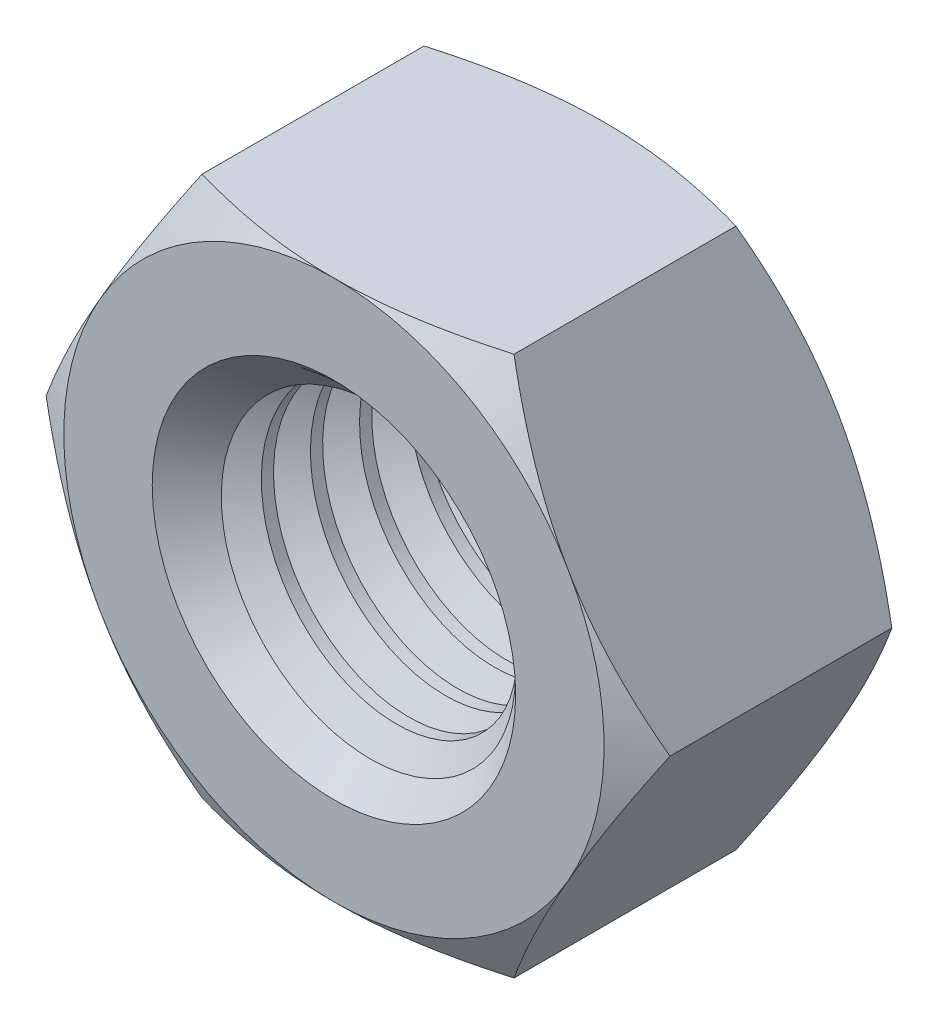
ISO-10303-21;
HEADER;
FILE_DESCRIPTION(('STEP AP214'),'2;1');
FILE_NAME('part.step','',(''),(''),'','','');
FILE_SCHEMA(('AUTOMOTIVE_DESIGN { 1 0 10303 214 1 1 1 1 }'));
ENDSEC;
DATA;
#1=APPLICATION_CONTEXT('core data for automotive mechanical design processes');
#2=APPLICATION_PROTOCOL_DEFINITION('international standard','automotive_design',2000,#1);
#3=PRODUCT_CONTEXT('',#1,'mechanical');
#4=PRODUCT('Part','Part','',(#3));
#5=PRODUCT_RELATED_PRODUCT_CATEGORY('part','',(#4));
#6=PRODUCT_DEFINITION_FORMATION('','',#4);
#7=PRODUCT_DEFINITION_CONTEXT('part definition',#1,'design');
#8=PRODUCT_DEFINITION('design','',#6,#7);
#9=PRODUCT_DEFINITION_SHAPE('','',#8);
#10=(LENGTH_UNIT() NAMED_UNIT(*) SI_UNIT(.MILLI.,.METRE.));
#11=(NAMED_UNIT(*) PLANE_ANGLE_UNIT() SI_UNIT($,.RADIAN.));
#12=(NAMED_UNIT(*) SI_UNIT($,.STERADIAN.) SOLID_ANGLE_UNIT());
#13=UNCERTAINTY_MEASURE_WITH_UNIT(LENGTH_MEASURE(1.E-05),#10,'distance_accuracy_value','');
#14=(GEOMETRIC_REPRESENTATION_CONTEXT(3) GLOBAL_UNCERTAINTY_ASSIGNED_CONTEXT((#13)) GLOBAL_UNIT_ASSIGNED_CONTEXT((#10,
#11,#12)) REPRESENTATION_CONTEXT('',''));
#15=CARTESIAN_POINT('',(0.,0.,0.));
#16=DIRECTION('',(0.,0.,1.));
#17=DIRECTION('',(1.,0.,0.));
#18=AXIS2_PLACEMENT_3D('',#15,#16,#17);
#19=CARTESIAN_POINT('',(0.,0.,5.5));
#20=DIRECTION('',(0.,0.,-1.));
#21=DIRECTION('',(-1.,0.,0.));
#22=AXIS2_PLACEMENT_3D('',#19,#20,#21);
#23=CYLINDRICAL_SURFACE('',#22,2.85);
#24=CARTESIAN_POINT('',(2.84992316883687,-0.020926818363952,0.374738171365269));
#25=CARTESIAN_POINT('',(2.85859134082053,1.15955000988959,0.437238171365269));
#26=CARTESIAN_POINT('',(2.02999749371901,2.00040250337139,0.499738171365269));
#27=CARTESIAN_POINT('',(1.20140364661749,2.8412549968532,0.562238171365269));
#28=CARTESIAN_POINT('',(0.0209268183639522,2.84992316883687,0.624738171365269));
#29=CARTESIAN_POINT('',(-1.15955000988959,2.85859134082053,0.687238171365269));
#30=CARTESIAN_POINT('',(-2.00040250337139,2.02999749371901,0.749738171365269));
#31=CARTESIAN_POINT('',(-2.8412549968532,1.20140364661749,0.812238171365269));
#32=CARTESIAN_POINT('',(-2.84992316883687,0.0209268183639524,0.874738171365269));
#33=CARTESIAN_POINT('',(-2.85859134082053,-1.15955000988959,0.937238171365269));
#34=CARTESIAN_POINT('',(-2.02999749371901,-2.00040250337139,0.999738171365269));
#35=CARTESIAN_POINT('',(-1.20140364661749,-2.8412549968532,1.06223817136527));
#36=CARTESIAN_POINT('',(-0.0209268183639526,-2.84992316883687,1.12473817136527));
#37=CARTESIAN_POINT('',(1.15955000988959,-2.85859134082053,1.18723817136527));
#38=CARTESIAN_POINT('',(2.00040250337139,-2.02999749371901,1.24973817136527));
#39=CARTESIAN_POINT('',(2.8412549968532,-1.20140364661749,1.31223817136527));
#40=CARTESIAN_POINT('',(2.84992316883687,-0.020926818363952,1.37473817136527));
#41=CARTESIAN_POINT('',(2.85859134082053,1.15955000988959,1.43723817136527));
#42=CARTESIAN_POINT('',(2.02999749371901,2.00040250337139,1.49973817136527));
#43=CARTESIAN_POINT('',(1.20140364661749,2.8412549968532,1.56223817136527));
#44=CARTESIAN_POINT('',(0.0209268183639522,2.84992316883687,1.62473817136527));
#45=CARTESIAN_POINT('',(-1.15955000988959,2.85859134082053,1.68723817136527));
#46=CARTESIAN_POINT('',(-2.00040250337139,2.02999749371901,1.74973817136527));
#47=CARTESIAN_POINT('',(-2.8412549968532,1.20140364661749,1.81223817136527));
#48=CARTESIAN_POINT('',(-2.84992316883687,0.0209268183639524,1.87473817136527));
#49=CARTESIAN_POINT('',(-2.85859134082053,-1.15955000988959,1.93723817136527));
#50=CARTESIAN_POINT('',(-2.02999749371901,-2.00040250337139,1.99973817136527));
#51=CARTESIAN_POINT('',(-1.20140364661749,-2.8412549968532,2.06223817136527));
#52=CARTESIAN_POINT('',(-0.0209268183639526,-2.84992316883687,2.12473817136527));
#53=CARTESIAN_POINT('',(1.15955000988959,-2.85859134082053,2.18723817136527));
#54=CARTESIAN_POINT('',(2.00040250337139,-2.02999749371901,2.24973817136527));
#55=CARTESIAN_POINT('',(2.8412549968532,-1.20140364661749,2.31223817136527));
#56=CARTESIAN_POINT('',(2.84992316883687,-0.020926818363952,2.37473817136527));
#57=CARTESIAN_POINT('',(2.85859134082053,1.15955000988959,2.43723817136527));
#58=CARTESIAN_POINT('',(2.02999749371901,2.00040250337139,2.49973817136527));
#59=CARTESIAN_POINT('',(1.20140364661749,2.8412549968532,2.56223817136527));
#60=CARTESIAN_POINT('',(0.0209268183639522,2.84992316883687,2.62473817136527));
#61=CARTESIAN_POINT('',(-1.15955000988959,2.85859134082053,2.68723817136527));
#62=CARTESIAN_POINT('',(-2.00040250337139,2.02999749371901,2.74973817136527));
#63=CARTESIAN_POINT('',(-2.8412549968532,1.20140364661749,2.81223817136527));
#64=CARTESIAN_POINT('',(-2.84992316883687,0.0209268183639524,2.87473817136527));
#65=CARTESIAN_POINT('',(-2.85859134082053,-1.15955000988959,2.93723817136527));
#66=CARTESIAN_POINT('',(-2.02999749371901,-2.00040250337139,2.99973817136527));
#67=CARTESIAN_POINT('',(-1.20140364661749,-2.8412549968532,3.06223817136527));
#68=CARTESIAN_POINT('',(-0.0209268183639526,-2.84992316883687,3.12473817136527));
#69=CARTESIAN_POINT('',(1.15955000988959,-2.85859134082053,3.18723817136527));
#70=CARTESIAN_POINT('',(2.00040250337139,-2.02999749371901,3.24973817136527));
#71=CARTESIAN_POINT('',(2.8412549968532,-1.20140364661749,3.31223817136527));
#72=CARTESIAN_POINT('',(2.84992316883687,-0.020926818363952,3.37473817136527));
#73=CARTESIAN_POINT('',(2.85859134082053,1.15955000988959,3.43723817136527));
#74=CARTESIAN_POINT('',(2.02999749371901,2.00040250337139,3.49973817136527));
#75=CARTESIAN_POINT('',(1.20140364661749,2.8412549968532,3.56223817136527));
#76=CARTESIAN_POINT('',(0.0209268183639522,2.84992316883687,3.62473817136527));
#77=CARTESIAN_POINT('',(-1.15955000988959,2.85859134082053,3.68723817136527));
#78=CARTESIAN_POINT('',(-2.00040250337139,2.02999749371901,3.74973817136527));
#79=CARTESIAN_POINT('',(-2.8412549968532,1.20140364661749,3.81223817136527));
#80=CARTESIAN_POINT('',(-2.84992316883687,0.0209268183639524,3.87473817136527));
#81=CARTESIAN_POINT('',(-2.85859134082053,-1.15955000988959,3.93723817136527));
#82=CARTESIAN_POINT('',(-2.02999749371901,-2.00040250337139,3.99973817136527));
#83=CARTESIAN_POINT('',(-1.20140364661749,-2.8412549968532,4.06223817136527));
#84=CARTESIAN_POINT('',(-0.0209268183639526,-2.84992316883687,4.12473817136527));
#85=CARTESIAN_POINT('',(1.15955000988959,-2.85859134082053,4.18723817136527));
#86=CARTESIAN_POINT('',(2.00040250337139,-2.02999749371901,4.24973817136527));
#87=CARTESIAN_POINT('',(2.8412549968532,-1.20140364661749,4.31223817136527));
#88=CARTESIAN_POINT('',(2.84992316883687,-0.020926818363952,4.37473817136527));
#89=CARTESIAN_POINT('',(2.85859134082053,1.15955000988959,4.43723817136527));
#90=CARTESIAN_POINT('',(2.02999749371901,2.00040250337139,4.49973817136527));
#91=CARTESIAN_POINT('',(1.20140364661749,2.8412549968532,4.56223817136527));
#92=CARTESIAN_POINT('',(0.0209268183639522,2.84992316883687,4.62473817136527));
#93=CARTESIAN_POINT('',(-1.15955000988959,2.85859134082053,4.68723817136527));
#94=CARTESIAN_POINT('',(-2.00040250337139,2.02999749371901,4.74973817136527));
#95=CARTESIAN_POINT('',(-2.8412549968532,1.20140364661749,4.81223817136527));
#96=CARTESIAN_POINT('',(-2.84992316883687,0.0209268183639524,4.87473817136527));
#97=CARTESIAN_POINT('',(-2.85859134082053,-1.15955000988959,4.93723817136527));
#98=CARTESIAN_POINT('',(-2.02999749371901,-2.00040250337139,4.99973817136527));
#99=CARTESIAN_POINT('',(-1.20140364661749,-2.8412549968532,5.06223817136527));
#100=CARTESIAN_POINT('',(-0.0209268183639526,-2.84992316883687,5.12473817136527));
#101=CARTESIAN_POINT('',(1.15955000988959,-2.85859134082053,5.18723817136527));
#102=CARTESIAN_POINT('',(2.00040250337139,-2.02999749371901,5.24973817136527));
#103=CARTESIAN_POINT('',(2.8412549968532,-1.20140364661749,5.31223817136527));
#104=CARTESIAN_POINT('',(2.84992316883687,-0.020926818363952,5.37473817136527));
#105=CARTESIAN_POINT('',(2.85859134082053,1.15955000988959,5.43723817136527));
#106=CARTESIAN_POINT('',(2.02999749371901,2.00040250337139,5.49973817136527));
#107=CARTESIAN_POINT('',(1.20140364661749,2.8412549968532,5.56223817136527));
#108=CARTESIAN_POINT('',(0.0209268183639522,2.84992316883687,5.62473817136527));
#109=CARTESIAN_POINT('',(-1.15955000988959,2.85859134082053,5.68723817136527));
#110=CARTESIAN_POINT('',(-2.00040250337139,2.02999749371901,5.74973817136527));
#111=CARTESIAN_POINT('',(-2.8412549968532,1.20140364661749,5.81223817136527));
#112=CARTESIAN_POINT('',(-2.84992316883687,0.0209268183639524,5.87473817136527));
#113=CARTESIAN_POINT('',(-2.85859134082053,-1.15955000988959,5.93723817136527));
#114=CARTESIAN_POINT('',(-2.02999749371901,-2.00040250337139,5.99973817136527));
#115=CARTESIAN_POINT('',(-1.20140364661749,-2.8412549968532,6.06223817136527));
#116=CARTESIAN_POINT('',(-0.0209268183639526,-2.84992316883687,6.12473817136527));
#117=CARTESIAN_POINT('',(1.15955000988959,-2.85859134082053,6.18723817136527));
#118=CARTESIAN_POINT('',(2.00040250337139,-2.02999749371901,6.24973817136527));
#119=CARTESIAN_POINT('',(2.8412549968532,-1.20140364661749,6.31223817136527));
#120=CARTESIAN_POINT('',(2.84992316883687,-0.020926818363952,6.37473817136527));
#121=CARTESIAN_POINT('',(2.85859134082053,1.15955000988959,6.43723817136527));
#122=CARTESIAN_POINT('',(2.02999749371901,2.00040250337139,6.49973817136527));
#123=CARTESIAN_POINT('',(1.20140364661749,2.8412549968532,6.56223817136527));
#124=CARTESIAN_POINT('',(0.0209268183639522,2.84992316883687,6.62473817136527));
#125=CARTESIAN_POINT('',(-1.15955000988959,2.85859134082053,6.68723817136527));
#126=CARTESIAN_POINT('',(-2.00040250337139,2.02999749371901,6.74973817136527));
#127=CARTESIAN_POINT('',(-2.8412549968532,1.20140364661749,6.81223817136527));
#128=CARTESIAN_POINT('',(-2.84992316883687,0.0209268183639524,6.87473817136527));
#129=CARTESIAN_POINT('',(-2.85859134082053,-1.15955000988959,6.93723817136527));
#130=CARTESIAN_POINT('',(-2.02999749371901,-2.00040250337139,6.99973817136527));
#131=CARTESIAN_POINT('',(-1.20140364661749,-2.8412549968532,7.06223817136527));
#132=CARTESIAN_POINT('',(-0.0209268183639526,-2.84992316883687,7.12473817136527));
#133=CARTESIAN_POINT('',(1.15955000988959,-2.85859134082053,7.18723817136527));
#134=CARTESIAN_POINT('',(2.00040250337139,-2.02999749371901,7.24973817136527));
#135=CARTESIAN_POINT('',(2.8412549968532,-1.20140364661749,7.31223817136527));
#136=CARTESIAN_POINT('',(2.84992316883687,-0.020926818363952,7.37473817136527));
#137=(BOUNDED_CURVE() B_SPLINE_CURVE(2,(#24,#25,#26,#27,#28,#29,#30,#31,#32,#33,#34,#35,#36,#37,
#38,#39,#40,#41,#42,#43,#44,#45,#46,#47,#48,#49,#50,#51,#52,#53,#54,#55,#56,#57,#58,#59,#60,#61,
#62,#63,#64,#65,#66,#67,#68,#69,#70,#71,#72,#73,#74,#75,#76,#77,#78,#79,#80,#81,#82,#83,#84,#85,
#86,#87,#88,#89,#90,#91,#92,#93,#94,#95,#96,#97,#98,#99,#100,#101,#102,#103,#104,#105,#106,#107,
#108,#109,#110,#111,#112,#113,#114,#115,#116,#117,#118,#119,#120,#121,#122,#123,#124,#125,#126,
#127,#128,#129,#130,#131,#132,#133,#134,#135,#136),.UNSPECIFIED.,.F.,
.F.) B_SPLINE_CURVE_WITH_KNOTS((3,2,2,2,2,2,2,2,2,2,2,2,2,2,2,2,2,2,2,2,2,2,2,2,2,2,2,2,2,2,2,2,
2,2,2,2,2,2,2,2,2,2,2,2,2,2,2,2,2,2,2,2,2,2,2,2,3),(0.,0.0178571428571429,0.0357142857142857,
0.0535714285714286,0.0714285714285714,0.0892857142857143,0.107142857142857,0.125,
0.142857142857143,0.160714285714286,0.178571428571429,0.196428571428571,0.214285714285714,
0.232142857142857,0.25,0.267857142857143,0.285714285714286,0.303571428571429,0.321428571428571,
0.339285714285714,0.357142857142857,0.375,0.392857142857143,0.410714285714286,0.428571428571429,
0.446428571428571,0.464285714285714,0.482142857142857,0.5,0.517857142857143,0.535714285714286,
0.553571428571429,0.571428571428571,0.589285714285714,0.607142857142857,0.625,0.642857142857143,
0.660714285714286,0.678571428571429,0.696428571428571,0.714285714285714,0.732142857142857,0.75,
0.767857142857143,0.785714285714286,0.803571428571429,0.821428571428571,0.839285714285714,
0.857142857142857,0.875,0.892857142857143,0.910714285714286,0.928571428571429,0.946428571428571,
0.964285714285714,0.982142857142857,1.),
.UNSPECIFIED.) CURVE() GEOMETRIC_REPRESENTATION_ITEM() RATIONAL_B_SPLINE_CURVE((1.,
0.923879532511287,1.,0.923879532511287,1.,0.923879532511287,1.,0.923879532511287,1.,
0.923879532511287,1.,0.923879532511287,1.,0.923879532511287,1.,0.923879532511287,1.,
0.923879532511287,1.,0.923879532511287,1.,0.923879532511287,1.,0.923879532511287,1.,
0.923879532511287,1.,0.923879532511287,1.,0.923879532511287,1.,0.923879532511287,1.,
0.923879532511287,1.,0.923879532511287,1.,0.923879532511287,1.,0.923879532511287,1.,
0.923879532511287,1.,0.923879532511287,1.,0.923879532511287,1.,0.923879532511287,1.,
0.923879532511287,1.,0.923879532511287,1.,0.923879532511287,1.,0.923879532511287,1.,
0.923879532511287,1.,0.923879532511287,1.,0.923879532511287,1.,0.923879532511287,1.,
0.923879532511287,1.,0.923879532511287,1.,0.923879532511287,1.,0.923879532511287,1.,
0.923879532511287,1.,0.923879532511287,1.,0.923879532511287,1.,0.923879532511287,1.,
0.923879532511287,1.,0.923879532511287,1.,0.923879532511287,1.,0.923879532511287,1.,
0.923879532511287,1.,0.923879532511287,1.,0.923879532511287,1.,0.923879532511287,1.,
0.923879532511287,1.,0.923879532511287,1.,0.923879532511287,1.,0.923879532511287,1.,
0.923879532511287,1.,0.923879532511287,1.,0.923879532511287,1.,0.923879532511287,1.)) REPRESENTATION_ITEM(''));
#138=CARTESIAN_POINT('',(-2.8104842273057,0.472946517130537,0.850000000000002));
#139=VERTEX_POINT('',#138);
#140=CARTESIAN_POINT('',(-0.440901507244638,2.81568923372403,4.64999999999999));
#141=VERTEX_POINT('',#140);
#142=EDGE_CURVE('E203',#139,#141,#137,.T.);
#143=ORIENTED_EDGE('',*,*,#142,.F.);
#144=CARTESIAN_POINT('',(0.,0.,0.850000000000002));
#145=DIRECTION('',(0.,0.,1.));
#146=DIRECTION('',(1.,0.,0.));
#147=AXIS2_PLACEMENT_3D('',#144,#145,#146);
#148=CIRCLE('',#147,2.85);
#149=CARTESIAN_POINT('',(0.440901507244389,2.81568923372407,0.850000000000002));
#150=VERTEX_POINT('',#149);
#151=EDGE_CURVE('E162',#139,#150,#148,.F.);
#152=ORIENTED_EDGE('',*,*,#151,.T.);
#153=CARTESIAN_POINT('',(2.84992316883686,0.0209268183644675,-0.374738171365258));
#154=CARTESIAN_POINT('',(2.84125499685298,1.201403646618,-0.312238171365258));
#155=CARTESIAN_POINT('',(2.00040250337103,2.02999749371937,-0.249738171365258));
#156=CARTESIAN_POINT('',(1.15955000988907,2.85859134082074,-0.187238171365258));
#157=CARTESIAN_POINT('',(-0.0209268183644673,2.84992316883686,-0.124738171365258));
#158=CARTESIAN_POINT('',(-1.201403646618,2.84125499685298,-0.0622381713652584));
#159=CARTESIAN_POINT('',(-2.02999749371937,2.00040250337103,0.000261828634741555));
#160=CARTESIAN_POINT('',(-2.85859134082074,1.15955000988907,0.0627618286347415));
#161=CARTESIAN_POINT('',(-2.84992316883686,-0.0209268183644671,0.125261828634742));
#162=CARTESIAN_POINT('',(-2.84125499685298,-1.201403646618,0.187761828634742));
#163=CARTESIAN_POINT('',(-2.00040250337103,-2.02999749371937,0.250261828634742));
#164=CARTESIAN_POINT('',(-1.15955000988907,-2.85859134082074,0.312761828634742));
#165=CARTESIAN_POINT('',(0.020926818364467,-2.84992316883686,0.375261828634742));
#166=CARTESIAN_POINT('',(1.201403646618,-2.84125499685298,0.437761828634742));
#167=CARTESIAN_POINT('',(2.02999749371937,-2.00040250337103,0.500261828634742));
#168=CARTESIAN_POINT('',(2.85859134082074,-1.15955000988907,0.562761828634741));
#169=CARTESIAN_POINT('',(2.84992316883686,0.0209268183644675,0.625261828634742));
#170=CARTESIAN_POINT('',(2.84125499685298,1.201403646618,0.687761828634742));
#171=CARTESIAN_POINT('',(2.00040250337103,2.02999749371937,0.750261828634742));
#172=CARTESIAN_POINT('',(1.15955000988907,2.85859134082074,0.812761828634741));
#173=CARTESIAN_POINT('',(-0.0209268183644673,2.84992316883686,0.875261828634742));
#174=CARTESIAN_POINT('',(-1.201403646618,2.84125499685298,0.937761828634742));
#175=CARTESIAN_POINT('',(-2.02999749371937,2.00040250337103,1.00026182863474));
#176=CARTESIAN_POINT('',(-2.85859134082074,1.15955000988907,1.06276182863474));
#177=CARTESIAN_POINT('',(-2.84992316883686,-0.0209268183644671,1.12526182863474));
#178=CARTESIAN_POINT('',(-2.84125499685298,-1.201403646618,1.18776182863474));
#179=CARTESIAN_POINT('',(-2.00040250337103,-2.02999749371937,1.25026182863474));
#180=CARTESIAN_POINT('',(-1.15955000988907,-2.85859134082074,1.31276182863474));
#181=CARTESIAN_POINT('',(0.020926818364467,-2.84992316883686,1.37526182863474));
#182=CARTESIAN_POINT('',(1.201403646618,-2.84125499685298,1.43776182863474));
#183=CARTESIAN_POINT('',(2.02999749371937,-2.00040250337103,1.50026182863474));
#184=CARTESIAN_POINT('',(2.85859134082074,-1.15955000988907,1.56276182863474));
#185=CARTESIAN_POINT('',(2.84992316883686,0.0209268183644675,1.62526182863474));
#186=CARTESIAN_POINT('',(2.84125499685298,1.201403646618,1.68776182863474));
#187=CARTESIAN_POINT('',(2.00040250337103,2.02999749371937,1.75026182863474));
#188=CARTESIAN_POINT('',(1.15955000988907,2.85859134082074,1.81276182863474));
#189=CARTESIAN_POINT('',(-0.0209268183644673,2.84992316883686,1.87526182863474));
#190=CARTESIAN_POINT('',(-1.201403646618,2.84125499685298,1.93776182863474));
#191=CARTESIAN_POINT('',(-2.02999749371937,2.00040250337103,2.00026182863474));
#192=CARTESIAN_POINT('',(-2.85859134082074,1.15955000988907,2.06276182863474));
#193=CARTESIAN_POINT('',(-2.84992316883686,-0.0209268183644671,2.12526182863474));
#194=CARTESIAN_POINT('',(-2.84125499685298,-1.201403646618,2.18776182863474));
#195=CARTESIAN_POINT('',(-2.00040250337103,-2.02999749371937,2.25026182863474));
#196=CARTESIAN_POINT('',(-1.15955000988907,-2.85859134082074,2.31276182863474));
#197=CARTESIAN_POINT('',(0.020926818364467,-2.84992316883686,2.37526182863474));
#198=CARTESIAN_POINT('',(1.201403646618,-2.84125499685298,2.43776182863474));
#199=CARTESIAN_POINT('',(2.02999749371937,-2.00040250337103,2.50026182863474));
#200=CARTESIAN_POINT('',(2.85859134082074,-1.15955000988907,2.56276182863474));
#201=CARTESIAN_POINT('',(2.84992316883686,0.0209268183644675,2.62526182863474));
#202=CARTESIAN_POINT('',(2.84125499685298,1.201403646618,2.68776182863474));
#203=CARTESIAN_POINT('',(2.00040250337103,2.02999749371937,2.75026182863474));
#204=CARTESIAN_POINT('',(1.15955000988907,2.85859134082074,2.81276182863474));
#205=CARTESIAN_POINT('',(-0.0209268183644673,2.84992316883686,2.87526182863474));
#206=CARTESIAN_POINT('',(-1.201403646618,2.84125499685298,2.93776182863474));
#207=CARTESIAN_POINT('',(-2.02999749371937,2.00040250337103,3.00026182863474));
#208=CARTESIAN_POINT('',(-2.85859134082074,1.15955000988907,3.06276182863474));
#209=CARTESIAN_POINT('',(-2.84992316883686,-0.0209268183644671,3.12526182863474));
#210=CARTESIAN_POINT('',(-2.84125499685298,-1.201403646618,3.18776182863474));
#211=CARTESIAN_POINT('',(-2.00040250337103,-2.02999749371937,3.25026182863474));
#212=CARTESIAN_POINT('',(-1.15955000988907,-2.85859134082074,3.31276182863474));
#213=CARTESIAN_POINT('',(0.020926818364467,-2.84992316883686,3.37526182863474));
#214=CARTESIAN_POINT('',(1.201403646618,-2.84125499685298,3.43776182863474));
#215=CARTESIAN_POINT('',(2.02999749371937,-2.00040250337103,3.50026182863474));
#216=CARTESIAN_POINT('',(2.85859134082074,-1.15955000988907,3.56276182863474));
#217=CARTESIAN_POINT('',(2.84992316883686,0.0209268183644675,3.62526182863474));
#218=CARTESIAN_POINT('',(2.84125499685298,1.201403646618,3.68776182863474));
#219=CARTESIAN_POINT('',(2.00040250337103,2.02999749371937,3.75026182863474));
#220=CARTESIAN_POINT('',(1.15955000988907,2.85859134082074,3.81276182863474));
#221=CARTESIAN_POINT('',(-0.0209268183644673,2.84992316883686,3.87526182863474));
#222=CARTESIAN_POINT('',(-1.201403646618,2.84125499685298,3.93776182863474));
#223=CARTESIAN_POINT('',(-2.02999749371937,2.00040250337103,4.00026182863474));
#224=CARTESIAN_POINT('',(-2.85859134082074,1.15955000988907,4.06276182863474));
#225=CARTESIAN_POINT('',(-2.84992316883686,-0.0209268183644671,4.12526182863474));
#226=CARTESIAN_POINT('',(-2.84125499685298,-1.201403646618,4.18776182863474));
#227=CARTESIAN_POINT('',(-2.00040250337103,-2.02999749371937,4.25026182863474));
#228=CARTESIAN_POINT('',(-1.15955000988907,-2.85859134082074,4.31276182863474));
#229=CARTESIAN_POINT('',(0.020926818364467,-2.84992316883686,4.37526182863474));
#230=CARTESIAN_POINT('',(1.201403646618,-2.84125499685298,4.43776182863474));
#231=CARTESIAN_POINT('',(2.02999749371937,-2.00040250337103,4.50026182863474));
#232=CARTESIAN_POINT('',(2.85859134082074,-1.15955000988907,4.56276182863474));
#233=CARTESIAN_POINT('',(2.84992316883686,0.0209268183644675,4.62526182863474));
#234=CARTESIAN_POINT('',(2.84125499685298,1.201403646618,4.68776182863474));
#235=CARTESIAN_POINT('',(2.00040250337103,2.02999749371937,4.75026182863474));
#236=CARTESIAN_POINT('',(1.15955000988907,2.85859134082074,4.81276182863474));
#237=CARTESIAN_POINT('',(-0.0209268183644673,2.84992316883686,4.87526182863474));
#238=CARTESIAN_POINT('',(-1.201403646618,2.84125499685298,4.93776182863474));
#239=CARTESIAN_POINT('',(-2.02999749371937,2.00040250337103,5.00026182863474));
#240=CARTESIAN_POINT('',(-2.85859134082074,1.15955000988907,5.06276182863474));
#241=CARTESIAN_POINT('',(-2.84992316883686,-0.0209268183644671,5.12526182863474));
#242=CARTESIAN_POINT('',(-2.84125499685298,-1.201403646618,5.18776182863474));
#243=CARTESIAN_POINT('',(-2.00040250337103,-2.02999749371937,5.25026182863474));
#244=CARTESIAN_POINT('',(-1.15955000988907,-2.85859134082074,5.31276182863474));
#245=CARTESIAN_POINT('',(0.020926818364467,-2.84992316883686,5.37526182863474));
#246=CARTESIAN_POINT('',(1.201403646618,-2.84125499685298,5.43776182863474));
#247=CARTESIAN_POINT('',(2.02999749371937,-2.00040250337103,5.50026182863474));
#248=CARTESIAN_POINT('',(2.85859134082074,-1.15955000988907,5.56276182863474));
#249=CARTESIAN_POINT('',(2.84992316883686,0.0209268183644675,5.62526182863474));
#250=CARTESIAN_POINT('',(2.84125499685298,1.201403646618,5.68776182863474));
#251=CARTESIAN_POINT('',(2.00040250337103,2.02999749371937,5.75026182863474));
#252=CARTESIAN_POINT('',(1.15955000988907,2.85859134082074,5.81276182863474));
#253=CARTESIAN_POINT('',(-0.0209268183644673,2.84992316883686,5.87526182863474));
#254=CARTESIAN_POINT('',(-1.201403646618,2.84125499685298,5.93776182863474));
#255=CARTESIAN_POINT('',(-2.02999749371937,2.00040250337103,6.00026182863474));
#256=CARTESIAN_POINT('',(-2.85859134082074,1.15955000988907,6.06276182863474));
#257=CARTESIAN_POINT('',(-2.84992316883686,-0.0209268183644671,6.12526182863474));
#258=CARTESIAN_POINT('',(-2.84125499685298,-1.201403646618,6.18776182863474));
#259=CARTESIAN_POINT('',(-2.00040250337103,-2.02999749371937,6.25026182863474));
#260=CARTESIAN_POINT('',(-1.15955000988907,-2.85859134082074,6.31276182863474));
#261=CARTESIAN_POINT('',(0.020926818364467,-2.84992316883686,6.37526182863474));
#262=CARTESIAN_POINT('',(1.201403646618,-2.84125499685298,6.43776182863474));
#263=CARTESIAN_POINT('',(2.02999749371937,-2.00040250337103,6.50026182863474));
#264=CARTESIAN_POINT('',(2.85859134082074,-1.15955000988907,6.56276182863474));
#265=CARTESIAN_POINT('',(2.84992316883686,0.0209268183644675,6.62526182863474));
#266=(BOUNDED_CURVE() B_SPLINE_CURVE(2,(#153,#154,#155,#156,#157,#158,#159,#160,#161,#162,#163,
#164,#165,#166,#167,#168,#169,#170,#171,#172,#173,#174,#175,#176,#177,#178,#179,#180,#181,#182,
#183,#184,#185,#186,#187,#188,#189,#190,#191,#192,#193,#194,#195,#196,#197,#198,#199,#200,#201,
#202,#203,#204,#205,#206,#207,#208,#209,#210,#211,#212,#213,#214,#215,#216,#217,#218,#219,#220,
#221,#222,#223,#224,#225,#226,#227,#228,#229,#230,#231,#232,#233,#234,#235,#236,#237,#238,#239,
#240,#241,#242,#243,#244,#245,#246,#247,#248,#249,#250,#251,#252,#253,#254,#255,#256,#257,#258,
#259,#260,#261,#262,#263,#264,#265),.UNSPECIFIED.,.F.,.F.) B_SPLINE_CURVE_WITH_KNOTS((3,2,2,2,2,
2,2,2,2,2,2,2,2,2,2,2,2,2,2,2,2,2,2,2,2,2,2,2,2,2,2,2,2,2,2,2,2,2,2,2,2,2,2,2,2,2,2,2,2,2,2,2,2,
2,2,2,3),(0.,0.0178571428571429,0.0357142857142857,0.0535714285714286,0.0714285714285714,
0.0892857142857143,0.107142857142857,0.125,0.142857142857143,0.160714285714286,
0.178571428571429,0.196428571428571,0.214285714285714,0.232142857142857,0.25,0.267857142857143,
0.285714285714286,0.303571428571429,0.321428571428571,0.339285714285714,0.357142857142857,0.375,
0.392857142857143,0.410714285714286,0.428571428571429,0.446428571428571,0.464285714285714,
0.482142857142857,0.5,0.517857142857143,0.535714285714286,0.553571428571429,0.571428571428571,
0.589285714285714,0.607142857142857,0.625,0.642857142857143,0.660714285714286,0.678571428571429,
0.696428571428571,0.714285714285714,0.732142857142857,0.75,0.767857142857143,0.785714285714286,
0.803571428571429,0.821428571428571,0.839285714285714,0.857142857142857,0.875,0.892857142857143,
0.910714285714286,0.928571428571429,0.946428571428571,0.964285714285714,0.982142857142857,1.),
.UNSPECIFIED.) CURVE() GEOMETRIC_REPRESENTATION_ITEM() RATIONAL_B_SPLINE_CURVE((1.,
0.923879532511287,1.,0.923879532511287,1.,0.923879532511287,1.,0.923879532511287,1.,
0.923879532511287,1.,0.923879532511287,1.,0.923879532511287,1.,0.923879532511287,1.,
0.923879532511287,1.,0.923879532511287,1.,0.923879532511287,1.,0.923879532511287,1.,
0.923879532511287,1.,0.923879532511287,1.,0.923879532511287,1.,0.923879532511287,1.,
0.923879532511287,1.,0.923879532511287,1.,0.923879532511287,1.,0.923879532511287,1.,
0.923879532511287,1.,0.923879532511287,1.,0.923879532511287,1.,0.923879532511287,1.,
0.923879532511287,1.,0.923879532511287,1.,0.923879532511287,1.,0.923879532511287,1.,
0.923879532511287,1.,0.923879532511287,1.,0.923879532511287,1.,0.923879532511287,1.,
0.923879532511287,1.,0.923879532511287,1.,0.923879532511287,1.,0.923879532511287,1.,
0.923879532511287,1.,0.923879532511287,1.,0.923879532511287,1.,0.923879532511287,1.,
0.923879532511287,1.,0.923879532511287,1.,0.923879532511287,1.,0.923879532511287,1.,
0.923879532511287,1.,0.923879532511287,1.,0.923879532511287,1.,0.923879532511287,1.,
0.923879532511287,1.,0.923879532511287,1.,0.923879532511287,1.,0.923879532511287,1.,
0.923879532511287,1.,0.923879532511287,1.,0.923879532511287,1.,0.923879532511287,1.)) REPRESENTATION_ITEM(''));
#267=CARTESIAN_POINT('',(2.81048422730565,0.472946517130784,4.64999999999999));
#268=VERTEX_POINT('',#267);
#269=EDGE_CURVE('E56',#268,#150,#266,.F.);
#270=ORIENTED_EDGE('',*,*,#269,.F.);
#271=CARTESIAN_POINT('',(0.,0.,4.64999999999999));
#272=DIRECTION('',(0.,0.,1.));
#273=DIRECTION('',(1.,0.,0.));
#274=AXIS2_PLACEMENT_3D('',#271,#272,#273);
#275=CIRCLE('',#274,2.85);
#276=EDGE_CURVE('E164',#268,#141,#275,.T.);
#277=ORIENTED_EDGE('',*,*,#276,.T.);
#278=EDGE_LOOP('',(#143,#152,#270,#277));
#279=FACE_BOUND('',#278,.T.);
#280=ADVANCED_FACE('F35',(#279),#23,.F.);
#281=CARTESIAN_POINT('',(3.17542648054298,-5.49999999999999,5.5));
#282=DIRECTION('',(-0.866025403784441,0.499999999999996,0.));
#283=DIRECTION('',(-0.499999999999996,-0.866025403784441,0.));
#284=AXIS2_PLACEMENT_3D('',#281,#282,#283);
#285=PLANE('',#284);
#286=CARTESIAN_POINT('',(6.35096843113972,0.0002,0.491306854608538));
#287=CARTESIAN_POINT('',(6.28116876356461,-0.120696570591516,0.451013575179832));
#288=CARTESIAN_POINT('',(6.21110884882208,-0.242043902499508,0.412548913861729));
#289=CARTESIAN_POINT('',(6.07042005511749,-0.485724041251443,0.339780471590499));
#290=CARTESIAN_POINT('',(5.99979094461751,-0.608057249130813,0.305478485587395));
#291=CARTESIAN_POINT('',(5.78677273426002,-0.977015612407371,0.209489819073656));
#292=CARTESIAN_POINT('',(5.64354277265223,-1.22509718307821,0.154892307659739));
#293=CARTESIAN_POINT('',(5.42920173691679,-1.59634674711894,0.0908698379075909));
#294=CARTESIAN_POINT('',(5.35873110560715,-1.71840546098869,0.0726315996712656));
#295=CARTESIAN_POINT('',(5.21747141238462,-1.96307442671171,0.0420485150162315));
#296=CARTESIAN_POINT('',(5.14668237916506,-2.08568462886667,0.0297031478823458));
#297=CARTESIAN_POINT('',(5.00498135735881,-2.33111799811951,0.0112204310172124));
#298=CARTESIAN_POINT('',(4.93406960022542,-2.45394076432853,0.00507603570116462));
#299=CARTESIAN_POINT('',(4.7921844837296,-2.69969299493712,-0.000879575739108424));
#300=CARTESIAN_POINT('',(4.72121112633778,-2.82262245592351,-0.000690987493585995));
#301=CARTESIAN_POINT('',(4.52676438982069,-3.15941408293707,0.00853091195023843));
#302=CARTESIAN_POINT('',(4.4033546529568,-3.37316601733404,0.0240139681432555));
#303=CARTESIAN_POINT('',(4.15735486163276,-3.79925015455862,0.0731121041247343));
#304=CARTESIAN_POINT('',(4.03476567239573,-4.01158085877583,0.106743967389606));
#305=CARTESIAN_POINT('',(3.78827075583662,-4.43852257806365,0.190814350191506));
#306=CARTESIAN_POINT('',(3.664396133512,-4.65307971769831,0.241609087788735));
#307=CARTESIAN_POINT('',(3.41849427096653,-5.0789942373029,0.3568928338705));
#308=CARTESIAN_POINT('',(3.29646388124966,-5.29035707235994,0.421354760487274));
#309=CARTESIAN_POINT('',(3.17531101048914,-5.50019999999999,0.491306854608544));
#310=B_SPLINE_CURVE_WITH_KNOTS('',3,(#286,#287,#288,#289,#290,#291,#292,#293,#294,#295,#296,
#297,#298,#299,#300,#301,#302,#303,#304,#305,#306,#307,#308,#309),.UNSPECIFIED.,.F.,.F.,(4,2,2,
2,2,2,2,2,2,2,2,4),(0.,0.435859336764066,0.871905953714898,1.74581116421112,2.17206086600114,
2.59827289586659,3.02400011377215,3.44971418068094,4.19085033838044,4.93267305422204,
5.69094899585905,6.44773620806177),.UNSPECIFIED.);
#311=CARTESIAN_POINT('',(6.35085296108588,0.,0.491240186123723));
#312=VERTEX_POINT('',#311);
#313=CARTESIAN_POINT('',(4.76313972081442,-2.74999999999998,0.));
#314=VERTEX_POINT('',#313);
#315=EDGE_CURVE('E346',#312,#314,#310,.T.);
#316=ORIENTED_EDGE('',*,*,#315,.F.);
#317=DIRECTION('',(0.,0.,-1.));
#318=VECTOR('',#317,1.);
#319=CARTESIAN_POINT('',(6.35085296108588,0.,5.5));
#320=LINE('',#319,#318);
#321=CARTESIAN_POINT('',(6.35085296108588,0.,5.00875981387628));
#322=VERTEX_POINT('',#321);
#323=EDGE_CURVE('E385',#322,#312,#320,.T.);
#324=ORIENTED_EDGE('',*,*,#323,.F.);
#325=CARTESIAN_POINT('',(3.17531101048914,-5.50019999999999,5.00869314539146));
#326=CARTESIAN_POINT('',(3.24511067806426,-5.37930342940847,5.04898642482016));
#327=CARTESIAN_POINT('',(3.31517059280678,-5.25795609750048,5.08745108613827));
#328=CARTESIAN_POINT('',(3.45585938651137,-5.01427595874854,5.1602195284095));
#329=CARTESIAN_POINT('',(3.52648849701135,-4.89194275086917,5.1945215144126));
#330=CARTESIAN_POINT('',(3.73950670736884,-4.52298438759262,5.29051018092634));
#331=CARTESIAN_POINT('',(3.88273666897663,-4.27490281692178,5.34510769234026));
#332=CARTESIAN_POINT('',(4.09707770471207,-3.90365325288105,5.40913016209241));
#333=CARTESIAN_POINT('',(4.16754833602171,-3.7815945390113,5.42736840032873));
#334=CARTESIAN_POINT('',(4.30880802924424,-3.53692557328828,5.45795148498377));
#335=CARTESIAN_POINT('',(4.37959706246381,-3.41431537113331,5.47029685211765));
#336=CARTESIAN_POINT('',(4.52129808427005,-3.16888200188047,5.48877956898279));
#337=CARTESIAN_POINT('',(4.59220984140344,-3.04605923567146,5.49492396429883));
#338=CARTESIAN_POINT('',(4.73409495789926,-2.80030700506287,5.50087957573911));
#339=CARTESIAN_POINT('',(4.80506831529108,-2.67737754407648,5.50069098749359));
#340=CARTESIAN_POINT('',(4.99951505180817,-2.34058591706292,5.49146908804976));
#341=CARTESIAN_POINT('',(5.12292478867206,-2.12683398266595,5.47598603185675));
#342=CARTESIAN_POINT('',(5.3689245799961,-1.70074984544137,5.42688789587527));
#343=CARTESIAN_POINT('',(5.49151376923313,-1.48841914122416,5.3932560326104));
#344=CARTESIAN_POINT('',(5.73800868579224,-1.06147742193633,5.3091856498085));
#345=CARTESIAN_POINT('',(5.86188330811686,-0.846920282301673,5.25839091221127));
#346=CARTESIAN_POINT('',(6.10778517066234,-0.421005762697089,5.1431071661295));
#347=CARTESIAN_POINT('',(6.2298155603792,-0.209642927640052,5.07864523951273));
#348=CARTESIAN_POINT('',(6.35096843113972,0.000199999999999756,5.00869314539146));
#349=B_SPLINE_CURVE_WITH_KNOTS('',3,(#325,#326,#327,#328,#329,#330,#331,#332,#333,#334,#335,
#336,#337,#338,#339,#340,#341,#342,#343,#344,#345,#346,#347,#348),.UNSPECIFIED.,.F.,.F.,(4,2,2,
2,2,2,2,2,2,2,2,4),(0.,0.435859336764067,0.8719059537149,1.74581116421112,2.17206086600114,
2.59827289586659,3.02400011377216,3.44971418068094,4.19085033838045,4.93267305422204,
5.69094899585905,6.44773620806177),.UNSPECIFIED.);
#350=CARTESIAN_POINT('',(4.76313972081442,-2.74999999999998,5.5));
#351=VERTEX_POINT('',#350);
#352=EDGE_CURVE('E283',#351,#322,#349,.T.);
#353=ORIENTED_EDGE('',*,*,#352,.F.);
#354=CARTESIAN_POINT('',(3.17542648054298,-5.49999999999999,5.00875981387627));
#355=VERTEX_POINT('',#354);
#356=EDGE_CURVE('E418',#355,#351,#349,.T.);
#357=ORIENTED_EDGE('',*,*,#356,.F.);
#358=DIRECTION('',(0.,0.,-1.));
#359=VECTOR('',#358,1.);
#360=CARTESIAN_POINT('',(3.17542648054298,-5.49999999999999,5.5));
#361=LINE('',#360,#359);
#362=CARTESIAN_POINT('',(3.17542648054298,-5.49999999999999,0.491240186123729));
#363=VERTEX_POINT('',#362);
#364=EDGE_CURVE('E380',#355,#363,#361,.T.);
#365=ORIENTED_EDGE('',*,*,#364,.T.);
#366=EDGE_CURVE('E341',#314,#363,#310,.T.);
#367=ORIENTED_EDGE('',*,*,#366,.F.);
#368=EDGE_LOOP('',(#316,#324,#353,#357,#365,#367));
#369=FACE_BOUND('',#368,.T.);
#370=ADVANCED_FACE('F215',(#369),#285,.F.);
#371=CARTESIAN_POINT('',(6.35085296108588,0.,5.5));
#372=DIRECTION('',(-0.866025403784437,-0.500000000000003,0.));
#373=DIRECTION('',(0.500000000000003,-0.866025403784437,0.));
#374=AXIS2_PLACEMENT_3D('',#371,#372,#373);
#375=PLANE('',#374);
#376=CARTESIAN_POINT('',(3.17531101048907,5.50020000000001,0.491306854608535));
#377=CARTESIAN_POINT('',(3.24511067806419,5.37930342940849,0.451013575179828));
#378=CARTESIAN_POINT('',(3.31517059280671,5.2579560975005,0.412548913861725));
#379=CARTESIAN_POINT('',(3.4558593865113,5.01427595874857,0.339780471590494));
#380=CARTESIAN_POINT('',(3.52648849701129,4.8919427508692,0.30547848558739));
#381=CARTESIAN_POINT('',(3.73950670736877,4.52298438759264,0.20948981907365));
#382=CARTESIAN_POINT('',(3.88273666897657,4.2749028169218,0.15489230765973));
#383=CARTESIAN_POINT('',(4.09707770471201,3.90365325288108,0.0908698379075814));
#384=CARTESIAN_POINT('',(4.16754833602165,3.78159453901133,0.072631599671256));
#385=CARTESIAN_POINT('',(4.30880802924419,3.53692557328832,0.0420485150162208));
#386=CARTESIAN_POINT('',(4.37959706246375,3.41431537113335,0.029703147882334));
#387=CARTESIAN_POINT('',(4.52129808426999,3.16888200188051,0.0112204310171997));
#388=CARTESIAN_POINT('',(4.59220984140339,3.04605923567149,0.00507603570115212));
#389=CARTESIAN_POINT('',(4.73409495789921,2.80030700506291,-0.000879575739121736));
#390=CARTESIAN_POINT('',(4.80506831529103,2.67737754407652,-0.0006909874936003));
#391=CARTESIAN_POINT('',(4.99951505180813,2.34058591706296,0.00853091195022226));
#392=CARTESIAN_POINT('',(5.12292478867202,2.12683398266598,0.0240139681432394));
#393=CARTESIAN_POINT('',(5.36892457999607,1.7007498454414,0.0731121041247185));
#394=CARTESIAN_POINT('',(5.4915137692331,1.48841914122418,0.10674396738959));
#395=CARTESIAN_POINT('',(5.73800868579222,1.06147742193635,0.190814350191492));
#396=CARTESIAN_POINT('',(5.86188330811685,0.846920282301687,0.241609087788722));
#397=CARTESIAN_POINT('',(6.10778517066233,0.421005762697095,0.356892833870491));
#398=CARTESIAN_POINT('',(6.22981556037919,0.209642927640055,0.421354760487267));
#399=CARTESIAN_POINT('',(6.35096843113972,-0.000199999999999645,0.491306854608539));
#400=B_SPLINE_CURVE_WITH_KNOTS('',3,(#376,#377,#378,#379,#380,#381,#382,#383,#384,#385,#386,
#387,#388,#389,#390,#391,#392,#393,#394,#395,#396,#397,#398,#399),.UNSPECIFIED.,.F.,.F.,(4,2,2,
2,2,2,2,2,2,2,2,4),(0.,0.435859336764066,0.871905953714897,1.74581116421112,2.17206086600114,
2.59827289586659,3.02400011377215,3.44971418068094,4.19085033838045,4.93267305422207,
5.69094899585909,6.44773620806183),.UNSPECIFIED.);
#401=CARTESIAN_POINT('',(3.17542648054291,5.50000000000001,0.491240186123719));
#402=VERTEX_POINT('',#401);
#403=CARTESIAN_POINT('',(4.7631397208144,2.75000000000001,0.));
#404=VERTEX_POINT('',#403);
#405=EDGE_CURVE('E334',#402,#404,#400,.T.);
#406=ORIENTED_EDGE('',*,*,#405,.F.);
#407=DIRECTION('',(0.,0.,-1.));
#408=VECTOR('',#407,1.);
#409=CARTESIAN_POINT('',(3.17542648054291,5.50000000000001,5.5));
#410=LINE('',#409,#408);
#411=CARTESIAN_POINT('',(3.17542648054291,5.50000000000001,5.00875981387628));
#412=VERTEX_POINT('',#411);
#413=EDGE_CURVE('E377',#412,#402,#410,.T.);
#414=ORIENTED_EDGE('',*,*,#413,.F.);
#415=CARTESIAN_POINT('',(6.35096843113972,-0.000200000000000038,5.00869314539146));
#416=CARTESIAN_POINT('',(6.2811687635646,0.120696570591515,5.04898642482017));
#417=CARTESIAN_POINT('',(6.21110884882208,0.242043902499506,5.08745108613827));
#418=CARTESIAN_POINT('',(6.07042005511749,0.48572404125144,5.1602195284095));
#419=CARTESIAN_POINT('',(5.9997909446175,0.60805724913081,5.19452151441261));
#420=CARTESIAN_POINT('',(5.78677273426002,0.977015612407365,5.29051018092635));
#421=CARTESIAN_POINT('',(5.64354277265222,1.2250971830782,5.34510769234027));
#422=CARTESIAN_POINT('',(5.42920173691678,1.59634674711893,5.40913016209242));
#423=CARTESIAN_POINT('',(5.35873110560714,1.71840546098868,5.42736840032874));
#424=CARTESIAN_POINT('',(5.21747141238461,1.9630744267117,5.45795148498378));
#425=CARTESIAN_POINT('',(5.14668237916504,2.08568462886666,5.47029685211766));
#426=CARTESIAN_POINT('',(5.0049813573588,2.3311179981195,5.4887795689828));
#427=CARTESIAN_POINT('',(4.93406960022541,2.45394076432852,5.49492396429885));
#428=CARTESIAN_POINT('',(4.79218448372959,2.6996929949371,5.50087957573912));
#429=CARTESIAN_POINT('',(4.72121112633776,2.82262245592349,5.5006909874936));
#430=CARTESIAN_POINT('',(4.52676438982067,3.15941408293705,5.49146908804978));
#431=CARTESIAN_POINT('',(4.40335465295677,3.37316601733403,5.47598603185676));
#432=CARTESIAN_POINT('',(4.15735486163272,3.79925015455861,5.42688789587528));
#433=CARTESIAN_POINT('',(4.03476567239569,4.01158085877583,5.39325603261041));
#434=CARTESIAN_POINT('',(3.78827075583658,4.43852257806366,5.30918564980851));
#435=CARTESIAN_POINT('',(3.66439613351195,4.65307971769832,5.25839091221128));
#436=CARTESIAN_POINT('',(3.41849427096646,5.07899423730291,5.14310716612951));
#437=CARTESIAN_POINT('',(3.2964638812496,5.29035707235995,5.07864523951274));
#438=CARTESIAN_POINT('',(3.17531101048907,5.50020000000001,5.00869314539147));
#439=B_SPLINE_CURVE_WITH_KNOTS('',3,(#415,#416,#417,#418,#419,#420,#421,#422,#423,#424,#425,
#426,#427,#428,#429,#430,#431,#432,#433,#434,#435,#436,#437,#438),.UNSPECIFIED.,.F.,.F.,(4,2,2,
2,2,2,2,2,2,2,2,4),(0.,0.435859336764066,0.871905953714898,1.74581116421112,2.17206086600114,
2.59827289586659,3.02400011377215,3.44971418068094,4.19085033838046,4.93267305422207,
5.69094899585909,6.44773620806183),.UNSPECIFIED.);
#440=CARTESIAN_POINT('',(4.7631397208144,2.75000000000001,5.5));
#441=VERTEX_POINT('',#440);
#442=EDGE_CURVE('E307',#441,#412,#439,.T.);
#443=ORIENTED_EDGE('',*,*,#442,.F.);
#444=EDGE_CURVE('E425',#322,#441,#439,.T.);
#445=ORIENTED_EDGE('',*,*,#444,.F.);
#446=ORIENTED_EDGE('',*,*,#323,.T.);
#447=EDGE_CURVE('E328',#404,#312,#400,.T.);
#448=ORIENTED_EDGE('',*,*,#447,.F.);
#449=EDGE_LOOP('',(#406,#414,#443,#445,#446,#448));
#450=FACE_BOUND('',#449,.T.);
#451=ADVANCED_FACE('F316',(#450),#375,.F.);
#452=CARTESIAN_POINT('',(3.17542648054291,5.50000000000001,5.5));
#453=DIRECTION('',(0.,-1.,0.));
#454=DIRECTION('',(1.,0.,0.));
#455=AXIS2_PLACEMENT_3D('',#452,#453,#454);
#456=PLANE('',#455);
#457=CARTESIAN_POINT('',(-8.70912086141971,5.49999999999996,2.77152753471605));
#458=CARTESIAN_POINT('',(-8.46730871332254,5.49999999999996,2.65351622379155));
#459=CARTESIAN_POINT('',(-8.22496032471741,5.49999999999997,2.53658577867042));
#460=CARTESIAN_POINT('',(-7.73890650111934,5.49999999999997,2.3054912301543));
#461=CARTESIAN_POINT('',(-7.49520087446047,5.49999999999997,2.19132753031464));
#462=CARTESIAN_POINT('',(-7.00497661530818,5.49999999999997,1.96583465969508));
#463=CARTESIAN_POINT('',(-6.75844998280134,5.49999999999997,1.85452282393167));
#464=CARTESIAN_POINT('',(-6.26349741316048,5.49999999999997,1.63622154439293));
#465=CARTESIAN_POINT('',(-6.01507156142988,5.49999999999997,1.52923190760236));
#466=CARTESIAN_POINT('',(-5.50730389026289,5.49999999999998,1.31710852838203));
#467=CARTESIAN_POINT('',(-5.24788149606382,5.49999999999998,1.21216665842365));
#468=CARTESIAN_POINT('',(-4.72606849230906,5.49999999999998,1.00979941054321));
#469=CARTESIAN_POINT('',(-4.4636775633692,5.49999999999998,0.912374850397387));
#470=CARTESIAN_POINT('',(-3.93594652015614,5.49999999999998,0.727468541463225));
#471=CARTESIAN_POINT('',(-3.67061300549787,5.49999999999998,0.639968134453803));
#472=CARTESIAN_POINT('',(-3.13614116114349,5.49999999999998,0.477599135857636));
#473=CARTESIAN_POINT('',(-2.86700400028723,5.49999999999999,0.402726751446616));
#474=CARTESIAN_POINT('',(-2.3262867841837,5.49999999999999,0.269483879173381));
#475=CARTESIAN_POINT('',(-2.05473029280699,5.49999999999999,0.211019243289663));
#476=CARTESIAN_POINT('',(-1.50802172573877,5.49999999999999,0.113785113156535));
#477=CARTESIAN_POINT('',(-1.23287005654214,5.49999999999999,0.0750134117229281));
#478=CARTESIAN_POINT('',(-0.820372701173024,5.49999999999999,0.0341894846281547));
#479=CARTESIAN_POINT('',(-0.683851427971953,5.49999999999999,0.023486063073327));
#480=CARTESIAN_POINT('',(-0.410482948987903,5.49999999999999,0.00786455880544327));
#481=CARTESIAN_POINT('',(-0.273635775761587,5.5,0.00294592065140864));
#482=CARTESIAN_POINT('',(0.000154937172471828,5.5,-0.000983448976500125));
#483=CARTESIAN_POINT('',(0.137098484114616,5.5,6.32434348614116E-06));
#484=CARTESIAN_POINT('',(0.410806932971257,5.5,0.00786701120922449));
#485=CARTESIAN_POINT('',(0.547571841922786,5.5,0.0147376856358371));
#486=CARTESIAN_POINT('',(0.870935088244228,5.5,0.0377859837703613));
#487=CARTESIAN_POINT('',(1.0573598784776,5.5,0.0564573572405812));
#488=CARTESIAN_POINT('',(1.42893296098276,5.5,0.103748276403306));
#489=CARTESIAN_POINT('',(1.61408109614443,5.5,0.132369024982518));
#490=CARTESIAN_POINT('',(2.16733341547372,5.50000000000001,0.231646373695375));
#491=CARTESIAN_POINT('',(2.53307076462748,5.50000000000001,0.315703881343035));
#492=CARTESIAN_POINT('',(3.08030521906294,5.50000000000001,0.462857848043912));
#493=CARTESIAN_POINT('',(3.26460005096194,5.50000000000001,0.516160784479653));
#494=CARTESIAN_POINT('',(3.63140356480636,5.50000000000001,0.628648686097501));
#495=CARTESIAN_POINT('',(3.81391223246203,5.50000000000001,0.687833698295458));
#496=CARTESIAN_POINT('',(4.17719656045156,5.50000000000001,0.811107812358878));
#497=CARTESIAN_POINT('',(4.35797266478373,5.50000000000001,0.875195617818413));
#498=CARTESIAN_POINT('',(4.71800225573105,5.50000000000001,1.00748692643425));
#499=CARTESIAN_POINT('',(4.89725578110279,5.50000000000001,1.07569032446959));
#500=CARTESIAN_POINT('',(5.39129464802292,5.50000000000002,1.26912632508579));
#501=CARTESIAN_POINT('',(5.70465251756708,5.50000000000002,1.39800176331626));
#502=CARTESIAN_POINT('',(6.3280198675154,5.50000000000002,1.66364060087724));
#503=CARTESIAN_POINT('',(6.6380289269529,5.50000000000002,1.8004049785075));
#504=CARTESIAN_POINT('',(7.25549375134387,5.50000000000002,2.07990316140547));
#505=CARTESIAN_POINT('',(7.56294837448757,5.50000000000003,2.22263948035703));
#506=CARTESIAN_POINT('',(8.17570313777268,5.50000000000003,2.51261224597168));
#507=CARTESIAN_POINT('',(8.48100337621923,5.50000000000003,2.65984848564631));
#508=CARTESIAN_POINT('',(9.0904164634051,5.50000000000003,2.958074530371));
#509=CARTESIAN_POINT('',(9.39452634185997,5.50000000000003,3.10907039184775));
#510=CARTESIAN_POINT('',(10.0013586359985,5.50000000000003,3.41382712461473));
#511=CARTESIAN_POINT('',(10.3040810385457,5.50000000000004,3.56758802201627));
#512=CARTESIAN_POINT('',(10.9083179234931,5.50000000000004,3.87728141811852));
#513=CARTESIAN_POINT('',(11.2098326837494,5.50000000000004,4.03321337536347));
#514=CARTESIAN_POINT('',(11.8119286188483,5.50000000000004,4.34687042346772));
#515=CARTESIAN_POINT('',(12.1125097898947,5.50000000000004,4.50459552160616));
#516=CARTESIAN_POINT('',(12.9468791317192,5.50000000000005,4.94501366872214));
#517=CARTESIAN_POINT('',(13.4798306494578,5.50000000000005,5.22929136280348));
#518=CARTESIAN_POINT('',(14.5439734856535,5.50000000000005,5.80120198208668));
#519=CARTESIAN_POINT('',(15.0751646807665,5.50000000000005,6.08883513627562));
#520=CARTESIAN_POINT('',(16.1343032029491,5.50000000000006,6.66555451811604));
#521=CARTESIAN_POINT('',(16.6622553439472,5.50000000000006,6.95463191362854));
#522=CARTESIAN_POINT('',(17.7170604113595,5.50000000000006,7.53467948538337));
#523=CARTESIAN_POINT('',(18.243913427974,5.50000000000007,7.8256494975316));
#524=CARTESIAN_POINT('',(18.7703841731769,5.50000000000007,8.11730454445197));
#525=B_SPLINE_CURVE_WITH_KNOTS('',3,(#457,#458,#459,#460,#461,#462,#463,#464,#465,#466,#467,
#468,#469,#470,#471,#472,#473,#474,#475,#476,#477,#478,#479,#480,#481,#482,#483,#484,#485,#486,
#487,#488,#489,#490,#491,#492,#493,#494,#495,#496,#497,#498,#499,#500,#501,#502,#503,#504,#505,
#506,#507,#508,#509,#510,#511,#512,#513,#514,#515,#516,#517,#518,#519,#520,#521,#522,#523,#524),
.UNSPECIFIED.,.F.,.F.,(4,2,2,2,2,2,2,2,2,2,2,2,2,2,2,2,2,2,2,2,2,2,2,2,2,2,2,2,2,2,2,2,2,4),(0.,
0.807225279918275,1.61456760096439,2.42600908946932,3.23741430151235,4.07685685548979,
4.91639060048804,5.75431883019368,6.59199493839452,7.42476129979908,8.25743430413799,
8.66815104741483,9.0788283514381,9.48954074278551,9.90023643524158,10.4619953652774,
11.0238222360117,12.1479995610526,12.7234914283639,13.2989878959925,13.8743327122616,
14.4496628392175,15.4659718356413,16.4824071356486,17.4992746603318,18.5160954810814,
19.5346764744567,20.5532670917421,21.5716080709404,22.5899531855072,24.4020217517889,
26.2142147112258,28.0199490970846,29.8255289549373),.UNSPECIFIED.);
#526=CARTESIAN_POINT('',(-3.17542648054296,5.49999999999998,0.491240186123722));
#527=VERTEX_POINT('',#526);
#528=CARTESIAN_POINT('',(0.,5.5,0.));
#529=VERTEX_POINT('',#528);
#530=EDGE_CURVE('E64',#527,#529,#525,.T.);
#531=ORIENTED_EDGE('',*,*,#530,.F.);
#532=DIRECTION('',(0.,0.,-1.));
#533=VECTOR('',#532,1.);
#534=CARTESIAN_POINT('',(-3.17542648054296,5.49999999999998,5.5));
#535=LINE('',#534,#533);
#536=CARTESIAN_POINT('',(-3.17542648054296,5.49999999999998,5.00875981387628));
#537=VERTEX_POINT('',#536);
#538=EDGE_CURVE('E374',#537,#527,#535,.T.);
#539=ORIENTED_EDGE('',*,*,#538,.F.);
#540=CARTESIAN_POINT('',(-8.70912086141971,5.49999999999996,2.72847246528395));
#541=CARTESIAN_POINT('',(-8.46730871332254,5.49999999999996,2.84648377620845));
#542=CARTESIAN_POINT('',(-8.22496032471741,5.49999999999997,2.96341422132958));
#543=CARTESIAN_POINT('',(-7.73890650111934,5.49999999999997,3.1945087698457));
#544=CARTESIAN_POINT('',(-7.49520087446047,5.49999999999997,3.30867246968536));
#545=CARTESIAN_POINT('',(-7.00497661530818,5.49999999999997,3.53416534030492));
#546=CARTESIAN_POINT('',(-6.75844998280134,5.49999999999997,3.64547717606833));
#547=CARTESIAN_POINT('',(-6.26349741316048,5.49999999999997,3.86377845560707));
#548=CARTESIAN_POINT('',(-6.01507156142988,5.49999999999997,3.97076809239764));
#549=CARTESIAN_POINT('',(-5.50730389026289,5.49999999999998,4.18289147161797));
#550=CARTESIAN_POINT('',(-5.24788149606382,5.49999999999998,4.28783334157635));
#551=CARTESIAN_POINT('',(-4.72606849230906,5.49999999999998,4.49020058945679));
#552=CARTESIAN_POINT('',(-4.4636775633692,5.49999999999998,4.58762514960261));
#553=CARTESIAN_POINT('',(-3.93594652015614,5.49999999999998,4.77253145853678));
#554=CARTESIAN_POINT('',(-3.67061300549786,5.49999999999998,4.8600318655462));
#555=CARTESIAN_POINT('',(-3.13614116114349,5.49999999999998,5.02240086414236));
#556=CARTESIAN_POINT('',(-2.86700400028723,5.49999999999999,5.09727324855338));
#557=CARTESIAN_POINT('',(-2.3262867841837,5.49999999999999,5.23051612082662));
#558=CARTESIAN_POINT('',(-2.05473029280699,5.49999999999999,5.28898075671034));
#559=CARTESIAN_POINT('',(-1.50802172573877,5.49999999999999,5.38621488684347));
#560=CARTESIAN_POINT('',(-1.23287005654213,5.49999999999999,5.42498658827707));
#561=CARTESIAN_POINT('',(-0.820372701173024,5.49999999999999,5.46581051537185));
#562=CARTESIAN_POINT('',(-0.683851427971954,5.49999999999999,5.47651393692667));
#563=CARTESIAN_POINT('',(-0.410482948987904,5.49999999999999,5.49213544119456));
#564=CARTESIAN_POINT('',(-0.273635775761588,5.5,5.49705407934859));
#565=CARTESIAN_POINT('',(0.000154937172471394,5.5,5.5009834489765));
#566=CARTESIAN_POINT('',(0.137098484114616,5.5,5.49999367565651));
#567=CARTESIAN_POINT('',(0.410806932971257,5.5,5.49213298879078));
#568=CARTESIAN_POINT('',(0.547571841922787,5.5,5.48526231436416));
#569=CARTESIAN_POINT('',(0.87093508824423,5.5,5.46221401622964));
#570=CARTESIAN_POINT('',(1.0573598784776,5.5,5.44354264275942));
#571=CARTESIAN_POINT('',(1.42893296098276,5.5,5.39625172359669));
#572=CARTESIAN_POINT('',(1.61408109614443,5.5,5.36763097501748));
#573=CARTESIAN_POINT('',(2.16733341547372,5.50000000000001,5.26835362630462));
#574=CARTESIAN_POINT('',(2.53307076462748,5.50000000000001,5.18429611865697));
#575=CARTESIAN_POINT('',(3.08030521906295,5.50000000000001,5.03714215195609));
#576=CARTESIAN_POINT('',(3.26460005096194,5.50000000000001,4.98383921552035));
#577=CARTESIAN_POINT('',(3.63140356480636,5.50000000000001,4.8713513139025));
#578=CARTESIAN_POINT('',(3.81391223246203,5.50000000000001,4.81216630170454));
#579=CARTESIAN_POINT('',(4.17719656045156,5.50000000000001,4.68889218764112));
#580=CARTESIAN_POINT('',(4.35797266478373,5.50000000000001,4.62480438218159));
#581=CARTESIAN_POINT('',(4.71800225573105,5.50000000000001,4.49251307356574));
#582=CARTESIAN_POINT('',(4.89725578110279,5.50000000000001,4.42430967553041));
#583=CARTESIAN_POINT('',(5.39129464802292,5.50000000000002,4.23087367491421));
#584=CARTESIAN_POINT('',(5.70465251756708,5.50000000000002,4.10199823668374));
#585=CARTESIAN_POINT('',(6.3280198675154,5.50000000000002,3.83635939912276));
#586=CARTESIAN_POINT('',(6.63802892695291,5.50000000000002,3.6995950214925));
#587=CARTESIAN_POINT('',(7.25549375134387,5.50000000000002,3.42009683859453));
#588=CARTESIAN_POINT('',(7.56294837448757,5.50000000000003,3.27736051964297));
#589=CARTESIAN_POINT('',(8.17570313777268,5.50000000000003,2.98738775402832));
#590=CARTESIAN_POINT('',(8.48100337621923,5.50000000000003,2.84015151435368));
#591=CARTESIAN_POINT('',(9.0904164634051,5.50000000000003,2.541925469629));
#592=CARTESIAN_POINT('',(9.39452634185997,5.50000000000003,2.39092960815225));
#593=CARTESIAN_POINT('',(10.0013586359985,5.50000000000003,2.08617287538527));
#594=CARTESIAN_POINT('',(10.3040810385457,5.50000000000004,1.93241197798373));
#595=CARTESIAN_POINT('',(10.9083179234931,5.50000000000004,1.62271858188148));
#596=CARTESIAN_POINT('',(11.2098326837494,5.50000000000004,1.46678662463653));
#597=CARTESIAN_POINT('',(11.8119286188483,5.50000000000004,1.15312957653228));
#598=CARTESIAN_POINT('',(12.1125097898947,5.50000000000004,0.995404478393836));
#599=CARTESIAN_POINT('',(12.9468791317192,5.50000000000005,0.554986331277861));
#600=CARTESIAN_POINT('',(13.4798306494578,5.50000000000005,0.270708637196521));
#601=CARTESIAN_POINT('',(14.5439734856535,5.50000000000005,-0.301201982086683));
#602=CARTESIAN_POINT('',(15.0751646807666,5.50000000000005,-0.588835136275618));
#603=CARTESIAN_POINT('',(16.1343032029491,5.50000000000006,-1.16555451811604));
#604=CARTESIAN_POINT('',(16.6622553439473,5.50000000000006,-1.45463191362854));
#605=CARTESIAN_POINT('',(17.7170604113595,5.50000000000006,-2.03467948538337));
#606=CARTESIAN_POINT('',(18.243913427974,5.50000000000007,-2.3256494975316));
#607=CARTESIAN_POINT('',(18.7703841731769,5.50000000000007,-2.61730454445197));
#608=B_SPLINE_CURVE_WITH_KNOTS('',3,(#540,#541,#542,#543,#544,#545,#546,#547,#548,#549,#550,
#551,#552,#553,#554,#555,#556,#557,#558,#559,#560,#561,#562,#563,#564,#565,#566,#567,#568,#569,
#570,#571,#572,#573,#574,#575,#576,#577,#578,#579,#580,#581,#582,#583,#584,#585,#586,#587,#588,
#589,#590,#591,#592,#593,#594,#595,#596,#597,#598,#599,#600,#601,#602,#603,#604,#605,#606,#607),
.UNSPECIFIED.,.F.,.F.,(4,2,2,2,2,2,2,2,2,2,2,2,2,2,2,2,2,2,2,2,2,2,2,2,2,2,2,2,2,2,2,2,2,4),(0.,
0.807225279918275,1.61456760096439,2.42600908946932,3.23741430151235,4.07685685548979,
4.91639060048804,5.75431883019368,6.59199493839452,7.42476129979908,8.25743430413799,
8.66815104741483,9.0788283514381,9.48954074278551,9.90023643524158,10.4619953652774,
11.0238222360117,12.1479995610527,12.7234914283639,13.2989878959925,13.8743327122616,
14.4496628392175,15.4659718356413,16.4824071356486,17.4992746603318,18.5160954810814,
19.5346764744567,20.5532670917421,21.5716080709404,22.5899531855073,24.4020217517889,
26.2142147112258,28.0199490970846,29.8255289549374),.UNSPECIFIED.);
#609=CARTESIAN_POINT('',(0.,5.5,5.5));
#610=VERTEX_POINT('',#609);
#611=EDGE_CURVE('E299',#610,#537,#608,.F.);
#612=ORIENTED_EDGE('',*,*,#611,.F.);
#613=EDGE_CURVE('E305',#412,#610,#608,.F.);
#614=ORIENTED_EDGE('',*,*,#613,.F.);
#615=ORIENTED_EDGE('',*,*,#413,.T.);
#616=EDGE_CURVE('E321',#529,#402,#525,.T.);
#617=ORIENTED_EDGE('',*,*,#616,.F.);
#618=EDGE_LOOP('',(#531,#539,#612,#614,#615,#617));
#619=FACE_BOUND('',#618,.T.);
#620=ADVANCED_FACE('F312',(#619),#456,.F.);
#621=CARTESIAN_POINT('',(-3.17542648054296,5.49999999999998,5.5));
#622=DIRECTION('',(0.866025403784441,-0.499999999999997,0.));
#623=DIRECTION('',(0.499999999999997,0.866025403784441,0.));
#624=AXIS2_PLACEMENT_3D('',#621,#622,#623);
#625=PLANE('',#624);
#626=CARTESIAN_POINT('',(-6.35096843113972,-0.000200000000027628,0.491306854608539));
#627=CARTESIAN_POINT('',(-6.28116876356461,0.120696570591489,0.451013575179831));
#628=CARTESIAN_POINT('',(-6.21110884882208,0.242043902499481,0.412548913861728));
#629=CARTESIAN_POINT('',(-6.07042005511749,0.485724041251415,0.339780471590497));
#630=CARTESIAN_POINT('',(-5.99979094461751,0.608057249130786,0.305478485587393));
#631=CARTESIAN_POINT('',(-5.78677273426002,0.977015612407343,0.209489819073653));
#632=CARTESIAN_POINT('',(-5.64354277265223,1.22509718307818,0.154892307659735));
#633=CARTESIAN_POINT('',(-5.42920173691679,1.59634674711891,0.0908698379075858));
#634=CARTESIAN_POINT('',(-5.35873110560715,1.71840546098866,0.0726315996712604));
#635=CARTESIAN_POINT('',(-5.21747141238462,1.96307442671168,0.0420485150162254));
#636=CARTESIAN_POINT('',(-5.14668237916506,2.08568462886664,0.0297031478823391));
#637=CARTESIAN_POINT('',(-5.00498135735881,2.33111799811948,0.0112204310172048));
#638=CARTESIAN_POINT('',(-4.93406960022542,2.4539407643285,0.0050760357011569));
#639=CARTESIAN_POINT('',(-4.7921844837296,2.69969299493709,-0.000879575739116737));
#640=CARTESIAN_POINT('',(-4.72121112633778,2.82262245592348,-0.000690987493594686));
#641=CARTESIAN_POINT('',(-4.52676438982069,3.15941408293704,0.00853091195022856));
#642=CARTESIAN_POINT('',(-4.40335465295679,3.37316601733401,0.0240139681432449));
#643=CARTESIAN_POINT('',(-4.15735486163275,3.7992501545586,0.073112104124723));
#644=CARTESIAN_POINT('',(-4.03476567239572,4.01158085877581,0.106743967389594));
#645=CARTESIAN_POINT('',(-3.78827075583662,4.43852257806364,0.190814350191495));
#646=CARTESIAN_POINT('',(-3.66439613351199,4.6530797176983,0.241609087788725));
#647=CARTESIAN_POINT('',(-3.41849427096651,5.07899423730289,0.356892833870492));
#648=CARTESIAN_POINT('',(-3.29646388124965,5.29035707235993,0.421354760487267));
#649=CARTESIAN_POINT('',(-3.17531101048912,5.50019999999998,0.491306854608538));
#650=B_SPLINE_CURVE_WITH_KNOTS('',3,(#626,#627,#628,#629,#630,#631,#632,#633,#634,#635,#636,
#637,#638,#639,#640,#641,#642,#643,#644,#645,#646,#647,#648,#649),.UNSPECIFIED.,.F.,.F.,(4,2,2,
2,2,2,2,2,2,2,2,4),(0.,0.435859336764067,0.871905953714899,1.74581116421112,2.17206086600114,
2.59827289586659,3.02400011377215,3.44971418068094,4.19085033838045,4.93267305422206,
5.69094899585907,6.44773620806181),.UNSPECIFIED.);
#651=CARTESIAN_POINT('',(-6.35085296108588,0.,0.491240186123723));
#652=VERTEX_POINT('',#651);
#653=CARTESIAN_POINT('',(-4.76313972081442,2.74999999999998,0.));
#654=VERTEX_POINT('',#653);
#655=EDGE_CURVE('E335',#652,#654,#650,.T.);
#656=ORIENTED_EDGE('',*,*,#655,.F.);
#657=DIRECTION('',(0.,0.,-1.));
#658=VECTOR('',#657,1.);
#659=CARTESIAN_POINT('',(-6.35085296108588,0.,5.5));
#660=LINE('',#659,#658);
#661=CARTESIAN_POINT('',(-6.35085296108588,0.,5.00875981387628));
#662=VERTEX_POINT('',#661);
#663=EDGE_CURVE('E369',#662,#652,#660,.T.);
#664=ORIENTED_EDGE('',*,*,#663,.F.);
#665=CARTESIAN_POINT('',(-3.17531101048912,5.50019999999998,5.00869314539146));
#666=CARTESIAN_POINT('',(-3.24511067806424,5.37930342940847,5.04898642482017));
#667=CARTESIAN_POINT('',(-3.31517059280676,5.25795609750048,5.08745108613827));
#668=CARTESIAN_POINT('',(-3.45585938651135,5.01427595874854,5.1602195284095));
#669=CARTESIAN_POINT('',(-3.52648849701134,4.89194275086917,5.19452151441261));
#670=CARTESIAN_POINT('',(-3.73950670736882,4.52298438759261,5.29051018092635));
#671=CARTESIAN_POINT('',(-3.88273666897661,4.27490281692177,5.34510769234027));
#672=CARTESIAN_POINT('',(-4.09707770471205,3.90365325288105,5.40913016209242));
#673=CARTESIAN_POINT('',(-4.16754833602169,3.7815945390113,5.42736840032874));
#674=CARTESIAN_POINT('',(-4.30880802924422,3.53692557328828,5.45795148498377));
#675=CARTESIAN_POINT('',(-4.37959706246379,3.41431537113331,5.47029685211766));
#676=CARTESIAN_POINT('',(-4.52129808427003,3.16888200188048,5.4887795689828));
#677=CARTESIAN_POINT('',(-4.59220984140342,3.04605923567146,5.49492396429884));
#678=CARTESIAN_POINT('',(-4.73409495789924,2.80030700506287,5.50087957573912));
#679=CARTESIAN_POINT('',(-4.80506831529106,2.67737754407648,5.50069098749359));
#680=CARTESIAN_POINT('',(-4.99951505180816,2.34058591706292,5.49146908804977));
#681=CARTESIAN_POINT('',(-5.12292478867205,2.12683398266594,5.47598603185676));
#682=CARTESIAN_POINT('',(-5.36892457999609,1.70074984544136,5.42688789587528));
#683=CARTESIAN_POINT('',(-5.49151376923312,1.48841914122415,5.3932560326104));
#684=CARTESIAN_POINT('',(-5.73800868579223,1.06147742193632,5.3091856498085));
#685=CARTESIAN_POINT('',(-5.86188330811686,0.846920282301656,5.25839091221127));
#686=CARTESIAN_POINT('',(-6.10778517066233,0.421005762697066,5.14310716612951));
#687=CARTESIAN_POINT('',(-6.2298155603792,0.209642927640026,5.07864523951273));
#688=CARTESIAN_POINT('',(-6.35096843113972,-0.000200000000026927,5.00869314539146));
#689=B_SPLINE_CURVE_WITH_KNOTS('',3,(#665,#666,#667,#668,#669,#670,#671,#672,#673,#674,#675,
#676,#677,#678,#679,#680,#681,#682,#683,#684,#685,#686,#687,#688),.UNSPECIFIED.,.F.,.F.,(4,2,2,
2,2,2,2,2,2,2,2,4),(0.,0.435859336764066,0.871905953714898,1.74581116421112,2.17206086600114,
2.59827289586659,3.02400011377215,3.44971418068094,4.19085033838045,4.93267305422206,
5.69094899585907,6.44773620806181),.UNSPECIFIED.);
#690=CARTESIAN_POINT('',(-4.76313972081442,2.74999999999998,5.5));
#691=VERTEX_POINT('',#690);
#692=EDGE_CURVE('E293',#691,#662,#689,.T.);
#693=ORIENTED_EDGE('',*,*,#692,.F.);
#694=EDGE_CURVE('E306',#537,#691,#689,.T.);
#695=ORIENTED_EDGE('',*,*,#694,.F.);
#696=ORIENTED_EDGE('',*,*,#538,.T.);
#697=EDGE_CURVE('E327',#654,#527,#650,.T.);
#698=ORIENTED_EDGE('',*,*,#697,.F.);
#699=EDGE_LOOP('',(#656,#664,#693,#695,#696,#698));
#700=FACE_BOUND('',#699,.T.);
#701=ADVANCED_FACE('F315',(#700),#625,.F.);
#702=CARTESIAN_POINT('',(-6.35085296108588,0.,5.5));
#703=DIRECTION('',(0.866025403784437,0.500000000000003,0.));
#704=DIRECTION('',(-0.500000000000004,0.866025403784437,0.));
#705=AXIS2_PLACEMENT_3D('',#702,#703,#704);
#706=PLANE('',#705);
#707=CARTESIAN_POINT('',(-3.17531101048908,-5.50020000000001,0.491306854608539));
#708=CARTESIAN_POINT('',(-3.2451106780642,-5.3793034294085,0.451013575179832));
#709=CARTESIAN_POINT('',(-3.31517059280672,-5.25795609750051,0.412548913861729));
#710=CARTESIAN_POINT('',(-3.45585938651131,-5.01427595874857,0.339780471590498));
#711=CARTESIAN_POINT('',(-3.5264884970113,-4.8919427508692,0.305478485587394));
#712=CARTESIAN_POINT('',(-3.73950670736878,-4.52298438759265,0.209489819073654));
#713=CARTESIAN_POINT('',(-3.88273666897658,-4.27490281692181,0.154892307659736));
#714=CARTESIAN_POINT('',(-4.09707770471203,-3.90365325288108,0.0908698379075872));
#715=CARTESIAN_POINT('',(-4.16754833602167,-3.78159453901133,0.0726315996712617));
#716=CARTESIAN_POINT('',(-4.3088080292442,-3.53692557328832,0.0420485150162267));
#717=CARTESIAN_POINT('',(-4.37959706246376,-3.41431537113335,0.0297031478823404));
#718=CARTESIAN_POINT('',(-4.52129808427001,-3.16888200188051,0.0112204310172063));
#719=CARTESIAN_POINT('',(-4.5922098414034,-3.0460592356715,0.00507603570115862));
#720=CARTESIAN_POINT('',(-4.73409495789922,-2.80030700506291,-0.000879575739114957));
#721=CARTESIAN_POINT('',(-4.80506831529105,-2.67737754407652,-0.000690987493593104));
#722=CARTESIAN_POINT('',(-4.99951505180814,-2.34058591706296,0.00853091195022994));
#723=CARTESIAN_POINT('',(-5.12292478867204,-2.12683398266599,0.0240139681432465));
#724=CARTESIAN_POINT('',(-5.36892457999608,-1.70074984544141,0.0731121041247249));
#725=CARTESIAN_POINT('',(-5.49151376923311,-1.48841914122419,0.106743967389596));
#726=CARTESIAN_POINT('',(-5.73800868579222,-1.06147742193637,0.190814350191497));
#727=CARTESIAN_POINT('',(-5.86188330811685,-0.846920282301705,0.241609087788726));
#728=CARTESIAN_POINT('',(-6.10778517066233,-0.421005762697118,0.356892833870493));
#729=CARTESIAN_POINT('',(-6.22981556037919,-0.20964292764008,0.421354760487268));
#730=CARTESIAN_POINT('',(-6.35096843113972,0.000199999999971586,0.491306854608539));
#731=B_SPLINE_CURVE_WITH_KNOTS('',3,(#707,#708,#709,#710,#711,#712,#713,#714,#715,#716,#717,
#718,#719,#720,#721,#722,#723,#724,#725,#726,#727,#728,#729,#730),.UNSPECIFIED.,.F.,.F.,(4,2,2,
2,2,2,2,2,2,2,2,4),(0.,0.435859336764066,0.871905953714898,1.74581116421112,2.17206086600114,
2.59827289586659,3.02400011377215,3.44971418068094,4.19085033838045,4.93267305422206,
5.69094899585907,6.4477362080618),.UNSPECIFIED.);
#732=CARTESIAN_POINT('',(-3.17542648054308,-5.50000000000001,0.491240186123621));
#733=VERTEX_POINT('',#732);
#734=CARTESIAN_POINT('',(-4.7631397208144,-2.75000000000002,0.));
#735=VERTEX_POINT('',#734);
#736=EDGE_CURVE('E236',#733,#735,#731,.T.);
#737=ORIENTED_EDGE('',*,*,#736,.F.);
#738=DIRECTION('',(0.,0.,-1.));
#739=VECTOR('',#738,1.);
#740=CARTESIAN_POINT('',(-3.17542648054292,-5.50000000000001,5.5));
#741=LINE('',#740,#739);
#742=CARTESIAN_POINT('',(-3.17542648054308,-5.50000000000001,5.00875981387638));
#743=VERTEX_POINT('',#742);
#744=EDGE_CURVE('E375',#743,#733,#741,.T.);
#745=ORIENTED_EDGE('',*,*,#744,.F.);
#746=CARTESIAN_POINT('',(-6.35096843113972,0.000199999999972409,5.00869314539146));
#747=CARTESIAN_POINT('',(-6.28116876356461,-0.120696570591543,5.04898642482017));
#748=CARTESIAN_POINT('',(-6.21110884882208,-0.242043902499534,5.08745108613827));
#749=CARTESIAN_POINT('',(-6.07042005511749,-0.485724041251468,5.1602195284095));
#750=CARTESIAN_POINT('',(-5.9997909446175,-0.608057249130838,5.19452151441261));
#751=CARTESIAN_POINT('',(-5.78677273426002,-0.977015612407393,5.29051018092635));
#752=CARTESIAN_POINT('',(-5.64354277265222,-1.22509718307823,5.34510769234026));
#753=CARTESIAN_POINT('',(-5.42920173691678,-1.59634674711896,5.40913016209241));
#754=CARTESIAN_POINT('',(-5.35873110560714,-1.71840546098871,5.42736840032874));
#755=CARTESIAN_POINT('',(-5.2174714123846,-1.96307442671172,5.45795148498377));
#756=CARTESIAN_POINT('',(-5.14668237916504,-2.08568462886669,5.47029685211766));
#757=CARTESIAN_POINT('',(-5.0049813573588,-2.33111799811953,5.48877956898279));
#758=CARTESIAN_POINT('',(-4.9340696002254,-2.45394076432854,5.49492396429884));
#759=CARTESIAN_POINT('',(-4.79218448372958,-2.69969299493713,5.50087957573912));
#760=CARTESIAN_POINT('',(-4.72121112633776,-2.82262245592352,5.50069098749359));
#761=CARTESIAN_POINT('',(-4.52676438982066,-3.15941408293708,5.49146908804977));
#762=CARTESIAN_POINT('',(-4.40335465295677,-3.37316601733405,5.47598603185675));
#763=CARTESIAN_POINT('',(-4.15735486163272,-3.79925015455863,5.42688789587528));
#764=CARTESIAN_POINT('',(-4.03476567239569,-4.01158085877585,5.3932560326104));
#765=CARTESIAN_POINT('',(-3.78827075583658,-4.43852257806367,5.3091856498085));
#766=CARTESIAN_POINT('',(-3.66439613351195,-4.65307971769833,5.25839091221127));
#767=CARTESIAN_POINT('',(-3.41849427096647,-5.07899423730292,5.14310716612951));
#768=CARTESIAN_POINT('',(-3.29646388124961,-5.29035707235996,5.07864523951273));
#769=CARTESIAN_POINT('',(-3.17531101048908,-5.50020000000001,5.00869314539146));
#770=B_SPLINE_CURVE_WITH_KNOTS('',3,(#746,#747,#748,#749,#750,#751,#752,#753,#754,#755,#756,
#757,#758,#759,#760,#761,#762,#763,#764,#765,#766,#767,#768,#769),.UNSPECIFIED.,.F.,.F.,(4,2,2,
2,2,2,2,2,2,2,2,4),(0.,0.435859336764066,0.871905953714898,1.74581116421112,2.17206086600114,
2.59827289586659,3.02400011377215,3.44971418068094,4.19085033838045,4.93267305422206,
5.69094899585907,6.4477362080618),.UNSPECIFIED.);
#771=CARTESIAN_POINT('',(-4.7631397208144,-2.75000000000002,5.5));
#772=VERTEX_POINT('',#771);
#773=EDGE_CURVE('E268',#772,#743,#770,.T.);
#774=ORIENTED_EDGE('',*,*,#773,.F.);
#775=EDGE_CURVE('E373',#662,#772,#770,.T.);
#776=ORIENTED_EDGE('',*,*,#775,.F.);
#777=ORIENTED_EDGE('',*,*,#663,.T.);
#778=EDGE_CURVE('E340',#735,#652,#731,.T.);
#779=ORIENTED_EDGE('',*,*,#778,.F.);
#780=EDGE_LOOP('',(#737,#745,#774,#776,#777,#779));
#781=FACE_BOUND('',#780,.T.);
#782=ADVANCED_FACE('F251',(#781),#706,.F.);
#783=CARTESIAN_POINT('',(-3.17542648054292,-5.50000000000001,5.5));
#784=DIRECTION('',(0.,1.,0.));
#785=DIRECTION('',(-1.,0.,0.));
#786=AXIS2_PLACEMENT_3D('',#783,#784,#785);
#787=PLANE('',#786);
#788=CARTESIAN_POINT('',(-8.70912084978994,-5.50000000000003,2.77152752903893));
#789=CARTESIAN_POINT('',(-8.46730870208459,-5.50000000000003,2.65351621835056));
#790=CARTESIAN_POINT('',(-8.22496031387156,-5.50000000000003,2.53658577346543));
#791=CARTESIAN_POINT('',(-7.73890649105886,-5.50000000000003,2.30549122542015));
#792=CARTESIAN_POINT('',(-7.49520086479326,-5.50000000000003,2.19132752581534));
#793=CARTESIAN_POINT('',(-7.0049766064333,-5.50000000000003,1.96583465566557));
#794=CARTESIAN_POINT('',(-6.75844997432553,-5.50000000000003,1.85452282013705));
#795=CARTESIAN_POINT('',(-6.26349740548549,-5.50000000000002,1.63622154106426));
#796=CARTESIAN_POINT('',(-6.01507155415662,-5.50000000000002,1.52923190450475));
#797=CARTESIAN_POINT('',(-5.50730388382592,-5.50000000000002,1.31710852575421));
#798=CARTESIAN_POINT('',(-5.24788149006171,-5.50000000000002,1.21216665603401));
#799=CARTESIAN_POINT('',(-4.72606848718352,-5.50000000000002,1.00979940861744));
#800=CARTESIAN_POINT('',(-4.46367755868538,-5.50000000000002,0.912374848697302));
#801=CARTESIAN_POINT('',(-3.93594651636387,-5.50000000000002,0.727468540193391));
#802=CARTESIAN_POINT('',(-3.67061300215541,-5.50000000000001,0.639968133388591));
#803=CARTESIAN_POINT('',(-3.13614115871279,-5.50000000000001,0.477599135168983));
#804=CARTESIAN_POINT('',(-2.86700399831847,-5.50000000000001,0.402726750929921));
#805=CARTESIAN_POINT('',(-2.32628678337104,-5.50000000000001,0.2694838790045));
#806=CARTESIAN_POINT('',(-2.05473029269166,-5.50000000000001,0.211019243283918));
#807=CARTESIAN_POINT('',(-1.50802172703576,-5.50000000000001,0.113785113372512));
#808=CARTESIAN_POINT('',(-1.23287005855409,-5.50000000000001,0.0750134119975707));
#809=CARTESIAN_POINT('',(-0.820372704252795,-5.5,0.034189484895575));
#810=CARTESIAN_POINT('',(-0.683851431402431,-5.5,0.0234860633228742));
#811=CARTESIAN_POINT('',(-0.410482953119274,-5.5,0.007864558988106));
#812=CARTESIAN_POINT('',(-0.273635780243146,-5.5,0.00294592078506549));
#813=CARTESIAN_POINT('',(0.000154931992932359,-5.5,-0.00098344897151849));
#814=CARTESIAN_POINT('',(0.137098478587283,-5.5,6.32426878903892E-06));
#815=CARTESIAN_POINT('',(0.410806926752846,-5.5,0.0078670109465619));
#816=CARTESIAN_POINT('',(0.54757183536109,-5.5,0.01473768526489));
#817=CARTESIAN_POINT('',(0.870935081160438,-5.5,0.03778598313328));
#818=CARTESIAN_POINT('',(1.05735987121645,-5.5,0.0564573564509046));
#819=CARTESIAN_POINT('',(1.42893295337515,-5.49999999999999,0.103748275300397));
#820=CARTESIAN_POINT('',(1.61408108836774,-5.49999999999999,0.132369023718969));
#821=CARTESIAN_POINT('',(2.1673334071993,-5.49999999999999,0.231646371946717));
#822=CARTESIAN_POINT('',(2.53307075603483,-5.49999999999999,0.315703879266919));
#823=CARTESIAN_POINT('',(3.08030520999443,-5.49999999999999,0.462857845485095));
#824=CARTESIAN_POINT('',(3.26460004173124,-5.49999999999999,0.516160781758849));
#825=CARTESIAN_POINT('',(3.63140355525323,-5.49999999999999,0.628648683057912));
#826=CARTESIAN_POINT('',(3.81391222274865,-5.49999999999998,0.687833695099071));
#827=CARTESIAN_POINT('',(4.17719655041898,-5.49999999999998,0.811107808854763));
#828=CARTESIAN_POINT('',(4.35797265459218,-5.49999999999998,0.87519561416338));
#829=CARTESIAN_POINT('',(4.71800224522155,-5.49999999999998,1.00748692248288));
#830=CARTESIAN_POINT('',(4.89725577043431,-5.49999999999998,1.07569032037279));
#831=CARTESIAN_POINT('',(5.39129463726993,-5.49999999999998,1.26912632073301));
#832=CARTESIAN_POINT('',(5.70465250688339,-5.49999999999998,1.39800175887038));
#833=CARTESIAN_POINT('',(6.32801985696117,-5.49999999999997,1.66364059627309));
#834=CARTESIAN_POINT('',(6.63802891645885,-5.49999999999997,1.80040497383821));
#835=CARTESIAN_POINT('',(7.25549374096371,-5.49999999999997,2.07990315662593));
#836=CARTESIAN_POINT('',(7.56294836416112,-5.49999999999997,2.22263947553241));
#837=CARTESIAN_POINT('',(8.17570312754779,-5.49999999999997,2.51261224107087));
#838=CARTESIAN_POINT('',(8.48100336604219,-5.49999999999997,2.65984848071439));
#839=CARTESIAN_POINT('',(9.09041645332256,-5.49999999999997,2.95807452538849));
#840=CARTESIAN_POINT('',(9.39452633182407,-5.49999999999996,3.10907038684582));
#841=CARTESIAN_POINT('',(10.0013586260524,-5.49999999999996,3.41382711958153));
#842=CARTESIAN_POINT('',(10.3040810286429,-5.49999999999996,3.5675880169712));
#843=CARTESIAN_POINT('',(10.9083179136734,-5.49999999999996,3.87728141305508));
#844=CARTESIAN_POINT('',(11.2098326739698,-5.49999999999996,4.03321337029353));
#845=CARTESIAN_POINT('',(11.8119286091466,-5.49999999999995,4.34687041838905));
#846=CARTESIAN_POINT('',(12.1125097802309,-5.49999999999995,4.50459551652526));
#847=CARTESIAN_POINT('',(12.9468791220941,-5.49999999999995,4.94501366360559));
#848=CARTESIAN_POINT('',(13.479830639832,-5.49999999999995,5.22929135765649));
#849=CARTESIAN_POINT('',(14.5439734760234,-5.49999999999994,5.80120197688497));
#850=CARTESIAN_POINT('',(15.075164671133,-5.49999999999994,6.08883513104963));
#851=CARTESIAN_POINT('',(16.1343031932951,-5.49999999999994,6.66555451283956));
#852=CARTESIAN_POINT('',(16.6622553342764,-5.49999999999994,6.95463190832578));
#853=CARTESIAN_POINT('',(17.7170604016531,-5.49999999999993,7.53467948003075));
#854=CARTESIAN_POINT('',(18.2439134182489,-5.49999999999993,7.82564949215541));
#855=CARTESIAN_POINT('',(18.7703841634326,-5.49999999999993,8.11730453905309));
#856=B_SPLINE_CURVE_WITH_KNOTS('',3,(#788,#789,#790,#791,#792,#793,#794,#795,#796,#797,#798,
#799,#800,#801,#802,#803,#804,#805,#806,#807,#808,#809,#810,#811,#812,#813,#814,#815,#816,#817,
#818,#819,#820,#821,#822,#823,#824,#825,#826,#827,#828,#829,#830,#831,#832,#833,#834,#835,#836,
#837,#838,#839,#840,#841,#842,#843,#844,#845,#846,#847,#848,#849,#850,#851,#852,#853,#854,#855),
.UNSPECIFIED.,.F.,.F.,(4,2,2,2,2,2,2,2,2,2,2,2,2,2,2,2,2,2,2,2,2,2,2,2,2,2,2,2,2,2,2,2,2,4),(0.,
0.807225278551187,1.61456759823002,2.42600908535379,3.23741429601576,4.07685684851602,
4.9163905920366,5.75431882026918,6.59199492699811,7.42476128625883,8.25743428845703,
8.66815103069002,9.07882833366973,9.48954072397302,9.90023641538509,10.4619953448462,
11.0238222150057,12.1479995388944,12.723491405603,13.298987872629,13.874332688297,
14.449662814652,15.4659718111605,16.4824071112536,17.4992746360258,18.516095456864,
19.5346764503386,20.5532670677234,21.5716080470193,22.5899531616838,24.4020217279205,
26.2142146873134,28.0199490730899,29.8255289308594),.UNSPECIFIED.);
#857=CARTESIAN_POINT('',(0.,-5.5,0.));
#858=VERTEX_POINT('',#857);
#859=EDGE_CURVE('E235',#363,#858,#856,.F.);
#860=ORIENTED_EDGE('',*,*,#859,.F.);
#861=ORIENTED_EDGE('',*,*,#364,.F.);
#862=CARTESIAN_POINT('',(-8.70912084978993,-5.50000000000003,2.72847247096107));
#863=CARTESIAN_POINT('',(-8.46730870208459,-5.50000000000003,2.84648378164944));
#864=CARTESIAN_POINT('',(-8.22496031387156,-5.50000000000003,2.96341422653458));
#865=CARTESIAN_POINT('',(-7.73890649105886,-5.50000000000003,3.19450877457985));
#866=CARTESIAN_POINT('',(-7.49520086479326,-5.50000000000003,3.30867247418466));
#867=CARTESIAN_POINT('',(-7.0049766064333,-5.50000000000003,3.53416534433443));
#868=CARTESIAN_POINT('',(-6.75844997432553,-5.50000000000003,3.64547717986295));
#869=CARTESIAN_POINT('',(-6.26349740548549,-5.50000000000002,3.86377845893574));
#870=CARTESIAN_POINT('',(-6.01507155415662,-5.50000000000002,3.97076809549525));
#871=CARTESIAN_POINT('',(-5.50730388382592,-5.50000000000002,4.18289147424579));
#872=CARTESIAN_POINT('',(-5.24788149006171,-5.50000000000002,4.28783334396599));
#873=CARTESIAN_POINT('',(-4.72606848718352,-5.50000000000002,4.49020059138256));
#874=CARTESIAN_POINT('',(-4.46367755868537,-5.50000000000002,4.5876251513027));
#875=CARTESIAN_POINT('',(-3.93594651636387,-5.50000000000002,4.77253145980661));
#876=CARTESIAN_POINT('',(-3.67061300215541,-5.50000000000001,4.86003186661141));
#877=CARTESIAN_POINT('',(-3.13614115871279,-5.50000000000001,5.02240086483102));
#878=CARTESIAN_POINT('',(-2.86700399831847,-5.50000000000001,5.09727324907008));
#879=CARTESIAN_POINT('',(-2.32628678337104,-5.50000000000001,5.2305161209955));
#880=CARTESIAN_POINT('',(-2.05473029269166,-5.50000000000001,5.28898075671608));
#881=CARTESIAN_POINT('',(-1.50802172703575,-5.50000000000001,5.38621488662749));
#882=CARTESIAN_POINT('',(-1.23287005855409,-5.50000000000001,5.42498658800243));
#883=CARTESIAN_POINT('',(-0.820372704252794,-5.5,5.46581051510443));
#884=CARTESIAN_POINT('',(-0.683851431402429,-5.5,5.47651393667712));
#885=CARTESIAN_POINT('',(-0.410482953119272,-5.5,5.49213544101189));
#886=CARTESIAN_POINT('',(-0.273635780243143,-5.5,5.49705407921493));
#887=CARTESIAN_POINT('',(0.000154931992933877,-5.5,5.50098344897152));
#888=CARTESIAN_POINT('',(0.137098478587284,-5.5,5.49999367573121));
#889=CARTESIAN_POINT('',(0.410806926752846,-5.5,5.49213298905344));
#890=CARTESIAN_POINT('',(0.54757183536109,-5.5,5.48526231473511));
#891=CARTESIAN_POINT('',(0.870935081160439,-5.5,5.46221401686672));
#892=CARTESIAN_POINT('',(1.05735987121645,-5.5,5.44354264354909));
#893=CARTESIAN_POINT('',(1.42893295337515,-5.49999999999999,5.3962517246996));
#894=CARTESIAN_POINT('',(1.61408108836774,-5.49999999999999,5.36763097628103));
#895=CARTESIAN_POINT('',(2.1673334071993,-5.49999999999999,5.26835362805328));
#896=CARTESIAN_POINT('',(2.53307075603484,-5.49999999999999,5.18429612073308));
#897=CARTESIAN_POINT('',(3.08030520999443,-5.49999999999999,5.0371421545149));
#898=CARTESIAN_POINT('',(3.26460004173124,-5.49999999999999,4.98383921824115));
#899=CARTESIAN_POINT('',(3.63140355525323,-5.49999999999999,4.87135131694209));
#900=CARTESIAN_POINT('',(3.81391222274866,-5.49999999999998,4.81216630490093));
#901=CARTESIAN_POINT('',(4.17719655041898,-5.49999999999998,4.68889219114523));
#902=CARTESIAN_POINT('',(4.35797265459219,-5.49999999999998,4.62480438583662));
#903=CARTESIAN_POINT('',(4.71800224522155,-5.49999999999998,4.49251307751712));
#904=CARTESIAN_POINT('',(4.89725577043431,-5.49999999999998,4.42430967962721));
#905=CARTESIAN_POINT('',(5.39129463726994,-5.49999999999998,4.23087367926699));
#906=CARTESIAN_POINT('',(5.7046525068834,-5.49999999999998,4.10199824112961));
#907=CARTESIAN_POINT('',(6.32801985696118,-5.49999999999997,3.8363594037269));
#908=CARTESIAN_POINT('',(6.63802891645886,-5.49999999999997,3.69959502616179));
#909=CARTESIAN_POINT('',(7.25549374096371,-5.49999999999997,3.42009684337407));
#910=CARTESIAN_POINT('',(7.56294836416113,-5.49999999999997,3.27736052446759));
#911=CARTESIAN_POINT('',(8.1757031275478,-5.49999999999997,2.98738775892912));
#912=CARTESIAN_POINT('',(8.4810033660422,-5.49999999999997,2.84015151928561));
#913=CARTESIAN_POINT('',(9.09041645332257,-5.49999999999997,2.54192547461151));
#914=CARTESIAN_POINT('',(9.39452633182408,-5.49999999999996,2.39092961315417));
#915=CARTESIAN_POINT('',(10.0013586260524,-5.49999999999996,2.08617288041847));
#916=CARTESIAN_POINT('',(10.3040810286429,-5.49999999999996,1.9324119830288));
#917=CARTESIAN_POINT('',(10.9083179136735,-5.49999999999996,1.62271858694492));
#918=CARTESIAN_POINT('',(11.2098326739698,-5.49999999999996,1.46678662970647));
#919=CARTESIAN_POINT('',(11.8119286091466,-5.49999999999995,1.15312958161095));
#920=CARTESIAN_POINT('',(12.1125097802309,-5.49999999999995,0.995404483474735));
#921=CARTESIAN_POINT('',(12.9468791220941,-5.49999999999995,0.554986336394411));
#922=CARTESIAN_POINT('',(13.479830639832,-5.49999999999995,0.270708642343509));
#923=CARTESIAN_POINT('',(14.5439734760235,-5.49999999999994,-0.301201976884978));
#924=CARTESIAN_POINT('',(15.075164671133,-5.49999999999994,-0.588835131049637));
#925=CARTESIAN_POINT('',(16.1343031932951,-5.49999999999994,-1.16555451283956));
#926=CARTESIAN_POINT('',(16.6622553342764,-5.49999999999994,-1.45463190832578));
#927=CARTESIAN_POINT('',(17.7170604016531,-5.49999999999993,-2.03467948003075));
#928=CARTESIAN_POINT('',(18.2439134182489,-5.49999999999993,-2.32564949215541));
#929=CARTESIAN_POINT('',(18.7703841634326,-5.49999999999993,-2.6173045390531));
#930=B_SPLINE_CURVE_WITH_KNOTS('',3,(#862,#863,#864,#865,#866,#867,#868,#869,#870,#871,#872,
#873,#874,#875,#876,#877,#878,#879,#880,#881,#882,#883,#884,#885,#886,#887,#888,#889,#890,#891,
#892,#893,#894,#895,#896,#897,#898,#899,#900,#901,#902,#903,#904,#905,#906,#907,#908,#909,#910,
#911,#912,#913,#914,#915,#916,#917,#918,#919,#920,#921,#922,#923,#924,#925,#926,#927,#928,#929),
.UNSPECIFIED.,.F.,.F.,(4,2,2,2,2,2,2,2,2,2,2,2,2,2,2,2,2,2,2,2,2,2,2,2,2,2,2,2,2,2,2,2,2,4),(0.,
0.807225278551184,1.61456759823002,2.42600908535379,3.23741429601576,4.07685684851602,
4.9163905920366,5.75431882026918,6.59199492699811,7.42476128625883,8.25743428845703,
8.66815103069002,9.07882833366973,9.48954072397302,9.90023641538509,10.4619953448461,
11.0238222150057,12.1479995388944,12.723491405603,13.298987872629,13.874332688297,
14.449662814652,15.4659718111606,16.4824071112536,17.4992746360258,18.516095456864,
19.5346764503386,20.5532670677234,21.5716080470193,22.5899531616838,24.4020217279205,
26.2142146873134,28.0199490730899,29.8255289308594),.UNSPECIFIED.);
#931=CARTESIAN_POINT('',(0.,-5.5,5.5));
#932=VERTEX_POINT('',#931);
#933=EDGE_CURVE('E258',#932,#355,#930,.T.);
#934=ORIENTED_EDGE('',*,*,#933,.F.);
#935=EDGE_CURVE('E265',#743,#932,#930,.T.);
#936=ORIENTED_EDGE('',*,*,#935,.F.);
#937=ORIENTED_EDGE('',*,*,#744,.T.);
#938=EDGE_CURVE('E227',#858,#733,#856,.F.);
#939=ORIENTED_EDGE('',*,*,#938,.F.);
#940=EDGE_LOOP('',(#860,#861,#934,#936,#937,#939));
#941=FACE_BOUND('',#940,.T.);
#942=ADVANCED_FACE('F246',(#941),#787,.F.);
#943=CARTESIAN_POINT('',(0.,0.,5.5));
#944=DIRECTION('',(0.,0.,-1.));
#945=DIRECTION('',(1.,0.,0.));
#946=AXIS2_PLACEMENT_3D('',#943,#944,#945);
#947=CONICAL_SURFACE('',#946,5.5,1.0471975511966);
#948=ORIENTED_EDGE('',*,*,#352,.T.);
#949=ORIENTED_EDGE('',*,*,#444,.T.);
#950=CARTESIAN_POINT('',(0.,0.,5.5));
#951=DIRECTION('',(0.,0.,1.));
#952=DIRECTION('',(1.,0.,0.));
#953=AXIS2_PLACEMENT_3D('',#950,#951,#952);
#954=CIRCLE('',#953,5.5);
#955=EDGE_CURVE('E388',#351,#441,#954,.T.);
#956=ORIENTED_EDGE('',*,*,#955,.F.);
#957=EDGE_LOOP('',(#948,#949,#956));
#958=FACE_BOUND('',#957,.T.);
#959=ADVANCED_FACE('F250',(#958),#947,.T.);
#960=ORIENTED_EDGE('',*,*,#356,.T.);
#961=EDGE_CURVE('E390',#932,#351,#954,.T.);
#962=ORIENTED_EDGE('',*,*,#961,.F.);
#963=ORIENTED_EDGE('',*,*,#933,.T.);
#964=EDGE_LOOP('',(#960,#962,#963));
#965=FACE_BOUND('',#964,.T.);
#966=ADVANCED_FACE('F274',(#965),#947,.T.);
#967=ORIENTED_EDGE('',*,*,#773,.T.);
#968=ORIENTED_EDGE('',*,*,#935,.T.);
#969=EDGE_CURVE('E414',#772,#932,#954,.T.);
#970=ORIENTED_EDGE('',*,*,#969,.F.);
#971=EDGE_LOOP('',(#967,#968,#970));
#972=FACE_BOUND('',#971,.T.);
#973=ADVANCED_FACE('F277',(#972),#947,.T.);
#974=ORIENTED_EDGE('',*,*,#692,.T.);
#975=ORIENTED_EDGE('',*,*,#775,.T.);
#976=EDGE_CURVE('E400',#691,#772,#954,.T.);
#977=ORIENTED_EDGE('',*,*,#976,.F.);
#978=EDGE_LOOP('',(#974,#975,#977));
#979=FACE_BOUND('',#978,.T.);
#980=ADVANCED_FACE('F445',(#979),#947,.T.);
#981=ORIENTED_EDGE('',*,*,#611,.T.);
#982=ORIENTED_EDGE('',*,*,#694,.T.);
#983=EDGE_CURVE('E391',#610,#691,#954,.T.);
#984=ORIENTED_EDGE('',*,*,#983,.F.);
#985=EDGE_LOOP('',(#981,#982,#984));
#986=FACE_BOUND('',#985,.T.);
#987=ADVANCED_FACE('F438',(#986),#947,.T.);
#988=ORIENTED_EDGE('',*,*,#442,.T.);
#989=ORIENTED_EDGE('',*,*,#613,.T.);
#990=CARTESIAN_POINT('',(0.,0.,5.5));
#991=DIRECTION('',(0.,0.,1.));
#992=DIRECTION('',(1.,0.,0.));
#993=AXIS2_PLACEMENT_3D('',#990,#991,#992);
#994=CIRCLE('',#993,5.5);
#995=EDGE_CURVE('E266',#441,#610,#994,.T.);
#996=ORIENTED_EDGE('',*,*,#995,.F.);
#997=EDGE_LOOP('',(#988,#989,#996));
#998=FACE_BOUND('',#997,.T.);
#999=ADVANCED_FACE('F433',(#998),#947,.T.);
#1000=CARTESIAN_POINT('',(0.,0.,5.5));
#1001=DIRECTION('',(0.,0.,1.));
#1002=DIRECTION('',(1.,0.,0.));
#1003=AXIS2_PLACEMENT_3D('',#1000,#1001,#1002);
#1004=PLANE('',#1003);
#1005=CARTESIAN_POINT('',(0.,0.,5.5));
#1006=DIRECTION('',(0.,0.,1.));
#1007=DIRECTION('',(1.,0.,0.));
#1008=AXIS2_PLACEMENT_3D('',#1005,#1006,#1007);
#1009=CIRCLE('',#1008,3.7);
#1010=CARTESIAN_POINT('',(3.7,0.,5.5));
#1011=VERTEX_POINT('',#1010);
#1012=EDGE_CURVE('E165',#1011,#1011,#1009,.F.);
#1013=ORIENTED_EDGE('',*,*,#1012,.T.);
#1014=EDGE_LOOP('',(#1013));
#1015=FACE_BOUND('',#1014,.T.);
#1016=ORIENTED_EDGE('',*,*,#955,.T.);
#1017=ORIENTED_EDGE('',*,*,#995,.T.);
#1018=ORIENTED_EDGE('',*,*,#983,.T.);
#1019=ORIENTED_EDGE('',*,*,#976,.T.);
#1020=ORIENTED_EDGE('',*,*,#969,.T.);
#1021=ORIENTED_EDGE('',*,*,#961,.T.);
#1022=EDGE_LOOP('',(#1016,#1017,#1018,#1019,#1020,#1021));
#1023=FACE_BOUND('',#1022,.T.);
#1024=ADVANCED_FACE('F279',(#1015,#1023),#1004,.T.);
#1025=CARTESIAN_POINT('',(0.,0.,0.));
#1026=DIRECTION('',(0.,0.,1.));
#1027=DIRECTION('',(-1.,0.,0.));
#1028=AXIS2_PLACEMENT_3D('',#1025,#1026,#1027);
#1029=CONICAL_SURFACE('',#1028,5.5,1.0471975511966);
#1030=ORIENTED_EDGE('',*,*,#447,.T.);
#1031=ORIENTED_EDGE('',*,*,#315,.T.);
#1032=CARTESIAN_POINT('',(0.,0.,0.));
#1033=DIRECTION('',(0.,0.,1.));
#1034=DIRECTION('',(1.,0.,0.));
#1035=AXIS2_PLACEMENT_3D('',#1032,#1033,#1034);
#1036=CIRCLE('',#1035,5.5);
#1037=EDGE_CURVE('E392',#314,#404,#1036,.T.);
#1038=ORIENTED_EDGE('',*,*,#1037,.T.);
#1039=EDGE_LOOP('',(#1030,#1031,#1038));
#1040=FACE_BOUND('',#1039,.T.);
#1041=ADVANCED_FACE('F460',(#1040),#1029,.T.);
#1042=ORIENTED_EDGE('',*,*,#366,.T.);
#1043=ORIENTED_EDGE('',*,*,#859,.T.);
#1044=EDGE_CURVE('E394',#858,#314,#1036,.T.);
#1045=ORIENTED_EDGE('',*,*,#1044,.T.);
#1046=EDGE_LOOP('',(#1042,#1043,#1045));
#1047=FACE_BOUND('',#1046,.T.);
#1048=ADVANCED_FACE('F405',(#1047),#1029,.T.);
#1049=ORIENTED_EDGE('',*,*,#736,.T.);
#1050=EDGE_CURVE('E398',#735,#858,#1036,.T.);
#1051=ORIENTED_EDGE('',*,*,#1050,.T.);
#1052=ORIENTED_EDGE('',*,*,#938,.T.);
#1053=EDGE_LOOP('',(#1049,#1051,#1052));
#1054=FACE_BOUND('',#1053,.T.);
#1055=ADVANCED_FACE('F402',(#1054),#1029,.T.);
#1056=ORIENTED_EDGE('',*,*,#655,.T.);
#1057=EDGE_CURVE('E361',#654,#735,#1036,.T.);
#1058=ORIENTED_EDGE('',*,*,#1057,.T.);
#1059=ORIENTED_EDGE('',*,*,#778,.T.);
#1060=EDGE_LOOP('',(#1056,#1058,#1059));
#1061=FACE_BOUND('',#1060,.T.);
#1062=ADVANCED_FACE('F359',(#1061),#1029,.T.);
#1063=ORIENTED_EDGE('',*,*,#530,.T.);
#1064=CARTESIAN_POINT('',(0.,0.,0.));
#1065=DIRECTION('',(0.,0.,-1.));
#1066=DIRECTION('',(-1.,0.,0.));
#1067=AXIS2_PLACEMENT_3D('',#1064,#1065,#1066);
#1068=CIRCLE('',#1067,5.5);
#1069=EDGE_CURVE('E224',#654,#529,#1068,.T.);
#1070=ORIENTED_EDGE('',*,*,#1069,.F.);
#1071=ORIENTED_EDGE('',*,*,#697,.T.);
#1072=EDGE_LOOP('',(#1063,#1070,#1071));
#1073=FACE_BOUND('',#1072,.T.);
#1074=ADVANCED_FACE('F243',(#1073),#1029,.T.);
#1075=ORIENTED_EDGE('',*,*,#616,.T.);
#1076=ORIENTED_EDGE('',*,*,#405,.T.);
#1077=EDGE_CURVE('E170',#404,#529,#1036,.T.);
#1078=ORIENTED_EDGE('',*,*,#1077,.T.);
#1079=EDGE_LOOP('',(#1075,#1076,#1078));
#1080=FACE_BOUND('',#1079,.T.);
#1081=ADVANCED_FACE('F465',(#1080),#1029,.T.);
#1082=CARTESIAN_POINT('',(0.,0.,0.));
#1083=DIRECTION('',(0.,0.,1.));
#1084=DIRECTION('',(1.,0.,0.));
#1085=AXIS2_PLACEMENT_3D('',#1082,#1083,#1084);
#1086=PLANE('',#1085);
#1087=CARTESIAN_POINT('',(0.,0.,0.));
#1088=DIRECTION('',(0.,0.,1.));
#1089=DIRECTION('',(1.,0.,0.));
#1090=AXIS2_PLACEMENT_3D('',#1087,#1088,#1089);
#1091=CIRCLE('',#1090,3.7);
#1092=CARTESIAN_POINT('',(3.7,0.,0.));
#1093=VERTEX_POINT('',#1092);
#1094=EDGE_CURVE('E154',#1093,#1093,#1091,.T.);
#1095=ORIENTED_EDGE('',*,*,#1094,.T.);
#1096=EDGE_LOOP('',(#1095));
#1097=FACE_BOUND('',#1096,.T.);
#1098=ORIENTED_EDGE('',*,*,#1077,.F.);
#1099=ORIENTED_EDGE('',*,*,#1037,.F.);
#1100=ORIENTED_EDGE('',*,*,#1044,.F.);
#1101=ORIENTED_EDGE('',*,*,#1050,.F.);
#1102=ORIENTED_EDGE('',*,*,#1057,.F.);
#1103=ORIENTED_EDGE('',*,*,#1069,.T.);
#1104=EDGE_LOOP('',(#1098,#1099,#1100,#1101,#1102,#1103));
#1105=FACE_BOUND('',#1104,.T.);
#1106=ADVANCED_FACE('F213',(#1097,#1105),#1086,.F.);
#1107=CARTESIAN_POINT('',(0.,0.,5.5));
#1108=DIRECTION('',(0.,0.,1.));
#1109=DIRECTION('',(1.,0.,0.));
#1110=AXIS2_PLACEMENT_3D('',#1107,#1108,#1109);
#1111=CONICAL_SURFACE('',#1110,3.7,0.785398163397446);
#1112=CARTESIAN_POINT('',(-0.440901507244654,2.81568923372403,4.64999999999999));
#1113=CARTESIAN_POINT('',(-0.521174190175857,2.80601875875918,4.65285561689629));
#1114=CARTESIAN_POINT('',(-0.601034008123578,2.79294172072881,4.65573519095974));
#1115=CARTESIAN_POINT('',(-0.759360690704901,2.76010658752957,4.66152107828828));
#1116=CARTESIAN_POINT('',(-0.837827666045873,2.74034902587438,4.6644273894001));
#1117=CARTESIAN_POINT('',(-0.9927031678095,2.69431640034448,4.67024186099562));
#1118=CARTESIAN_POINT('',(-1.06911448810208,2.6680507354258,4.67315001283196));
#1119=CARTESIAN_POINT('',(-1.21945457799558,2.60917652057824,4.67895185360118));
#1120=CARTESIAN_POINT('',(-1.29338332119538,2.57656790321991,4.68184554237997));
#1121=CARTESIAN_POINT('',(-1.43828493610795,2.5052130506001,4.68760062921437));
#1122=CARTESIAN_POINT('',(-1.50925563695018,2.46646240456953,4.69046200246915));
#1123=CARTESIAN_POINT('',(-1.64767700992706,2.38311755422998,4.69613021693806));
#1124=CARTESIAN_POINT('',(-1.71512780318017,2.33852355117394,4.69893706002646));
#1125=CARTESIAN_POINT('',(-1.8460354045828,2.24380785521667,4.70447956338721));
#1126=CARTESIAN_POINT('',(-1.90949219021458,2.19368613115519,4.70721522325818));
#1127=CARTESIAN_POINT('',(-2.03195428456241,2.08826809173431,4.71258995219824));
#1128=CARTESIAN_POINT('',(-2.09095935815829,2.03297150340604,4.71522901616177));
#1129=CARTESIAN_POINT('',(-2.20440360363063,1.91758469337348,4.72061172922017));
#1130=CARTESIAN_POINT('',(-2.25883003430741,1.85748194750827,4.72335564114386));
#1131=CARTESIAN_POINT('',(-2.36255859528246,1.73299882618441,4.72889051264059));
#1132=CARTESIAN_POINT('',(-2.41185898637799,1.66861701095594,4.73168148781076));
#1133=CARTESIAN_POINT('',(-2.55153404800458,1.46971197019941,4.74010633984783));
#1134=CARTESIAN_POINT('',(-2.63377653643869,1.32933346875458,4.7457966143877));
#1135=CARTESIAN_POINT('',(-2.77579384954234,1.0335081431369,4.75729189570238));
#1136=CARTESIAN_POINT('',(-2.8349708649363,0.877777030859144,4.76309631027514));
#1137=CARTESIAN_POINT('',(-2.92632948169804,0.558451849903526,4.77452400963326));
#1138=CARTESIAN_POINT('',(-2.95851485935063,0.394858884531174,4.78014731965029));
#1139=CARTESIAN_POINT('',(-2.9812896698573,0.188735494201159,4.7869681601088));
#1140=CARTESIAN_POINT('',(-2.98497252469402,0.147415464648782,4.78832235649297));
#1141=CARTESIAN_POINT('',(-2.99058749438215,0.0646573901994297,4.79099971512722));
#1142=CARTESIAN_POINT('',(-2.99251991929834,0.0232193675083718,4.79232288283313));
#1143=CARTESIAN_POINT('',(-2.99575739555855,-0.101165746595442,4.7963182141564));
#1144=CARTESIAN_POINT('',(-2.99450333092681,-0.18419016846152,4.79901640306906));
#1145=CARTESIAN_POINT('',(-2.98518965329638,-0.34987553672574,4.80447877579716));
#1146=CARTESIAN_POINT('',(-2.97712801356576,-0.432536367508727,4.80724297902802));
#1147=CARTESIAN_POINT('',(-2.9542572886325,-0.596897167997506,4.81281225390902));
#1148=CARTESIAN_POINT('',(-2.93944839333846,-0.678597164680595,4.81561732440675));
#1149=CARTESIAN_POINT('',(-2.8842549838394,-0.924872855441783,4.82418642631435));
#1150=CARTESIAN_POINT('',(-2.8332934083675,-1.08720135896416,4.82999146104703));
#1151=CARTESIAN_POINT('',(-2.70495772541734,-1.40100572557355,4.84153224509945));
#1152=CARTESIAN_POINT('',(-2.62759094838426,-1.55248458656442,4.84726801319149));
#1153=CARTESIAN_POINT('',(-2.49324556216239,-1.76873562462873,4.85571895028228));
#1154=CARTESIAN_POINT('',(-2.44522462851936,-1.83920663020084,4.85851950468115));
#1155=CARTESIAN_POINT('',(-2.3434023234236,-1.9758714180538,4.86404275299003));
#1156=CARTESIAN_POINT('',(-2.28960097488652,-2.04206521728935,4.86676544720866));
#1157=CARTESIAN_POINT('',(-2.17660951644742,-2.16970953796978,4.87213369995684));
#1158=CARTESIAN_POINT('',(-2.1174177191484,-2.23115856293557,4.87477923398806));
#1159=CARTESIAN_POINT('',(-1.99421059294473,-2.34901058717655,4.88017298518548));
#1160=CARTESIAN_POINT('',(-1.93019505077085,-2.40541336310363,4.88292120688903));
#1161=CARTESIAN_POINT('',(-1.79704759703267,-2.51332345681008,4.88848940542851));
#1162=CARTESIAN_POINT('',(-1.72786939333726,-2.56477375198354,4.89130983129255));
#1163=CARTESIAN_POINT('',(-1.58550648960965,-2.66174764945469,4.8969844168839));
#1164=CARTESIAN_POINT('',(-1.51232192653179,-2.70727145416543,4.89983857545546));
#1165=CARTESIAN_POINT('',(-1.28752576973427,-2.83444504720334,4.9084165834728));
#1166=CARTESIAN_POINT('',(-1.130529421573,-2.90681209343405,4.91416191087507));
#1167=CARTESIAN_POINT('',(-0.804170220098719,-3.02547326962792,4.92563496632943));
#1168=CARTESIAN_POINT('',(-0.634652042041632,-3.07134071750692,4.9313610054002));
#1169=CARTESIAN_POINT('',(-0.376537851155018,-3.11831502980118,4.93974477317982));
#1170=CARTESIAN_POINT('',(-0.289813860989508,-3.13033589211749,4.94250654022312));
#1171=CARTESIAN_POINT('',(-0.159197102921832,-3.1428610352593,4.94658692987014));
#1172=CARTESIAN_POINT('',(-0.115564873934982,-3.14611844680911,4.9479368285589));
#1173=CARTESIAN_POINT('',(-0.0282007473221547,-3.1507881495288,4.95061072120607));
#1174=CARTESIAN_POINT('',(0.0155311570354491,-3.15220031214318,4.95193471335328));
#1175=CARTESIAN_POINT('',(0.146808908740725,-3.15373961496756,4.9559432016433));
#1176=CARTESIAN_POINT('',(0.234403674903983,-3.15116645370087,4.95866323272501));
#1177=CARTESIAN_POINT('',(0.409048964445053,-3.13882909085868,4.96415854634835));
#1178=CARTESIAN_POINT('',(0.496099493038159,-3.12906495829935,4.96693382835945));
#1179=CARTESIAN_POINT('',(0.755594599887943,-3.08905648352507,4.97532136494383));
#1180=CARTESIAN_POINT('',(0.926518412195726,-3.04809754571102,4.98099946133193));
#1181=CARTESIAN_POINT('',(1.26334023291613,-2.93738530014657,4.99249756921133));
#1182=CARTESIAN_POINT('',(1.42901077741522,-2.86694765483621,4.99831763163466));
#1183=CARTESIAN_POINT('',(1.74624059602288,-2.69918476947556,5.00980623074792));
#1184=CARTESIAN_POINT('',(1.8978014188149,-2.60186248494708,5.01547478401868));
#1185=CARTESIAN_POINT('',(2.111104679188,-2.43798523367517,5.02373540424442));
#1186=CARTESIAN_POINT('',(2.1798744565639,-2.38036817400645,5.02644892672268));
#1187=CARTESIAN_POINT('',(2.27921583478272,-2.28976129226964,5.03045308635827));
#1188=CARTESIAN_POINT('',(2.31169631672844,-2.25885970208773,5.03177688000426));
#1189=CARTESIAN_POINT('',(2.37536973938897,-2.19574772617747,5.03445197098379));
#1190=CARTESIAN_POINT('',(2.40656237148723,-2.16353703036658,5.03580327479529));
#1191=CARTESIAN_POINT('',(2.4981076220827,-2.06501994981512,5.0398806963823));
#1192=CARTESIAN_POINT('',(2.55644356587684,-1.99681399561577,5.04263096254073));
#1193=CARTESIAN_POINT('',(2.66731358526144,-1.85584871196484,5.04818167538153));
#1194=CARTESIAN_POINT('',(2.7198456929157,-1.78308785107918,5.05098213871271));
#1195=CARTESIAN_POINT('',(2.86989294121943,-1.55608011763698,5.0595259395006));
#1196=CARTESIAN_POINT('',(2.95780918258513,-1.39531127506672,5.06532047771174));
#1197=CARTESIAN_POINT('',(3.10552876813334,-1.06152487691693,5.07685890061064));
#1198=CARTESIAN_POINT('',(3.16533944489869,-0.888510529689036,5.08260279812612));
#1199=CARTESIAN_POINT('',(3.25564644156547,-0.533488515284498,5.09395711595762));
#1200=CARTESIAN_POINT('',(3.28592272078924,-0.351423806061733,5.09956623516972));
#1201=CARTESIAN_POINT('',(3.30805720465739,-0.0766313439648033,5.10766197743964));
#1202=CARTESIAN_POINT('',(3.31155064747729,0.0153023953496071,5.11030900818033));
#1203=CARTESIAN_POINT('',(3.31097011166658,0.1991684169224,5.11568366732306));
#1204=CARTESIAN_POINT('',(3.30689573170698,0.291100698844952,5.11841129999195));
#1205=CARTESIAN_POINT('',(3.29112995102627,0.475027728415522,5.12394484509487));
#1206=CARTESIAN_POINT('',(3.27937967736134,0.567017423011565,5.12675120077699));
#1207=CARTESIAN_POINT('',(3.24830148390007,0.749681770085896,5.13240175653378));
#1208=CARTESIAN_POINT('',(3.22897385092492,0.840356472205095,5.13524595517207));
#1209=CARTESIAN_POINT('',(3.15980504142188,1.10944394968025,5.14380502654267));
#1210=CARTESIAN_POINT('',(3.09876196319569,1.28510447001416,5.14955192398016));
#1211=CARTESIAN_POINT('',(2.94720153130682,1.62668809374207,5.1610517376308));
#1212=CARTESIAN_POINT('',(2.85621776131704,1.79240456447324,5.166803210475));
#1213=CARTESIAN_POINT('',(2.69997786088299,2.027649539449,5.17525528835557));
#1214=CARTESIAN_POINT('',(2.64457141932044,2.10387744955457,5.17804480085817));
#1215=CARTESIAN_POINT('',(2.5275008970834,2.25140173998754,5.1835222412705));
#1216=CARTESIAN_POINT('',(2.46583674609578,2.32269806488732,5.18621016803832));
#1217=CARTESIAN_POINT('',(2.33684814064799,2.45982884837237,5.19157308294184));
#1218=CARTESIAN_POINT('',(2.26952916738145,2.52566847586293,5.1942480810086));
#1219=CARTESIAN_POINT('',(2.12972263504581,2.65160616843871,5.19968959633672));
#1220=CARTESIAN_POINT('',(2.05723502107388,2.71170417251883,5.20245611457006));
#1221=CARTESIAN_POINT('',(1.90754660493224,2.82573356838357,5.20802918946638));
#1222=CARTESIAN_POINT('',(1.83034544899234,2.87966449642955,5.21083574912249));
#1223=CARTESIAN_POINT('',(1.67179347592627,2.9809856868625,5.21647687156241));
#1224=CARTESIAN_POINT('',(1.59044269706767,3.02837600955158,5.21931143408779));
#1225=CARTESIAN_POINT('',(1.33693417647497,3.16236437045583,5.22796300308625));
#1226=CARTESIAN_POINT('',(1.15886277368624,3.2380754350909,5.23379595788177));
#1227=CARTESIAN_POINT('',(0.792488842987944,3.35848382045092,5.24532950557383));
#1228=CARTESIAN_POINT('',(0.604184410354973,3.40317534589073,5.25103007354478));
#1229=CARTESIAN_POINT('',(0.318268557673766,3.44604638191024,5.25936526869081));
#1230=CARTESIAN_POINT('',(0.222336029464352,3.45630805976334,5.2621090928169));
#1231=CARTESIAN_POINT('',(0.0299078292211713,3.46870883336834,5.26750027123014));
#1232=CARTESIAN_POINT('',(-0.066587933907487,3.47084657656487,5.27014760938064));
#1233=CARTESIAN_POINT('',(-0.259288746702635,3.46718878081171,5.27553667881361));
#1234=CARTESIAN_POINT('',(-0.355494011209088,3.46140354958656,5.27827828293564));
#1235=CARTESIAN_POINT('',(-0.54709751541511,3.44192895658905,5.2838098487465));
#1236=CARTESIAN_POINT('',(-0.642495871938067,3.42824075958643,5.2865998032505));
#1237=CARTESIAN_POINT('',(-0.796350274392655,3.39965844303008,5.29116409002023));
#1238=CARTESIAN_POINT('',(-0.855258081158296,3.38713687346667,5.29292737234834));
#1239=CARTESIAN_POINT('',(-0.972245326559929,3.3591038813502,5.29645979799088));
#1240=CARTESIAN_POINT('',(-1.03032606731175,3.34359789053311,5.29822892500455));
#1241=CARTESIAN_POINT('',(-1.08797588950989,3.32660614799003,5.29999999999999));
#1242=B_SPLINE_CURVE_WITH_KNOTS('',3,(#1112,#1113,#1114,#1115,#1116,#1117,#1118,#1119,#1120,
#1121,#1122,#1123,#1124,#1125,#1126,#1127,#1128,#1129,#1130,#1131,#1132,#1133,#1134,#1135,#1136,
#1137,#1138,#1139,#1140,#1141,#1142,#1143,#1144,#1145,#1146,#1147,#1148,#1149,#1150,#1151,#1152,
#1153,#1154,#1155,#1156,#1157,#1158,#1159,#1160,#1161,#1162,#1163,#1164,#1165,#1166,#1167,#1168,
#1169,#1170,#1171,#1172,#1173,#1174,#1175,#1176,#1177,#1178,#1179,#1180,#1181,#1182,#1183,#1184,
#1185,#1186,#1187,#1188,#1189,#1190,#1191,#1192,#1193,#1194,#1195,#1196,#1197,#1198,#1199,#1200,
#1201,#1202,#1203,#1204,#1205,#1206,#1207,#1208,#1209,#1210,#1211,#1212,#1213,#1214,#1215,#1216,
#1217,#1218,#1219,#1220,#1221,#1222,#1223,#1224,#1225,#1226,#1227,#1228,#1229,#1230,#1231,#1232,
#1233,#1234,#1235,#1236,#1237,#1238,#1239,#1240,#1241),.UNSPECIFIED.,.F.,.F.,(4,2,2,2,2,2,2,2,2,
2,2,2,2,2,2,2,2,2,2,2,2,2,2,2,2,2,2,2,2,2,2,2,2,2,2,2,2,2,2,2,2,2,2,2,2,2,2,2,2,2,2,2,2,2,2,2,2,
2,2,2,2,2,2,2,4),(0.,0.242636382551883,0.485253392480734,0.727522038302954,0.969793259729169,
1.21223925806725,1.45467690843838,1.69711592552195,1.93956773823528,2.18267333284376,
2.42586114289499,2.91183912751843,3.40968661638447,3.90746444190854,4.03196392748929,
4.15644135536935,4.40537729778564,4.65438737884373,4.90339045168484,5.41156020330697,
5.91958899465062,6.17530460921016,6.43101921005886,6.68681413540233,6.94262037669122,
7.20108739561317,7.45954558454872,7.97591946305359,8.50039129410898,8.76290239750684,
8.89418694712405,9.02548064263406,9.28816757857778,9.55085199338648,10.0758183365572,
10.6137141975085,11.1515509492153,11.4205421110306,11.5550573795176,11.6896046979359,
11.9586346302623,12.2277555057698,12.7749203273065,13.3219423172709,13.8730093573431,
14.1488622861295,14.4247298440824,14.7027385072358,14.9807366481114,15.5361843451,
16.1007303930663,16.3832842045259,16.6658411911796,16.9481273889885,17.2304165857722,
17.512726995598,17.7950348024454,18.3728612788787,18.950795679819,19.2400634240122,
19.5293793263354,19.8183191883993,20.1072164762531,20.287892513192,20.4682427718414),.UNSPECIFIED.);
#1243=CARTESIAN_POINT('',(-1.08797588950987,3.32660614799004,5.29999999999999));
#1244=VERTEX_POINT('',#1243);
#1245=EDGE_CURVE('E159',#141,#1244,#1242,.T.);
#1246=ORIENTED_EDGE('',*,*,#1245,.F.);
#1247=ORIENTED_EDGE('',*,*,#276,.F.);
#1248=CARTESIAN_POINT('',(-1.08797588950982,3.32660614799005,5.29999999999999));
#1249=CARTESIAN_POINT('',(-1.00333014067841,3.34432558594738,5.29052452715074));
#1250=CARTESIAN_POINT('',(-0.918033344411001,3.35890312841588,5.28103695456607));
#1251=CARTESIAN_POINT('',(-0.746590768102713,3.3817234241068,5.26209056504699));
#1252=CARTESIAN_POINT('',(-0.660444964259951,3.38996599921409,5.25263174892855));
#1253=CARTESIAN_POINT('',(-0.487544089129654,3.40007712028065,5.23377256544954));
#1254=CARTESIAN_POINT('',(-0.40078802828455,3.40192950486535,5.22437240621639));
#1255=CARTESIAN_POINT('',(-0.270731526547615,3.39988888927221,5.21037830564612));
#1256=CARTESIAN_POINT('',(-0.227386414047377,3.39840495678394,5.20573067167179));
#1257=CARTESIAN_POINT('',(-0.140772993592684,3.39383445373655,5.19647908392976));
#1258=CARTESIAN_POINT('',(-0.0975046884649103,3.39074782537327,5.19187513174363));
#1259=CARTESIAN_POINT('',(-0.0046597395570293,3.38238769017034,5.18202781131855));
#1260=CARTESIAN_POINT('',(0.044894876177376,3.37685660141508,5.17679153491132));
#1261=CARTESIAN_POINT('',(0.143674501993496,3.36347348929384,5.16617577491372));
#1262=CARTESIAN_POINT('',(0.192899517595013,3.35562150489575,5.16079629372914));
#1263=CARTESIAN_POINT('',(0.29092273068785,3.33765255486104,5.14994148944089));
#1264=CARTESIAN_POINT('',(0.339720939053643,3.32753564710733,5.14446616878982));
#1265=CARTESIAN_POINT('',(0.436783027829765,3.30504947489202,5.13341851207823));
#1266=CARTESIAN_POINT('',(0.485046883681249,3.29268010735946,5.12784617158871));
#1267=CARTESIAN_POINT('',(0.628763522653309,3.25226724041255,5.11101516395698));
#1268=CARTESIAN_POINT('',(0.723287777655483,3.2208921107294,5.09962631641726));
#1269=CARTESIAN_POINT('',(0.908983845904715,3.149528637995,5.07658620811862));
#1270=CARTESIAN_POINT('',(1.00015551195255,3.10953991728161,5.06493493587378));
#1271=CARTESIAN_POINT('',(1.17103066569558,3.02493155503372,5.04242424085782));
#1272=CARTESIAN_POINT('',(1.25106001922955,2.98096526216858,5.03157870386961));
#1273=CARTESIAN_POINT('',(1.40707729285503,2.88638556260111,5.00981087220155));
#1274=CARTESIAN_POINT('',(1.48306534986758,2.83577238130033,4.99888858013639));
#1275=CARTESIAN_POINT('',(1.63049161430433,2.72823860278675,4.97703921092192));
#1276=CARTESIAN_POINT('',(1.70192757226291,2.67131492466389,4.96611213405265));
#1277=CARTESIAN_POINT('',(1.83972238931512,2.55156399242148,4.94433544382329));
#1278=CARTESIAN_POINT('',(1.90608025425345,2.48873558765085,4.93348584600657));
#1279=CARTESIAN_POINT('',(2.00139309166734,2.39046723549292,4.91734731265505));
#1280=CARTESIAN_POINT('',(2.03245049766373,2.35705184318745,4.91199218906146));
#1281=CARTESIAN_POINT('',(2.09311998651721,2.28892078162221,4.90133167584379));
#1282=CARTESIAN_POINT('',(2.12273208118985,2.25420512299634,4.89602628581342));
#1283=CARTESIAN_POINT('',(2.16602969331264,2.20121642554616,4.88812646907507));
#1284=CARTESIAN_POINT('',(2.180274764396,2.18340194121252,4.88550304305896));
#1285=CARTESIAN_POINT('',(2.20833937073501,2.14744587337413,4.88022293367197));
#1286=CARTESIAN_POINT('',(2.22215891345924,2.12930429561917,4.87756625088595));
#1287=CARTESIAN_POINT('',(2.26297259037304,2.07440851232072,4.86955450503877));
#1288=CARTESIAN_POINT('',(2.28932443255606,2.03718000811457,4.86415726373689));
#1289=CARTESIAN_POINT('',(2.34022375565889,1.96158241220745,4.85326190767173));
#1290=CARTESIAN_POINT('',(2.36477311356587,1.92321456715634,4.84776390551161));
#1291=CARTESIAN_POINT('',(2.41204633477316,1.84538584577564,4.83667141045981));
#1292=CARTESIAN_POINT('',(2.4347701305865,1.80592492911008,4.83107691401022));
#1293=CARTESIAN_POINT('',(2.50013123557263,1.68602037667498,4.81416078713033));
#1294=CARTESIAN_POINT('',(2.53996607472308,1.60404333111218,4.80270484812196));
#1295=CARTESIAN_POINT('',(2.61129451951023,1.43790385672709,4.77967987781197));
#1296=CARTESIAN_POINT('',(2.64289366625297,1.35378598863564,4.76811447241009));
#1297=CARTESIAN_POINT('',(2.69819336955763,1.18301790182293,4.74480229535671));
#1298=CARTESIAN_POINT('',(2.72189435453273,1.09636782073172,4.73305553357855));
#1299=CARTESIAN_POINT('',(2.76129263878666,0.920830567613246,4.70941216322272));
#1300=CARTESIAN_POINT('',(2.77694985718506,0.83193446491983,4.69751510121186));
#1301=CARTESIAN_POINT('',(2.79996944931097,0.653060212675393,4.67372723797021));
#1302=CARTESIAN_POINT('',(2.80733056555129,0.563081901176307,4.66183643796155));
#1303=CARTESIAN_POINT('',(2.81048422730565,0.472946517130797,4.65));
#1304=B_SPLINE_CURVE_WITH_KNOTS('',3,(#1248,#1249,#1250,#1251,#1252,#1253,#1254,#1255,#1256,
#1257,#1258,#1259,#1260,#1261,#1262,#1263,#1264,#1265,#1266,#1267,#1268,#1269,#1270,#1271,#1272,
#1273,#1274,#1275,#1276,#1277,#1278,#1279,#1280,#1281,#1282,#1283,#1284,#1285,#1286,#1287,#1288,
#1289,#1290,#1291,#1292,#1293,#1294,#1295,#1296,#1297,#1298,#1299,#1300,#1301,#1302,#1303),
.UNSPECIFIED.,.F.,.F.,(4,2,2,2,2,2,2,2,2,2,2,2,2,2,2,2,2,2,2,2,2,2,2,2,2,2,2,4),(0.,
0.260925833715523,0.521859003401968,0.783451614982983,0.914283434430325,1.0451199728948,
1.19547835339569,1.34583420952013,1.49618622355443,1.64654511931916,1.94681545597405,
2.24709896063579,2.5226324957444,2.79815668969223,3.07381599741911,3.34952913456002,
3.4872948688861,3.62505947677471,3.69393462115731,3.76280855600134,3.9005437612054,
4.03813344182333,4.17572820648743,4.45087562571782,4.72230119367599,4.99371203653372,
5.26646247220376,5.53925424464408),.UNSPECIFIED.);
#1305=EDGE_CURVE('E196',#1244,#268,#1304,.T.);
#1306=ORIENTED_EDGE('',*,*,#1305,.F.);
#1307=EDGE_LOOP('',(#1246,#1247,#1306));
#1308=FACE_BOUND('',#1307,.T.);
#1309=ORIENTED_EDGE('',*,*,#1012,.F.);
#1310=EDGE_LOOP('',(#1309));
#1311=FACE_BOUND('',#1310,.T.);
#1312=ADVANCED_FACE('F209',(#1308,#1311),#1111,.F.);
#1313=CARTESIAN_POINT('',(0.,0.,0.850000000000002));
#1314=DIRECTION('',(0.,0.,-1.));
#1315=DIRECTION('',(-1.,0.,0.));
#1316=AXIS2_PLACEMENT_3D('',#1313,#1314,#1315);
#1317=CONICAL_SURFACE('',#1316,2.85,0.78539816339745);
#1318=CARTESIAN_POINT('',(1.08797588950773,3.32660614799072,0.200000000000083));
#1319=CARTESIAN_POINT('',(1.0033301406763,3.34432558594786,0.209475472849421));
#1320=CARTESIAN_POINT('',(0.918033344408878,3.35890312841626,0.218963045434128));
#1321=CARTESIAN_POINT('',(0.746590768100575,3.38172342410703,0.237909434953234));
#1322=CARTESIAN_POINT('',(0.660444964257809,3.38996599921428,0.247368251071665));
#1323=CARTESIAN_POINT('',(0.487544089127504,3.40007712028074,0.266227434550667));
#1324=CARTESIAN_POINT('',(0.400788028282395,3.4019295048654,0.27562759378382));
#1325=CARTESIAN_POINT('',(0.270731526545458,3.39988888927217,0.289621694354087));
#1326=CARTESIAN_POINT('',(0.22738641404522,3.39840495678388,0.294269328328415));
#1327=CARTESIAN_POINT('',(0.140772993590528,3.39383445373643,0.303520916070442));
#1328=CARTESIAN_POINT('',(0.0975046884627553,3.39074782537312,0.308124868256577));
#1329=CARTESIAN_POINT('',(0.00465973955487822,3.38238769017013,0.317972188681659));
#1330=CARTESIAN_POINT('',(-0.0448948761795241,3.37685660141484,0.323208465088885));
#1331=CARTESIAN_POINT('',(-0.143674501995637,3.36347348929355,0.333824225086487));
#1332=CARTESIAN_POINT('',(-0.192899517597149,3.35562150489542,0.339203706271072));
#1333=CARTESIAN_POINT('',(-0.290922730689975,3.33765255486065,0.350058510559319));
#1334=CARTESIAN_POINT('',(-0.339720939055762,3.3275356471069,0.355533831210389));
#1335=CARTESIAN_POINT('',(-0.43678302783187,3.30504947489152,0.366581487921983));
#1336=CARTESIAN_POINT('',(-0.485046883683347,3.29268010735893,0.372153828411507));
#1337=CARTESIAN_POINT('',(-0.628763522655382,3.25226724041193,0.388984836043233));
#1338=CARTESIAN_POINT('',(-0.723287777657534,3.22089211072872,0.400373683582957));
#1339=CARTESIAN_POINT('',(-0.908983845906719,3.14952863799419,0.423413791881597));
#1340=CARTESIAN_POINT('',(-1.00015551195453,3.10953991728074,0.435065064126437));
#1341=CARTESIAN_POINT('',(-1.17103066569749,3.02493155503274,0.457575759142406));
#1342=CARTESIAN_POINT('',(-1.25106001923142,2.98096526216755,0.46842129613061));
#1343=CARTESIAN_POINT('',(-1.40707729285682,2.88638556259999,0.490189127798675));
#1344=CARTESIAN_POINT('',(-1.48306534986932,2.83577238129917,0.501111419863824));
#1345=CARTESIAN_POINT('',(-1.63049161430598,2.72823860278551,0.522960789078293));
#1346=CARTESIAN_POINT('',(-1.70192757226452,2.67131492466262,0.533887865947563));
#1347=CARTESIAN_POINT('',(-1.83972238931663,2.55156399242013,0.555664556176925));
#1348=CARTESIAN_POINT('',(-1.9060802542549,2.48873558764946,0.566514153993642));
#1349=CARTESIAN_POINT('',(-2.00139309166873,2.39046723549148,0.582652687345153));
#1350=CARTESIAN_POINT('',(-2.0324504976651,2.357051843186,0.588007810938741));
#1351=CARTESIAN_POINT('',(-2.09311998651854,2.28892078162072,0.598668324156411));
#1352=CARTESIAN_POINT('',(-2.12273208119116,2.25420512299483,0.603973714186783));
#1353=CARTESIAN_POINT('',(-2.16602969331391,2.20121642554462,0.611873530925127));
#1354=CARTESIAN_POINT('',(-2.18027476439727,2.18340194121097,0.614496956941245));
#1355=CARTESIAN_POINT('',(-2.20833937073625,2.14744587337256,0.619777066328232));
#1356=CARTESIAN_POINT('',(-2.22215891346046,2.12930429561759,0.622433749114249));
#1357=CARTESIAN_POINT('',(-2.26297259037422,2.07440851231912,0.630445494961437));
#1358=CARTESIAN_POINT('',(-2.28932443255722,2.03718000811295,0.635842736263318));
#1359=CARTESIAN_POINT('',(-2.34022375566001,1.96158241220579,0.646738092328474));
#1360=CARTESIAN_POINT('',(-2.36477311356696,1.92321456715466,0.652236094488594));
#1361=CARTESIAN_POINT('',(-2.4120463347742,1.84538584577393,0.663328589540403));
#1362=CARTESIAN_POINT('',(-2.43477013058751,1.80592492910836,0.668923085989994));
#1363=CARTESIAN_POINT('',(-2.50013123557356,1.68602037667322,0.685839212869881));
#1364=CARTESIAN_POINT('',(-2.53996607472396,1.60404333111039,0.697295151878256));
#1365=CARTESIAN_POINT('',(-2.61129451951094,1.43790385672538,0.720320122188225));
#1366=CARTESIAN_POINT('',(-2.64289366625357,1.35378598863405,0.731885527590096));
#1367=CARTESIAN_POINT('',(-2.69819336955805,1.18301790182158,0.75519770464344));
#1368=CARTESIAN_POINT('',(-2.72189435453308,1.09636782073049,0.76694446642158));
#1369=CARTESIAN_POINT('',(-2.76129263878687,0.92083056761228,0.79058783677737));
#1370=CARTESIAN_POINT('',(-2.77694985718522,0.831934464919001,0.802484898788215));
#1371=CARTESIAN_POINT('',(-2.79996944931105,0.653060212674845,0.82627276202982));
#1372=CARTESIAN_POINT('',(-2.80733056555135,0.563081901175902,0.838163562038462));
#1373=CARTESIAN_POINT('',(-2.81048422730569,0.472946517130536,0.850000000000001));
#1374=B_SPLINE_CURVE_WITH_KNOTS('',3,(#1318,#1319,#1320,#1321,#1322,#1323,#1324,#1325,#1326,
#1327,#1328,#1329,#1330,#1331,#1332,#1333,#1334,#1335,#1336,#1337,#1338,#1339,#1340,#1341,#1342,
#1343,#1344,#1345,#1346,#1347,#1348,#1349,#1350,#1351,#1352,#1353,#1354,#1355,#1356,#1357,#1358,
#1359,#1360,#1361,#1362,#1363,#1364,#1365,#1366,#1367,#1368,#1369,#1370,#1371,#1372,#1373),
.UNSPECIFIED.,.F.,.F.,(4,2,2,2,2,2,2,2,2,2,2,2,2,2,2,2,2,2,2,2,2,2,2,2,2,2,2,4),(0.,
0.260925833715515,0.521859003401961,0.783451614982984,0.914283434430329,1.04511997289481,
1.1954783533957,1.34583420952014,1.49618622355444,1.64654511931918,1.94681545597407,
2.24709896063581,2.52263249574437,2.79815668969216,3.07381599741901,3.34952913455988,
3.48729486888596,3.62505947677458,3.69393462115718,3.7628085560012,3.90054376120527,
4.0381334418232,4.1757282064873,4.45087562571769,4.72230119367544,4.99371203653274,
5.26646247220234,5.53925424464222),.UNSPECIFIED.);
#1375=CARTESIAN_POINT('',(1.08797588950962,3.32660614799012,0.200000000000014));
#1376=VERTEX_POINT('',#1375);
#1377=EDGE_CURVE('E12',#1376,#139,#1374,.T.);
#1378=ORIENTED_EDGE('',*,*,#1377,.F.);
#1379=CARTESIAN_POINT('',(0.440901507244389,2.81568923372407,0.850000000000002));
#1380=CARTESIAN_POINT('',(0.521174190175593,2.80601875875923,0.847144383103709));
#1381=CARTESIAN_POINT('',(0.601034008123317,2.79294172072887,0.844264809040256));
#1382=CARTESIAN_POINT('',(0.759360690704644,2.76010658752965,0.838478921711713));
#1383=CARTESIAN_POINT('',(0.837827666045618,2.74034902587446,0.835572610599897));
#1384=CARTESIAN_POINT('',(0.992703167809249,2.69431640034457,0.829758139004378));
#1385=CARTESIAN_POINT('',(1.06911448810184,2.6680507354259,0.826849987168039));
#1386=CARTESIAN_POINT('',(1.21945457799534,2.60917652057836,0.82104814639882));
#1387=CARTESIAN_POINT('',(1.29338332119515,2.57656790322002,0.818154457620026));
#1388=CARTESIAN_POINT('',(1.43828493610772,2.50521305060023,0.812399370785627));
#1389=CARTESIAN_POINT('',(1.50925563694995,2.46646240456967,0.809537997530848));
#1390=CARTESIAN_POINT('',(1.64767700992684,2.38311755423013,0.803869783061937));
#1391=CARTESIAN_POINT('',(1.71512780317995,2.3385235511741,0.801062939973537));
#1392=CARTESIAN_POINT('',(1.84603540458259,2.24380785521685,0.795520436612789));
#1393=CARTESIAN_POINT('',(1.90949219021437,2.19368613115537,0.792784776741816));
#1394=CARTESIAN_POINT('',(2.03195428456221,2.0882680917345,0.787410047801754));
#1395=CARTESIAN_POINT('',(2.09095935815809,2.03297150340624,0.784770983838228));
#1396=CARTESIAN_POINT('',(2.20440360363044,1.91758469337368,0.779388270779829));
#1397=CARTESIAN_POINT('',(2.25883003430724,1.85748194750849,0.776644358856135));
#1398=CARTESIAN_POINT('',(2.3625585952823,1.73299882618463,0.771109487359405));
#1399=CARTESIAN_POINT('',(2.41185898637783,1.66861701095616,0.768318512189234));
#1400=CARTESIAN_POINT('',(2.55153404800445,1.46971197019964,0.759893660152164));
#1401=CARTESIAN_POINT('',(2.63377653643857,1.32933346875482,0.754203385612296));
#1402=CARTESIAN_POINT('',(2.77579384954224,1.03350814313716,0.742708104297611));
#1403=CARTESIAN_POINT('',(2.83497086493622,0.877777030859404,0.736903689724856));
#1404=CARTESIAN_POINT('',(2.92632948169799,0.558451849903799,0.72547599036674));
#1405=CARTESIAN_POINT('',(2.95851485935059,0.394858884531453,0.719852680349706));
#1406=CARTESIAN_POINT('',(2.98128966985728,0.188735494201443,0.713031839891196));
#1407=CARTESIAN_POINT('',(2.984972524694,0.147415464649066,0.711677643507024));
#1408=CARTESIAN_POINT('',(2.99058749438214,0.064657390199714,0.709000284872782));
#1409=CARTESIAN_POINT('',(2.99251991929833,0.023219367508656,0.70767711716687));
#1410=CARTESIAN_POINT('',(2.99575739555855,-0.101165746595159,0.703681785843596));
#1411=CARTESIAN_POINT('',(2.99450333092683,-0.184190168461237,0.700983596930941));
#1412=CARTESIAN_POINT('',(2.98518965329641,-0.349875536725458,0.695521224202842));
#1413=CARTESIAN_POINT('',(2.9771280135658,-0.432536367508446,0.692757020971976));
#1414=CARTESIAN_POINT('',(2.95425728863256,-0.596897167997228,0.687187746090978));
#1415=CARTESIAN_POINT('',(2.93944839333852,-0.678597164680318,0.684382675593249));
#1416=CARTESIAN_POINT('',(2.88425498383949,-0.924872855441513,0.675813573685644));
#1417=CARTESIAN_POINT('',(2.8332934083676,-1.08720135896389,0.670008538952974));
#1418=CARTESIAN_POINT('',(2.70495772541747,-1.4010057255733,0.658467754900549));
#1419=CARTESIAN_POINT('',(2.6275909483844,-1.55248458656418,0.652731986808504));
#1420=CARTESIAN_POINT('',(2.49324556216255,-1.7687356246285,0.644281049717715));
#1421=CARTESIAN_POINT('',(2.44522462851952,-1.83920663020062,0.641480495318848));
#1422=CARTESIAN_POINT('',(2.34340232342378,-1.97587141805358,0.635957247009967));
#1423=CARTESIAN_POINT('',(2.28960097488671,-2.04206521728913,0.633234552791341));
#1424=CARTESIAN_POINT('',(2.17660951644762,-2.16970953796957,0.627866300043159));
#1425=CARTESIAN_POINT('',(2.1174177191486,-2.23115856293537,0.625220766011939));
#1426=CARTESIAN_POINT('',(1.99421059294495,-2.34901058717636,0.619827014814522));
#1427=CARTESIAN_POINT('',(1.93019505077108,-2.40541336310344,0.617078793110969));
#1428=CARTESIAN_POINT('',(1.79704759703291,-2.51332345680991,0.611510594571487));
#1429=CARTESIAN_POINT('',(1.7278693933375,-2.56477375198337,0.608690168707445));
#1430=CARTESIAN_POINT('',(1.5855064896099,-2.66174764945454,0.6030155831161));
#1431=CARTESIAN_POINT('',(1.51232192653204,-2.70727145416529,0.600161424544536));
#1432=CARTESIAN_POINT('',(1.28752576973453,-2.83444504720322,0.591583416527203));
#1433=CARTESIAN_POINT('',(1.13052942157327,-2.90681209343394,0.58583808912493));
#1434=CARTESIAN_POINT('',(0.804170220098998,-3.02547326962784,0.574365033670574));
#1435=CARTESIAN_POINT('',(0.634652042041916,-3.07134071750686,0.568638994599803));
#1436=CARTESIAN_POINT('',(0.376537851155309,-3.11831502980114,0.560255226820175));
#1437=CARTESIAN_POINT('',(0.2898138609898,-3.13033589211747,0.557493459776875));
#1438=CARTESIAN_POINT('',(0.159197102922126,-3.14286103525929,0.553413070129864));
#1439=CARTESIAN_POINT('',(0.115564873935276,-3.1461184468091,0.5520631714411));
#1440=CARTESIAN_POINT('',(0.0282007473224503,-3.15078814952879,0.549389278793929));
#1441=CARTESIAN_POINT('',(-0.015531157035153,-3.15220031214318,0.548065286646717));
#1442=CARTESIAN_POINT('',(-0.146808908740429,-3.15373961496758,0.544056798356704));
#1443=CARTESIAN_POINT('',(-0.234403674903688,-3.15116645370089,0.541336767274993));
#1444=CARTESIAN_POINT('',(-0.40904896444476,-3.13882909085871,0.535841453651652));
#1445=CARTESIAN_POINT('',(-0.496099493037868,-3.1290649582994,0.533066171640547));
#1446=CARTESIAN_POINT('',(-0.755594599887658,-3.08905648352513,0.524678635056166));
#1447=CARTESIAN_POINT('',(-0.926518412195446,-3.04809754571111,0.519000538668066));
#1448=CARTESIAN_POINT('',(-1.26334023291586,-2.93738530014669,0.507502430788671));
#1449=CARTESIAN_POINT('',(-1.42901077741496,-2.86694765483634,0.501682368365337));
#1450=CARTESIAN_POINT('',(-1.74624059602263,-2.69918476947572,0.49019376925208));
#1451=CARTESIAN_POINT('',(-1.89780141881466,-2.60186248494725,0.484525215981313));
#1452=CARTESIAN_POINT('',(-2.11110467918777,-2.43798523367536,0.476264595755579));
#1453=CARTESIAN_POINT('',(-2.17987445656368,-2.38036817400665,0.473551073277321));
#1454=CARTESIAN_POINT('',(-2.27921583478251,-2.28976129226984,0.469546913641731));
#1455=CARTESIAN_POINT('',(-2.31169631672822,-2.25885970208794,0.468223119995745));
#1456=CARTESIAN_POINT('',(-2.37536973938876,-2.19574772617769,0.465548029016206));
#1457=CARTESIAN_POINT('',(-2.40656237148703,-2.16353703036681,0.464196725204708));
#1458=CARTESIAN_POINT('',(-2.49810762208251,-2.06501994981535,0.460119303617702));
#1459=CARTESIAN_POINT('',(-2.55644356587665,-1.996813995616,0.457369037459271));
#1460=CARTESIAN_POINT('',(-2.66731358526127,-1.85584871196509,0.451818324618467));
#1461=CARTESIAN_POINT('',(-2.71984569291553,-1.78308785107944,0.44901786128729));
#1462=CARTESIAN_POINT('',(-2.86989294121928,-1.55608011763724,0.440474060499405));
#1463=CARTESIAN_POINT('',(-2.957809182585,-1.39531127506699,0.434679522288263));
#1464=CARTESIAN_POINT('',(-3.10552876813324,-1.06152487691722,0.423141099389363));
#1465=CARTESIAN_POINT('',(-3.16533944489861,-0.888510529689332,0.417397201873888));
#1466=CARTESIAN_POINT('',(-3.25564644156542,-0.533488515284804,0.406042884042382));
#1467=CARTESIAN_POINT('',(-3.28592272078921,-0.351423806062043,0.400433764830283));
#1468=CARTESIAN_POINT('',(-3.30805720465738,-0.0766313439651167,0.392338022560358));
#1469=CARTESIAN_POINT('',(-3.31155064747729,0.0153023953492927,0.389690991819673));
#1470=CARTESIAN_POINT('',(-3.3109701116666,0.199168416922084,0.384316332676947));
#1471=CARTESIAN_POINT('',(-3.306895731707,0.291100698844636,0.381588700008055));
#1472=CARTESIAN_POINT('',(-3.29112995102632,0.475027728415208,0.376055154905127));
#1473=CARTESIAN_POINT('',(-3.2793796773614,0.567017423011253,0.373248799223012));
#1474=CARTESIAN_POINT('',(-3.24830148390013,0.74968177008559,0.367598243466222));
#1475=CARTESIAN_POINT('',(-3.22897385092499,0.840356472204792,0.36475404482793));
#1476=CARTESIAN_POINT('',(-3.15980504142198,1.10944394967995,0.356194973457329));
#1477=CARTESIAN_POINT('',(-3.09876196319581,1.28510447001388,0.350448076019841));
#1478=CARTESIAN_POINT('',(-2.94720153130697,1.6266880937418,0.338948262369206));
#1479=CARTESIAN_POINT('',(-2.8562177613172,1.79240456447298,0.333196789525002));
#1480=CARTESIAN_POINT('',(-2.69997786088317,2.02764953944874,0.324744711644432));
#1481=CARTESIAN_POINT('',(-2.64457141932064,2.10387744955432,0.321955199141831));
#1482=CARTESIAN_POINT('',(-2.52750089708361,2.2514017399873,0.316477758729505));
#1483=CARTESIAN_POINT('',(-2.46583674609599,2.32269806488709,0.313789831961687));
#1484=CARTESIAN_POINT('',(-2.33684814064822,2.45982884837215,0.308426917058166));
#1485=CARTESIAN_POINT('',(-2.26952916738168,2.52566847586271,0.305751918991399));
#1486=CARTESIAN_POINT('',(-2.12972263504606,2.65160616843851,0.300310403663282));
#1487=CARTESIAN_POINT('',(-2.05723502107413,2.71170417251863,0.297543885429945));
#1488=CARTESIAN_POINT('',(-1.90754660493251,2.82573356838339,0.291970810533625));
#1489=CARTESIAN_POINT('',(-1.83034544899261,2.87966449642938,0.289164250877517));
#1490=CARTESIAN_POINT('',(-1.67179347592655,2.98098568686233,0.283523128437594));
#1491=CARTESIAN_POINT('',(-1.59044269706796,3.02837600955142,0.280688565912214));
#1492=CARTESIAN_POINT('',(-1.33693417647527,3.16236437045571,0.27203699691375));
#1493=CARTESIAN_POINT('',(-1.15886277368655,3.23807543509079,0.26620404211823));
#1494=CARTESIAN_POINT('',(-0.792488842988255,3.35848382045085,0.254670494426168));
#1495=CARTESIAN_POINT('',(-0.604184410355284,3.40317534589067,0.248969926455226));
#1496=CARTESIAN_POINT('',(-0.31826855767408,3.44604638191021,0.240634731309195));
#1497=CARTESIAN_POINT('',(-0.222336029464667,3.45630805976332,0.237890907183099));
#1498=CARTESIAN_POINT('',(-0.0299078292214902,3.46870883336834,0.232499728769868));
#1499=CARTESIAN_POINT('',(0.0665879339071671,3.47084657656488,0.22985239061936));
#1500=CARTESIAN_POINT('',(0.259288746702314,3.46718878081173,0.224463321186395));
#1501=CARTESIAN_POINT('',(0.355494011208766,3.46140354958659,0.221721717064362));
#1502=CARTESIAN_POINT('',(0.547097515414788,3.4419289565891,0.216190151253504));
#1503=CARTESIAN_POINT('',(0.642495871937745,3.42824075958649,0.213400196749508));
#1504=CARTESIAN_POINT('',(0.796350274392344,3.39965844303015,0.208835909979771));
#1505=CARTESIAN_POINT('',(0.855258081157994,3.38713687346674,0.207072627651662));
#1506=CARTESIAN_POINT('',(0.972245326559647,3.35910388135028,0.203540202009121));
#1507=CARTESIAN_POINT('',(1.03032606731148,3.34359789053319,0.201771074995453));
#1508=CARTESIAN_POINT('',(1.08797588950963,3.32660614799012,0.200000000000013));
#1509=B_SPLINE_CURVE_WITH_KNOTS('',3,(#1379,#1380,#1381,#1382,#1383,#1384,#1385,#1386,#1387,
#1388,#1389,#1390,#1391,#1392,#1393,#1394,#1395,#1396,#1397,#1398,#1399,#1400,#1401,#1402,#1403,
#1404,#1405,#1406,#1407,#1408,#1409,#1410,#1411,#1412,#1413,#1414,#1415,#1416,#1417,#1418,#1419,
#1420,#1421,#1422,#1423,#1424,#1425,#1426,#1427,#1428,#1429,#1430,#1431,#1432,#1433,#1434,#1435,
#1436,#1437,#1438,#1439,#1440,#1441,#1442,#1443,#1444,#1445,#1446,#1447,#1448,#1449,#1450,#1451,
#1452,#1453,#1454,#1455,#1456,#1457,#1458,#1459,#1460,#1461,#1462,#1463,#1464,#1465,#1466,#1467,
#1468,#1469,#1470,#1471,#1472,#1473,#1474,#1475,#1476,#1477,#1478,#1479,#1480,#1481,#1482,#1483,
#1484,#1485,#1486,#1487,#1488,#1489,#1490,#1491,#1492,#1493,#1494,#1495,#1496,#1497,#1498,#1499,
#1500,#1501,#1502,#1503,#1504,#1505,#1506,#1507,#1508),.UNSPECIFIED.,.F.,.F.,(4,2,2,2,2,2,2,2,2,
2,2,2,2,2,2,2,2,2,2,2,2,2,2,2,2,2,2,2,2,2,2,2,2,2,2,2,2,2,2,2,2,2,2,2,2,2,2,2,2,2,2,2,2,2,2,2,2,
2,2,2,2,2,2,2,4),(0.,0.242636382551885,0.485253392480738,0.727522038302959,0.969793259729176,
1.21223925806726,1.45467690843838,1.69711592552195,1.93956773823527,2.18267333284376,
2.425861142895,2.91183912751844,3.40968661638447,3.90746444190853,4.03196392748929,
4.15644135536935,4.40537729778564,4.65438737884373,4.90339045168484,5.41156020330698,
5.91958899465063,6.17530460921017,6.43101921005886,6.68681413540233,6.94262037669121,
7.20108739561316,7.45954558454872,7.9759194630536,8.50039129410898,8.76290239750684,
8.89418694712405,9.02548064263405,9.28816757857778,9.55085199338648,10.0758183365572,
10.6137141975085,11.1515509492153,11.4205421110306,11.5550573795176,11.6896046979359,
11.9586346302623,12.2277555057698,12.7749203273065,13.3219423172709,13.8730093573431,
14.1488622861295,14.4247298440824,14.7027385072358,14.9807366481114,15.5361843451,
16.1007303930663,16.3832842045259,16.6658411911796,16.9481273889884,17.2304165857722,
17.5127269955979,17.7950348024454,18.3728612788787,18.950795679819,19.2400634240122,
19.5293793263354,19.8183191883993,20.1072164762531,20.287892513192,20.4682427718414),.UNSPECIFIED.);
#1510=EDGE_CURVE('E49',#150,#1376,#1509,.T.);
#1511=ORIENTED_EDGE('',*,*,#1510,.F.);
#1512=ORIENTED_EDGE('',*,*,#151,.F.);
#1513=EDGE_LOOP('',(#1378,#1511,#1512));
#1514=FACE_BOUND('',#1513,.T.);
#1515=ORIENTED_EDGE('',*,*,#1094,.F.);
#1516=EDGE_LOOP('',(#1515));
#1517=FACE_BOUND('',#1516,.T.);
#1518=ADVANCED_FACE('F37',(#1514,#1517),#1317,.F.);
#1519=CARTESIAN_POINT('',(2.6602029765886,-0.0270341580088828,0.484102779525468));
#1520=CARTESIAN_POINT('',(2.67140089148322,1.07485799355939,0.546602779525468));
#1521=CARTESIAN_POINT('',(1.90016360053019,1.86193152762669,0.609102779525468));
#1522=CARTESIAN_POINT('',(1.12892630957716,2.64900506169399,0.671602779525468));
#1523=CARTESIAN_POINT('',(0.027034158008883,2.6602029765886,0.734102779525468));
#1524=CARTESIAN_POINT('',(-1.07485799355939,2.67140089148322,0.796602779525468));
#1525=CARTESIAN_POINT('',(-1.86193152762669,1.90016360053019,0.859102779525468));
#1526=CARTESIAN_POINT('',(-2.64900506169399,1.12892630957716,0.921602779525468));
#1527=CARTESIAN_POINT('',(-2.6602029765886,0.0270341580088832,0.984102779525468));
#1528=CARTESIAN_POINT('',(-2.67140089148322,-1.07485799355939,1.04660277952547));
#1529=CARTESIAN_POINT('',(-1.90016360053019,-1.86193152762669,1.10910277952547));
#1530=CARTESIAN_POINT('',(-1.12892630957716,-2.64900506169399,1.17160277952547));
#1531=CARTESIAN_POINT('',(-0.0270341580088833,-2.6602029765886,1.23410277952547));
#1532=CARTESIAN_POINT('',(1.07485799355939,-2.67140089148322,1.29660277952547));
#1533=CARTESIAN_POINT('',(1.86193152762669,-1.90016360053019,1.35910277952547));
#1534=CARTESIAN_POINT('',(2.64900506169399,-1.12892630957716,1.42160277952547));
#1535=CARTESIAN_POINT('',(2.6602029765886,-0.0270341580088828,1.48410277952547));
#1536=CARTESIAN_POINT('',(2.67140089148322,1.07485799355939,1.54660277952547));
#1537=CARTESIAN_POINT('',(1.90016360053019,1.86193152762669,1.60910277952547));
#1538=CARTESIAN_POINT('',(1.12892630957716,2.64900506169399,1.67160277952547));
#1539=CARTESIAN_POINT('',(0.027034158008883,2.6602029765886,1.73410277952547));
#1540=CARTESIAN_POINT('',(-1.07485799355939,2.67140089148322,1.79660277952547));
#1541=CARTESIAN_POINT('',(-1.86193152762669,1.90016360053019,1.85910277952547));
#1542=CARTESIAN_POINT('',(-2.64900506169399,1.12892630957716,1.92160277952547));
#1543=CARTESIAN_POINT('',(-2.6602029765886,0.0270341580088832,1.98410277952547));
#1544=CARTESIAN_POINT('',(-2.67140089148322,-1.07485799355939,2.04660277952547));
#1545=CARTESIAN_POINT('',(-1.90016360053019,-1.86193152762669,2.10910277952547));
#1546=CARTESIAN_POINT('',(-1.12892630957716,-2.64900506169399,2.17160277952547));
#1547=CARTESIAN_POINT('',(-0.0270341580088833,-2.6602029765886,2.23410277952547));
#1548=CARTESIAN_POINT('',(1.07485799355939,-2.67140089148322,2.29660277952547));
#1549=CARTESIAN_POINT('',(1.86193152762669,-1.90016360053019,2.35910277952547));
#1550=CARTESIAN_POINT('',(2.64900506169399,-1.12892630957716,2.42160277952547));
#1551=CARTESIAN_POINT('',(2.6602029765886,-0.0270341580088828,2.48410277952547));
#1552=CARTESIAN_POINT('',(2.67140089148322,1.07485799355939,2.54660277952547));
#1553=CARTESIAN_POINT('',(1.90016360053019,1.86193152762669,2.60910277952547));
#1554=CARTESIAN_POINT('',(1.12892630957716,2.64900506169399,2.67160277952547));
#1555=CARTESIAN_POINT('',(0.027034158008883,2.6602029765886,2.73410277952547));
#1556=CARTESIAN_POINT('',(-1.07485799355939,2.67140089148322,2.79660277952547));
#1557=CARTESIAN_POINT('',(-1.86193152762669,1.90016360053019,2.85910277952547));
#1558=CARTESIAN_POINT('',(-2.64900506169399,1.12892630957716,2.92160277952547));
#1559=CARTESIAN_POINT('',(-2.6602029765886,0.0270341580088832,2.98410277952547));
#1560=CARTESIAN_POINT('',(-2.67140089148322,-1.07485799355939,3.04660277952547));
#1561=CARTESIAN_POINT('',(-1.90016360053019,-1.86193152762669,3.10910277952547));
#1562=CARTESIAN_POINT('',(-1.12892630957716,-2.64900506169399,3.17160277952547));
#1563=CARTESIAN_POINT('',(-0.0270341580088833,-2.6602029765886,3.23410277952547));
#1564=CARTESIAN_POINT('',(1.07485799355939,-2.67140089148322,3.29660277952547));
#1565=CARTESIAN_POINT('',(1.86193152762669,-1.90016360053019,3.35910277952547));
#1566=CARTESIAN_POINT('',(2.64900506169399,-1.12892630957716,3.42160277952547));
#1567=CARTESIAN_POINT('',(2.6602029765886,-0.0270341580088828,3.48410277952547));
#1568=CARTESIAN_POINT('',(2.67140089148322,1.07485799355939,3.54660277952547));
#1569=CARTESIAN_POINT('',(1.90016360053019,1.86193152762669,3.60910277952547));
#1570=CARTESIAN_POINT('',(1.12892630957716,2.64900506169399,3.67160277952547));
#1571=CARTESIAN_POINT('',(0.027034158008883,2.6602029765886,3.73410277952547));
#1572=CARTESIAN_POINT('',(-1.07485799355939,2.67140089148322,3.79660277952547));
#1573=CARTESIAN_POINT('',(-1.86193152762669,1.90016360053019,3.85910277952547));
#1574=CARTESIAN_POINT('',(-2.64900506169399,1.12892630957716,3.92160277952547));
#1575=CARTESIAN_POINT('',(-2.6602029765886,0.0270341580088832,3.98410277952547));
#1576=CARTESIAN_POINT('',(-2.67140089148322,-1.07485799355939,4.04660277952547));
#1577=CARTESIAN_POINT('',(-1.90016360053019,-1.86193152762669,4.10910277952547));
#1578=CARTESIAN_POINT('',(-1.12892630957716,-2.64900506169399,4.17160277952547));
#1579=CARTESIAN_POINT('',(-0.0270341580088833,-2.6602029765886,4.23410277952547));
#1580=CARTESIAN_POINT('',(1.07485799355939,-2.67140089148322,4.29660277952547));
#1581=CARTESIAN_POINT('',(1.86193152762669,-1.90016360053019,4.35910277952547));
#1582=CARTESIAN_POINT('',(2.64900506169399,-1.12892630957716,4.42160277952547));
#1583=CARTESIAN_POINT('',(2.6602029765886,-0.0270341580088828,4.48410277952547));
#1584=CARTESIAN_POINT('',(2.67140089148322,1.07485799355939,4.54660277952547));
#1585=CARTESIAN_POINT('',(1.90016360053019,1.86193152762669,4.60910277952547));
#1586=CARTESIAN_POINT('',(1.12892630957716,2.64900506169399,4.67160277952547));
#1587=CARTESIAN_POINT('',(0.027034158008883,2.6602029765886,4.73410277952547));
#1588=CARTESIAN_POINT('',(-1.07485799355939,2.67140089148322,4.79660277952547));
#1589=CARTESIAN_POINT('',(-1.86193152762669,1.90016360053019,4.85910277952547));
#1590=CARTESIAN_POINT('',(-2.64900506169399,1.12892630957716,4.92160277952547));
#1591=CARTESIAN_POINT('',(-2.6602029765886,0.0270341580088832,4.98410277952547));
#1592=CARTESIAN_POINT('',(-2.67140089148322,-1.07485799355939,5.04660277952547));
#1593=CARTESIAN_POINT('',(-1.90016360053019,-1.86193152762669,5.10910277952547));
#1594=CARTESIAN_POINT('',(-1.12892630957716,-2.64900506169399,5.17160277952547));
#1595=CARTESIAN_POINT('',(-0.0270341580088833,-2.6602029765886,5.23410277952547));
#1596=CARTESIAN_POINT('',(1.07485799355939,-2.67140089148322,5.29660277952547));
#1597=CARTESIAN_POINT('',(1.86193152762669,-1.90016360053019,5.35910277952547));
#1598=CARTESIAN_POINT('',(2.64900506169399,-1.12892630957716,5.42160277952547));
#1599=CARTESIAN_POINT('',(2.6602029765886,-0.0270341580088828,5.48410277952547));
#1600=CARTESIAN_POINT('',(2.67140089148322,1.07485799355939,5.54660277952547));
#1601=CARTESIAN_POINT('',(1.90016360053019,1.86193152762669,5.60910277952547));
#1602=CARTESIAN_POINT('',(1.12892630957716,2.64900506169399,5.67160277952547));
#1603=CARTESIAN_POINT('',(0.027034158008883,2.6602029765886,5.73410277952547));
#1604=CARTESIAN_POINT('',(-1.07485799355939,2.67140089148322,5.79660277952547));
#1605=CARTESIAN_POINT('',(-1.86193152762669,1.90016360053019,5.85910277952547));
#1606=CARTESIAN_POINT('',(-2.64900506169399,1.12892630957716,5.92160277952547));
#1607=CARTESIAN_POINT('',(-2.6602029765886,0.0270341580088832,5.98410277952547));
#1608=CARTESIAN_POINT('',(-2.67140089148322,-1.07485799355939,6.04660277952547));
#1609=CARTESIAN_POINT('',(-1.90016360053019,-1.86193152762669,6.10910277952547));
#1610=CARTESIAN_POINT('',(-1.12892630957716,-2.64900506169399,6.17160277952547));
#1611=CARTESIAN_POINT('',(-0.0270341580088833,-2.6602029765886,6.23410277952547));
#1612=CARTESIAN_POINT('',(1.07485799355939,-2.67140089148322,6.29660277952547));
#1613=CARTESIAN_POINT('',(1.86193152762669,-1.90016360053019,6.35910277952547));
#1614=CARTESIAN_POINT('',(2.64900506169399,-1.12892630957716,6.42160277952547));
#1615=CARTESIAN_POINT('',(2.6602029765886,-0.0270341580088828,6.48410277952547));
#1616=CARTESIAN_POINT('',(2.67140089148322,1.07485799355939,6.54660277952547));
#1617=CARTESIAN_POINT('',(1.90016360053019,1.86193152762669,6.60910277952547));
#1618=CARTESIAN_POINT('',(1.12892630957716,2.64900506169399,6.67160277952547));
#1619=CARTESIAN_POINT('',(0.027034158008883,2.6602029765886,6.73410277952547));
#1620=CARTESIAN_POINT('',(-1.07485799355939,2.67140089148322,6.79660277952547));
#1621=CARTESIAN_POINT('',(-1.86193152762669,1.90016360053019,6.85910277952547));
#1622=CARTESIAN_POINT('',(-2.64900506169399,1.12892630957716,6.92160277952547));
#1623=CARTESIAN_POINT('',(-2.6602029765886,0.0270341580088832,6.98410277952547));
#1624=CARTESIAN_POINT('',(-2.67140089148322,-1.07485799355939,7.04660277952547));
#1625=CARTESIAN_POINT('',(-1.90016360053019,-1.86193152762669,7.10910277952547));
#1626=CARTESIAN_POINT('',(-1.12892630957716,-2.64900506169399,7.17160277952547));
#1627=CARTESIAN_POINT('',(-0.0270341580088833,-2.6602029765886,7.23410277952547));
#1628=CARTESIAN_POINT('',(1.07485799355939,-2.67140089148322,7.29660277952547));
#1629=CARTESIAN_POINT('',(1.86193152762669,-1.90016360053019,7.35910277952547));
#1630=CARTESIAN_POINT('',(2.64900506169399,-1.12892630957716,7.42160277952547));
#1631=CARTESIAN_POINT('',(2.6602029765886,-0.0270341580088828,7.48410277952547));
#1632=CARTESIAN_POINT('',(3.49999999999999,3.16797098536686E-13,0.));
#1633=CARTESIAN_POINT('',(3.49999999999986,1.44974746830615,0.0625000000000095));
#1634=CARTESIAN_POINT('',(2.47487373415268,2.47487373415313,0.125000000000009));
#1635=CARTESIAN_POINT('',(1.44974746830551,3.50000000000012,0.187500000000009));
#1636=CARTESIAN_POINT('',(-3.16582785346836E-13,3.49999999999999,0.250000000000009));
#1637=CARTESIAN_POINT('',(-1.44974746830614,3.49999999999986,0.312500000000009));
#1638=CARTESIAN_POINT('',(-2.47487373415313,2.47487373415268,0.375000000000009));
#1639=CARTESIAN_POINT('',(-3.50000000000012,1.44974746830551,0.437500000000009));
#1640=CARTESIAN_POINT('',(-3.49999999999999,-3.16368472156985E-13,0.50000000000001));
#1641=CARTESIAN_POINT('',(-3.49999999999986,-1.44974746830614,0.56250000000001));
#1642=CARTESIAN_POINT('',(-2.47487373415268,-2.47487373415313,0.625000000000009));
#1643=CARTESIAN_POINT('',(-1.44974746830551,-3.50000000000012,0.68750000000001));
#1644=CARTESIAN_POINT('',(3.16154158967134E-13,-3.49999999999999,0.75000000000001));
#1645=CARTESIAN_POINT('',(1.44974746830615,-3.49999999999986,0.81250000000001));
#1646=CARTESIAN_POINT('',(2.47487373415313,-2.47487373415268,0.875000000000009));
#1647=CARTESIAN_POINT('',(3.50000000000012,-1.44974746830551,0.93750000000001));
#1648=CARTESIAN_POINT('',(3.49999999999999,3.16797098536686E-13,1.00000000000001));
#1649=CARTESIAN_POINT('',(3.49999999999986,1.44974746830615,1.06250000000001));
#1650=CARTESIAN_POINT('',(2.47487373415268,2.47487373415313,1.12500000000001));
#1651=CARTESIAN_POINT('',(1.44974746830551,3.50000000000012,1.18750000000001));
#1652=CARTESIAN_POINT('',(-3.16582785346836E-13,3.49999999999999,1.25000000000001));
#1653=CARTESIAN_POINT('',(-1.44974746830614,3.49999999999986,1.31250000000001));
#1654=CARTESIAN_POINT('',(-2.47487373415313,2.47487373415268,1.37500000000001));
#1655=CARTESIAN_POINT('',(-3.50000000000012,1.44974746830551,1.43750000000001));
#1656=CARTESIAN_POINT('',(-3.49999999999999,-3.16368472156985E-13,1.50000000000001));
#1657=CARTESIAN_POINT('',(-3.49999999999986,-1.44974746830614,1.56250000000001));
#1658=CARTESIAN_POINT('',(-2.47487373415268,-2.47487373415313,1.62500000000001));
#1659=CARTESIAN_POINT('',(-1.44974746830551,-3.50000000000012,1.68750000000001));
#1660=CARTESIAN_POINT('',(3.16154158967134E-13,-3.49999999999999,1.75000000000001));
#1661=CARTESIAN_POINT('',(1.44974746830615,-3.49999999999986,1.81250000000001));
#1662=CARTESIAN_POINT('',(2.47487373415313,-2.47487373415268,1.87500000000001));
#1663=CARTESIAN_POINT('',(3.50000000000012,-1.44974746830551,1.93750000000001));
#1664=CARTESIAN_POINT('',(3.49999999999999,3.16797098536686E-13,2.00000000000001));
#1665=CARTESIAN_POINT('',(3.49999999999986,1.44974746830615,2.06250000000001));
#1666=CARTESIAN_POINT('',(2.47487373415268,2.47487373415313,2.12500000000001));
#1667=CARTESIAN_POINT('',(1.44974746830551,3.50000000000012,2.18750000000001));
#1668=CARTESIAN_POINT('',(-3.16582785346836E-13,3.49999999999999,2.25000000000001));
#1669=CARTESIAN_POINT('',(-1.44974746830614,3.49999999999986,2.31250000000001));
#1670=CARTESIAN_POINT('',(-2.47487373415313,2.47487373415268,2.37500000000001));
#1671=CARTESIAN_POINT('',(-3.50000000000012,1.44974746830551,2.43750000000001));
#1672=CARTESIAN_POINT('',(-3.49999999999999,-3.16368472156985E-13,2.50000000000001));
#1673=CARTESIAN_POINT('',(-3.49999999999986,-1.44974746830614,2.56250000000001));
#1674=CARTESIAN_POINT('',(-2.47487373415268,-2.47487373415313,2.62500000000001));
#1675=CARTESIAN_POINT('',(-1.44974746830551,-3.50000000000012,2.68750000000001));
#1676=CARTESIAN_POINT('',(3.16154158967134E-13,-3.49999999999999,2.75000000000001));
#1677=CARTESIAN_POINT('',(1.44974746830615,-3.49999999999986,2.81250000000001));
#1678=CARTESIAN_POINT('',(2.47487373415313,-2.47487373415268,2.87500000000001));
#1679=CARTESIAN_POINT('',(3.50000000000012,-1.44974746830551,2.93750000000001));
#1680=CARTESIAN_POINT('',(3.49999999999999,3.16797098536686E-13,3.00000000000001));
#1681=CARTESIAN_POINT('',(3.49999999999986,1.44974746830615,3.06250000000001));
#1682=CARTESIAN_POINT('',(2.47487373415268,2.47487373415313,3.12500000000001));
#1683=CARTESIAN_POINT('',(1.44974746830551,3.50000000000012,3.18750000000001));
#1684=CARTESIAN_POINT('',(-3.16582785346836E-13,3.49999999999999,3.25000000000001));
#1685=CARTESIAN_POINT('',(-1.44974746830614,3.49999999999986,3.31250000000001));
#1686=CARTESIAN_POINT('',(-2.47487373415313,2.47487373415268,3.37500000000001));
#1687=CARTESIAN_POINT('',(-3.50000000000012,1.44974746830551,3.43750000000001));
#1688=CARTESIAN_POINT('',(-3.49999999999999,-3.16368472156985E-13,3.50000000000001));
#1689=CARTESIAN_POINT('',(-3.49999999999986,-1.44974746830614,3.56250000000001));
#1690=CARTESIAN_POINT('',(-2.47487373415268,-2.47487373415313,3.62500000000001));
#1691=CARTESIAN_POINT('',(-1.44974746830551,-3.50000000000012,3.68750000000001));
#1692=CARTESIAN_POINT('',(3.16154158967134E-13,-3.49999999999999,3.75000000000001));
#1693=CARTESIAN_POINT('',(1.44974746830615,-3.49999999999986,3.81250000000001));
#1694=CARTESIAN_POINT('',(2.47487373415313,-2.47487373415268,3.87500000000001));
#1695=CARTESIAN_POINT('',(3.50000000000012,-1.44974746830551,3.93750000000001));
#1696=CARTESIAN_POINT('',(3.49999999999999,3.16797098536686E-13,4.00000000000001));
#1697=CARTESIAN_POINT('',(3.49999999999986,1.44974746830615,4.06250000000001));
#1698=CARTESIAN_POINT('',(2.47487373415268,2.47487373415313,4.12500000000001));
#1699=CARTESIAN_POINT('',(1.44974746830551,3.50000000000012,4.18750000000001));
#1700=CARTESIAN_POINT('',(-3.16582785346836E-13,3.49999999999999,4.25000000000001));
#1701=CARTESIAN_POINT('',(-1.44974746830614,3.49999999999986,4.31250000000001));
#1702=CARTESIAN_POINT('',(-2.47487373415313,2.47487373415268,4.37500000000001));
#1703=CARTESIAN_POINT('',(-3.50000000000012,1.44974746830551,4.43750000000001));
#1704=CARTESIAN_POINT('',(-3.49999999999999,-3.16368472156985E-13,4.50000000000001));
#1705=CARTESIAN_POINT('',(-3.49999999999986,-1.44974746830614,4.56250000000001));
#1706=CARTESIAN_POINT('',(-2.47487373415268,-2.47487373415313,4.62500000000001));
#1707=CARTESIAN_POINT('',(-1.44974746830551,-3.50000000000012,4.68750000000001));
#1708=CARTESIAN_POINT('',(3.16154158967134E-13,-3.49999999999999,4.75000000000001));
#1709=CARTESIAN_POINT('',(1.44974746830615,-3.49999999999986,4.81250000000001));
#1710=CARTESIAN_POINT('',(2.47487373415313,-2.47487373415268,4.87500000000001));
#1711=CARTESIAN_POINT('',(3.50000000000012,-1.44974746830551,4.93750000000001));
#1712=CARTESIAN_POINT('',(3.49999999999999,3.16797098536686E-13,5.00000000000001));
#1713=CARTESIAN_POINT('',(3.49999999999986,1.44974746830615,5.06250000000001));
#1714=CARTESIAN_POINT('',(2.47487373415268,2.47487373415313,5.12500000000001));
#1715=CARTESIAN_POINT('',(1.44974746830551,3.50000000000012,5.18750000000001));
#1716=CARTESIAN_POINT('',(-3.16582785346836E-13,3.49999999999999,5.25000000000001));
#1717=CARTESIAN_POINT('',(-1.44974746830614,3.49999999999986,5.31250000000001));
#1718=CARTESIAN_POINT('',(-2.47487373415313,2.47487373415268,5.37500000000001));
#1719=CARTESIAN_POINT('',(-3.50000000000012,1.44974746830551,5.43750000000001));
#1720=CARTESIAN_POINT('',(-3.49999999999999,-3.16368472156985E-13,5.50000000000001));
#1721=CARTESIAN_POINT('',(-3.49999999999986,-1.44974746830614,5.56250000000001));
#1722=CARTESIAN_POINT('',(-2.47487373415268,-2.47487373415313,5.62500000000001));
#1723=CARTESIAN_POINT('',(-1.44974746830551,-3.50000000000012,5.68750000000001));
#1724=CARTESIAN_POINT('',(3.16154158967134E-13,-3.49999999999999,5.75000000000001));
#1725=CARTESIAN_POINT('',(1.44974746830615,-3.49999999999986,5.81250000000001));
#1726=CARTESIAN_POINT('',(2.47487373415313,-2.47487373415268,5.87500000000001));
#1727=CARTESIAN_POINT('',(3.50000000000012,-1.44974746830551,5.93750000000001));
#1728=CARTESIAN_POINT('',(3.49999999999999,3.16797098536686E-13,6.00000000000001));
#1729=CARTESIAN_POINT('',(3.49999999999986,1.44974746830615,6.06250000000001));
#1730=CARTESIAN_POINT('',(2.47487373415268,2.47487373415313,6.12500000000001));
#1731=CARTESIAN_POINT('',(1.44974746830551,3.50000000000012,6.18750000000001));
#1732=CARTESIAN_POINT('',(-3.16582785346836E-13,3.49999999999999,6.25000000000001));
#1733=CARTESIAN_POINT('',(-1.44974746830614,3.49999999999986,6.31250000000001));
#1734=CARTESIAN_POINT('',(-2.47487373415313,2.47487373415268,6.37500000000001));
#1735=CARTESIAN_POINT('',(-3.50000000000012,1.44974746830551,6.43750000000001));
#1736=CARTESIAN_POINT('',(-3.49999999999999,-3.16368472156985E-13,6.50000000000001));
#1737=CARTESIAN_POINT('',(-3.49999999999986,-1.44974746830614,6.56250000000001));
#1738=CARTESIAN_POINT('',(-2.47487373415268,-2.47487373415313,6.62500000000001));
#1739=CARTESIAN_POINT('',(-1.44974746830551,-3.50000000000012,6.68750000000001));
#1740=CARTESIAN_POINT('',(3.16154158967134E-13,-3.49999999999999,6.75000000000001));
#1741=CARTESIAN_POINT('',(1.44974746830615,-3.49999999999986,6.81250000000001));
#1742=CARTESIAN_POINT('',(2.47487373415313,-2.47487373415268,6.87500000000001));
#1743=CARTESIAN_POINT('',(3.50000000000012,-1.44974746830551,6.93750000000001));
#1744=CARTESIAN_POINT('',(3.49999999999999,3.16797098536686E-13,7.00000000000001));
#1745=(BOUNDED_SURFACE() B_SPLINE_SURFACE(1,2,((#1519,#1520,#1521,#1522,#1523,#1524,#1525,#1526,
#1527,#1528,#1529,#1530,#1531,#1532,#1533,#1534,#1535,#1536,#1537,#1538,#1539,#1540,#1541,#1542,
#1543,#1544,#1545,#1546,#1547,#1548,#1549,#1550,#1551,#1552,#1553,#1554,#1555,#1556,#1557,#1558,
#1559,#1560,#1561,#1562,#1563,#1564,#1565,#1566,#1567,#1568,#1569,#1570,#1571,#1572,#1573,#1574,
#1575,#1576,#1577,#1578,#1579,#1580,#1581,#1582,#1583,#1584,#1585,#1586,#1587,#1588,#1589,#1590,
#1591,#1592,#1593,#1594,#1595,#1596,#1597,#1598,#1599,#1600,#1601,#1602,#1603,#1604,#1605,#1606,
#1607,#1608,#1609,#1610,#1611,#1612,#1613,#1614,#1615,#1616,#1617,#1618,#1619,#1620,#1621,#1622,
#1623,#1624,#1625,#1626,#1627,#1628,#1629,#1630,#1631),(#1632,#1633,#1634,#1635,#1636,#1637,
#1638,#1639,#1640,#1641,#1642,#1643,#1644,#1645,#1646,#1647,#1648,#1649,#1650,#1651,#1652,#1653,
#1654,#1655,#1656,#1657,#1658,#1659,#1660,#1661,#1662,#1663,#1664,#1665,#1666,#1667,#1668,#1669,
#1670,#1671,#1672,#1673,#1674,#1675,#1676,#1677,#1678,#1679,#1680,#1681,#1682,#1683,#1684,#1685,
#1686,#1687,#1688,#1689,#1690,#1691,#1692,#1693,#1694,#1695,#1696,#1697,#1698,#1699,#1700,#1701,
#1702,#1703,#1704,#1705,#1706,#1707,#1708,#1709,#1710,#1711,#1712,#1713,#1714,#1715,#1716,#1717,
#1718,#1719,#1720,#1721,#1722,#1723,#1724,#1725,#1726,#1727,#1728,#1729,#1730,#1731,#1732,#1733,
#1734,#1735,#1736,#1737,#1738,#1739,#1740,#1741,#1742,#1743,#1744)),.UNSPECIFIED.,.F.,.F.,
.F.) B_SPLINE_SURFACE_WITH_KNOTS((2,2),(3,2,2,2,2,2,2,2,2,2,2,2,2,2,2,2,2,2,2,2,2,2,2,2,2,2,2,2,
2,2,2,2,2,2,2,2,2,2,2,2,2,2,2,2,2,2,2,2,2,2,2,2,2,2,2,2,3),(0.,1.),(0.,0.0178571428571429,
0.0357142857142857,0.0535714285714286,0.0714285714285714,0.0892857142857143,0.107142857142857,
0.125,0.142857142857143,0.160714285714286,0.178571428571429,0.196428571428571,0.214285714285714,
0.232142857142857,0.25,0.267857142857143,0.285714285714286,0.303571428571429,0.321428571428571,
0.339285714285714,0.357142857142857,0.375,0.392857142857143,0.410714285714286,0.428571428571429,
0.446428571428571,0.464285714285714,0.482142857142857,0.5,0.517857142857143,0.535714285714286,
0.553571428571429,0.571428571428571,0.589285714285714,0.607142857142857,0.625,0.642857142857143,
0.660714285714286,0.678571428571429,0.696428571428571,0.714285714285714,0.732142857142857,0.75,
0.767857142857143,0.785714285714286,0.803571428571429,0.821428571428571,0.839285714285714,
0.857142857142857,0.875,0.892857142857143,0.910714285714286,0.928571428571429,0.946428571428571,
0.964285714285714,0.982142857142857,1.),
.UNSPECIFIED.) GEOMETRIC_REPRESENTATION_ITEM() RATIONAL_B_SPLINE_SURFACE(((1.,0.923879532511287,
1.,0.923879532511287,1.,0.923879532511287,1.,0.923879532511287,1.,0.923879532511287,1.,
0.923879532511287,1.,0.923879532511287,1.,0.923879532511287,1.,0.923879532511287,1.,
0.923879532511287,1.,0.923879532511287,1.,0.923879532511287,1.,0.923879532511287,1.,
0.923879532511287,1.,0.923879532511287,1.,0.923879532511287,1.,0.923879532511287,1.,
0.923879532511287,1.,0.923879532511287,1.,0.923879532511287,1.,0.923879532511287,1.,
0.923879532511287,1.,0.923879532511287,1.,0.923879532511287,1.,0.923879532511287,1.,
0.923879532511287,1.,0.923879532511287,1.,0.923879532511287,1.,0.923879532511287,1.,
0.923879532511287,1.,0.923879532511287,1.,0.923879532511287,1.,0.923879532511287,1.,
0.923879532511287,1.,0.923879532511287,1.,0.923879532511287,1.,0.923879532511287,1.,
0.923879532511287,1.,0.923879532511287,1.,0.923879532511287,1.,0.923879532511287,1.,
0.923879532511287,1.,0.923879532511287,1.,0.923879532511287,1.,0.923879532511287,1.,
0.923879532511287,1.,0.923879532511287,1.,0.923879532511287,1.,0.923879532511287,1.,
0.923879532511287,1.,0.923879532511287,1.,0.923879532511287,1.,0.923879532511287,1.,
0.923879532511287,1.,0.923879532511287,1.,0.923879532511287,1.),(1.,0.923879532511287,1.,
0.923879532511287,1.,0.923879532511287,1.,0.923879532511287,1.,0.923879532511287,1.,
0.923879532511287,1.,0.923879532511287,1.,0.923879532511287,1.,0.923879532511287,1.,
0.923879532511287,1.,0.923879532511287,1.,0.923879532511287,1.,0.923879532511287,1.,
0.923879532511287,1.,0.923879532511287,1.,0.923879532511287,1.,0.923879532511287,1.,
0.923879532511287,1.,0.923879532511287,1.,0.923879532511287,1.,0.923879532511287,1.,
0.923879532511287,1.,0.923879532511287,1.,0.923879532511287,1.,0.923879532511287,1.,
0.923879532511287,1.,0.923879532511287,1.,0.923879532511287,1.,0.923879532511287,1.,
0.923879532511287,1.,0.923879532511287,1.,0.923879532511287,1.,0.923879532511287,1.,
0.923879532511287,1.,0.923879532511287,1.,0.923879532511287,1.,0.923879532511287,1.,
0.923879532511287,1.,0.923879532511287,1.,0.923879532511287,1.,0.923879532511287,1.,
0.923879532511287,1.,0.923879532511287,1.,0.923879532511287,1.,0.923879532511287,1.,
0.923879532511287,1.,0.923879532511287,1.,0.923879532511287,1.,0.923879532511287,1.,
0.923879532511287,1.,0.923879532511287,1.,0.923879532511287,1.,0.923879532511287,1.,
0.923879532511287,1.,0.923879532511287,1.,0.923879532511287,1.))) REPRESENTATION_ITEM('') SURFACE());
#1746=CARTESIAN_POINT('',(3.49999999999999,3.16797098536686E-13,0.));
#1747=CARTESIAN_POINT('',(3.49999999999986,1.44974746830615,0.0625000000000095));
#1748=CARTESIAN_POINT('',(2.47487373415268,2.47487373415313,0.125000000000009));
#1749=CARTESIAN_POINT('',(1.44974746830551,3.50000000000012,0.187500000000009));
#1750=CARTESIAN_POINT('',(-3.16582785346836E-13,3.49999999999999,0.250000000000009));
#1751=CARTESIAN_POINT('',(-1.44974746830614,3.49999999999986,0.312500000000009));
#1752=CARTESIAN_POINT('',(-2.47487373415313,2.47487373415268,0.375000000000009));
#1753=CARTESIAN_POINT('',(-3.50000000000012,1.44974746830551,0.437500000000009));
#1754=CARTESIAN_POINT('',(-3.49999999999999,-3.16368472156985E-13,0.50000000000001));
#1755=CARTESIAN_POINT('',(-3.49999999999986,-1.44974746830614,0.56250000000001));
#1756=CARTESIAN_POINT('',(-2.47487373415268,-2.47487373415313,0.625000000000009));
#1757=CARTESIAN_POINT('',(-1.44974746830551,-3.50000000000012,0.68750000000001));
#1758=CARTESIAN_POINT('',(3.16154158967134E-13,-3.49999999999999,0.75000000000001));
#1759=CARTESIAN_POINT('',(1.44974746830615,-3.49999999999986,0.81250000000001));
#1760=CARTESIAN_POINT('',(2.47487373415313,-2.47487373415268,0.875000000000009));
#1761=CARTESIAN_POINT('',(3.50000000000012,-1.44974746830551,0.93750000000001));
#1762=CARTESIAN_POINT('',(3.49999999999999,3.16797098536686E-13,1.00000000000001));
#1763=CARTESIAN_POINT('',(3.49999999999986,1.44974746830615,1.06250000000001));
#1764=CARTESIAN_POINT('',(2.47487373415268,2.47487373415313,1.12500000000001));
#1765=CARTESIAN_POINT('',(1.44974746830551,3.50000000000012,1.18750000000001));
#1766=CARTESIAN_POINT('',(-3.16582785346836E-13,3.49999999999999,1.25000000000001));
#1767=CARTESIAN_POINT('',(-1.44974746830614,3.49999999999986,1.31250000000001));
#1768=CARTESIAN_POINT('',(-2.47487373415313,2.47487373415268,1.37500000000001));
#1769=CARTESIAN_POINT('',(-3.50000000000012,1.44974746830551,1.43750000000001));
#1770=CARTESIAN_POINT('',(-3.49999999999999,-3.16368472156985E-13,1.50000000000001));
#1771=CARTESIAN_POINT('',(-3.49999999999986,-1.44974746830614,1.56250000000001));
#1772=CARTESIAN_POINT('',(-2.47487373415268,-2.47487373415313,1.62500000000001));
#1773=CARTESIAN_POINT('',(-1.44974746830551,-3.50000000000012,1.68750000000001));
#1774=CARTESIAN_POINT('',(3.16154158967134E-13,-3.49999999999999,1.75000000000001));
#1775=CARTESIAN_POINT('',(1.44974746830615,-3.49999999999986,1.81250000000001));
#1776=CARTESIAN_POINT('',(2.47487373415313,-2.47487373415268,1.87500000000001));
#1777=CARTESIAN_POINT('',(3.50000000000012,-1.44974746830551,1.93750000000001));
#1778=CARTESIAN_POINT('',(3.49999999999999,3.16797098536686E-13,2.00000000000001));
#1779=CARTESIAN_POINT('',(3.49999999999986,1.44974746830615,2.06250000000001));
#1780=CARTESIAN_POINT('',(2.47487373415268,2.47487373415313,2.12500000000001));
#1781=CARTESIAN_POINT('',(1.44974746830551,3.50000000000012,2.18750000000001));
#1782=CARTESIAN_POINT('',(-3.16582785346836E-13,3.49999999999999,2.25000000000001));
#1783=CARTESIAN_POINT('',(-1.44974746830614,3.49999999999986,2.31250000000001));
#1784=CARTESIAN_POINT('',(-2.47487373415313,2.47487373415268,2.37500000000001));
#1785=CARTESIAN_POINT('',(-3.50000000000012,1.44974746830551,2.43750000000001));
#1786=CARTESIAN_POINT('',(-3.49999999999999,-3.16368472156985E-13,2.50000000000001));
#1787=CARTESIAN_POINT('',(-3.49999999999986,-1.44974746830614,2.56250000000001));
#1788=CARTESIAN_POINT('',(-2.47487373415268,-2.47487373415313,2.62500000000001));
#1789=CARTESIAN_POINT('',(-1.44974746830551,-3.50000000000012,2.68750000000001));
#1790=CARTESIAN_POINT('',(3.16154158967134E-13,-3.49999999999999,2.75000000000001));
#1791=CARTESIAN_POINT('',(1.44974746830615,-3.49999999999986,2.81250000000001));
#1792=CARTESIAN_POINT('',(2.47487373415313,-2.47487373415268,2.87500000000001));
#1793=CARTESIAN_POINT('',(3.50000000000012,-1.44974746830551,2.93750000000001));
#1794=CARTESIAN_POINT('',(3.49999999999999,3.16797098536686E-13,3.00000000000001));
#1795=CARTESIAN_POINT('',(3.49999999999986,1.44974746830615,3.06250000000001));
#1796=CARTESIAN_POINT('',(2.47487373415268,2.47487373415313,3.12500000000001));
#1797=CARTESIAN_POINT('',(1.44974746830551,3.50000000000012,3.18750000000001));
#1798=CARTESIAN_POINT('',(-3.16582785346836E-13,3.49999999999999,3.25000000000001));
#1799=CARTESIAN_POINT('',(-1.44974746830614,3.49999999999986,3.31250000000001));
#1800=CARTESIAN_POINT('',(-2.47487373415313,2.47487373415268,3.37500000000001));
#1801=CARTESIAN_POINT('',(-3.50000000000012,1.44974746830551,3.43750000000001));
#1802=CARTESIAN_POINT('',(-3.49999999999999,-3.16368472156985E-13,3.50000000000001));
#1803=CARTESIAN_POINT('',(-3.49999999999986,-1.44974746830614,3.56250000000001));
#1804=CARTESIAN_POINT('',(-2.47487373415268,-2.47487373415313,3.62500000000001));
#1805=CARTESIAN_POINT('',(-1.44974746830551,-3.50000000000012,3.68750000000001));
#1806=CARTESIAN_POINT('',(3.16154158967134E-13,-3.49999999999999,3.75000000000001));
#1807=CARTESIAN_POINT('',(1.44974746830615,-3.49999999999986,3.81250000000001));
#1808=CARTESIAN_POINT('',(2.47487373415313,-2.47487373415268,3.87500000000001));
#1809=CARTESIAN_POINT('',(3.50000000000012,-1.44974746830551,3.93750000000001));
#1810=CARTESIAN_POINT('',(3.49999999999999,3.16797098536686E-13,4.00000000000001));
#1811=CARTESIAN_POINT('',(3.49999999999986,1.44974746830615,4.06250000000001));
#1812=CARTESIAN_POINT('',(2.47487373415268,2.47487373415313,4.12500000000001));
#1813=CARTESIAN_POINT('',(1.44974746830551,3.50000000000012,4.18750000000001));
#1814=CARTESIAN_POINT('',(-3.16582785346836E-13,3.49999999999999,4.25000000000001));
#1815=CARTESIAN_POINT('',(-1.44974746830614,3.49999999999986,4.31250000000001));
#1816=CARTESIAN_POINT('',(-2.47487373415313,2.47487373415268,4.37500000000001));
#1817=CARTESIAN_POINT('',(-3.50000000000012,1.44974746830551,4.43750000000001));
#1818=CARTESIAN_POINT('',(-3.49999999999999,-3.16368472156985E-13,4.50000000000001));
#1819=CARTESIAN_POINT('',(-3.49999999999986,-1.44974746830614,4.56250000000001));
#1820=CARTESIAN_POINT('',(-2.47487373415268,-2.47487373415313,4.62500000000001));
#1821=CARTESIAN_POINT('',(-1.44974746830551,-3.50000000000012,4.68750000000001));
#1822=CARTESIAN_POINT('',(3.16154158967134E-13,-3.49999999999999,4.75000000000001));
#1823=CARTESIAN_POINT('',(1.44974746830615,-3.49999999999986,4.81250000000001));
#1824=CARTESIAN_POINT('',(2.47487373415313,-2.47487373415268,4.87500000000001));
#1825=CARTESIAN_POINT('',(3.50000000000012,-1.44974746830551,4.93750000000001));
#1826=CARTESIAN_POINT('',(3.49999999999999,3.16797098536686E-13,5.00000000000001));
#1827=CARTESIAN_POINT('',(3.49999999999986,1.44974746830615,5.06250000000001));
#1828=CARTESIAN_POINT('',(2.47487373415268,2.47487373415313,5.12500000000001));
#1829=CARTESIAN_POINT('',(1.44974746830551,3.50000000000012,5.18750000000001));
#1830=CARTESIAN_POINT('',(-3.16582785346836E-13,3.49999999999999,5.25000000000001));
#1831=CARTESIAN_POINT('',(-1.44974746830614,3.49999999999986,5.31250000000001));
#1832=CARTESIAN_POINT('',(-2.47487373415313,2.47487373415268,5.37500000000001));
#1833=CARTESIAN_POINT('',(-3.50000000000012,1.44974746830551,5.43750000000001));
#1834=CARTESIAN_POINT('',(-3.49999999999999,-3.16368472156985E-13,5.50000000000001));
#1835=CARTESIAN_POINT('',(-3.49999999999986,-1.44974746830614,5.56250000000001));
#1836=CARTESIAN_POINT('',(-2.47487373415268,-2.47487373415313,5.62500000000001));
#1837=CARTESIAN_POINT('',(-1.44974746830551,-3.50000000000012,5.68750000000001));
#1838=CARTESIAN_POINT('',(3.16154158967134E-13,-3.49999999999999,5.75000000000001));
#1839=CARTESIAN_POINT('',(1.44974746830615,-3.49999999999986,5.81250000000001));
#1840=CARTESIAN_POINT('',(2.47487373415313,-2.47487373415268,5.87500000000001));
#1841=CARTESIAN_POINT('',(3.50000000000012,-1.44974746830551,5.93750000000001));
#1842=CARTESIAN_POINT('',(3.49999999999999,3.16797098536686E-13,6.00000000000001));
#1843=CARTESIAN_POINT('',(3.49999999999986,1.44974746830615,6.06250000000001));
#1844=CARTESIAN_POINT('',(2.47487373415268,2.47487373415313,6.12500000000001));
#1845=CARTESIAN_POINT('',(1.44974746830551,3.50000000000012,6.18750000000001));
#1846=CARTESIAN_POINT('',(-3.16582785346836E-13,3.49999999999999,6.25000000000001));
#1847=CARTESIAN_POINT('',(-1.44974746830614,3.49999999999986,6.31250000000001));
#1848=CARTESIAN_POINT('',(-2.47487373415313,2.47487373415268,6.37500000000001));
#1849=CARTESIAN_POINT('',(-3.50000000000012,1.44974746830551,6.43750000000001));
#1850=CARTESIAN_POINT('',(-3.49999999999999,-3.16368472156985E-13,6.50000000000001));
#1851=CARTESIAN_POINT('',(-3.49999999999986,-1.44974746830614,6.56250000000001));
#1852=CARTESIAN_POINT('',(-2.47487373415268,-2.47487373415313,6.62500000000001));
#1853=CARTESIAN_POINT('',(-1.44974746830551,-3.50000000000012,6.68750000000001));
#1854=CARTESIAN_POINT('',(3.16154158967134E-13,-3.49999999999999,6.75000000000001));
#1855=CARTESIAN_POINT('',(1.44974746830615,-3.49999999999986,6.81250000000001));
#1856=CARTESIAN_POINT('',(2.47487373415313,-2.47487373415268,6.87500000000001));
#1857=CARTESIAN_POINT('',(3.50000000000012,-1.44974746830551,6.93750000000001));
#1858=CARTESIAN_POINT('',(3.49999999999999,3.16797098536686E-13,7.00000000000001));
#1859=(BOUNDED_CURVE() B_SPLINE_CURVE(2,(#1746,#1747,#1748,#1749,#1750,#1751,#1752,#1753,#1754,
#1755,#1756,#1757,#1758,#1759,#1760,#1761,#1762,#1763,#1764,#1765,#1766,#1767,#1768,#1769,#1770,
#1771,#1772,#1773,#1774,#1775,#1776,#1777,#1778,#1779,#1780,#1781,#1782,#1783,#1784,#1785,#1786,
#1787,#1788,#1789,#1790,#1791,#1792,#1793,#1794,#1795,#1796,#1797,#1798,#1799,#1800,#1801,#1802,
#1803,#1804,#1805,#1806,#1807,#1808,#1809,#1810,#1811,#1812,#1813,#1814,#1815,#1816,#1817,#1818,
#1819,#1820,#1821,#1822,#1823,#1824,#1825,#1826,#1827,#1828,#1829,#1830,#1831,#1832,#1833,#1834,
#1835,#1836,#1837,#1838,#1839,#1840,#1841,#1842,#1843,#1844,#1845,#1846,#1847,#1848,#1849,#1850,
#1851,#1852,#1853,#1854,#1855,#1856,#1857,#1858),.UNSPECIFIED.,.F.,
.F.) B_SPLINE_CURVE_WITH_KNOTS((3,2,2,2,2,2,2,2,2,2,2,2,2,2,2,2,2,2,2,2,2,2,2,2,2,2,2,2,2,2,2,2,
2,2,2,2,2,2,2,2,2,2,2,2,2,2,2,2,2,2,2,2,2,2,2,2,3),(0.,0.0178571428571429,0.0357142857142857,
0.0535714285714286,0.0714285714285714,0.0892857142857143,0.107142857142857,0.125,
0.142857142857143,0.160714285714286,0.178571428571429,0.196428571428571,0.214285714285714,
0.232142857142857,0.25,0.267857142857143,0.285714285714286,0.303571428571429,0.321428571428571,
0.339285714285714,0.357142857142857,0.375,0.392857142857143,0.410714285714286,0.428571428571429,
0.446428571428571,0.464285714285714,0.482142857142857,0.5,0.517857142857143,0.535714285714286,
0.553571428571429,0.571428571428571,0.589285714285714,0.607142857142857,0.625,0.642857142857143,
0.660714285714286,0.678571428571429,0.696428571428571,0.714285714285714,0.732142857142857,0.75,
0.767857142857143,0.785714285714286,0.803571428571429,0.821428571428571,0.839285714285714,
0.857142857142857,0.875,0.892857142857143,0.910714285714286,0.928571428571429,0.946428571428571,
0.964285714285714,0.982142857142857,1.),
.UNSPECIFIED.) CURVE() GEOMETRIC_REPRESENTATION_ITEM() RATIONAL_B_SPLINE_CURVE((1.,
0.923879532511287,1.,0.923879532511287,1.,0.923879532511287,1.,0.923879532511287,1.,
0.923879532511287,1.,0.923879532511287,1.,0.923879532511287,1.,0.923879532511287,1.,
0.923879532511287,1.,0.923879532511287,1.,0.923879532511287,1.,0.923879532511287,1.,
0.923879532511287,1.,0.923879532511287,1.,0.923879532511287,1.,0.923879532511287,1.,
0.923879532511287,1.,0.923879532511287,1.,0.923879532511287,1.,0.923879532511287,1.,
0.923879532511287,1.,0.923879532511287,1.,0.923879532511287,1.,0.923879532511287,1.,
0.923879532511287,1.,0.923879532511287,1.,0.923879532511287,1.,0.923879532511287,1.,
0.923879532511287,1.,0.923879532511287,1.,0.923879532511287,1.,0.923879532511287,1.,
0.923879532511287,1.,0.923879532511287,1.,0.923879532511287,1.,0.923879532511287,1.,
0.923879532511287,1.,0.923879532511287,1.,0.923879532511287,1.,0.923879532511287,1.,
0.923879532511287,1.,0.923879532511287,1.,0.923879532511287,1.,0.923879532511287,1.,
0.923879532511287,1.,0.923879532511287,1.,0.923879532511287,1.,0.923879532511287,1.,
0.923879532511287,1.,0.923879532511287,1.,0.923879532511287,1.,0.923879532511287,1.,
0.923879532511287,1.,0.923879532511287,1.,0.923879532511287,1.,0.923879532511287,1.)) REPRESENTATION_ITEM(''));
#1860=EDGE_CURVE('E148',#1376,#1244,#1859,.T.);
#1861=ORIENTED_EDGE('',*,*,#1245,.T.);
#1862=ORIENTED_EDGE('',*,*,#1860,.F.);
#1863=ORIENTED_EDGE('',*,*,#1377,.T.);
#1864=ORIENTED_EDGE('',*,*,#142,.T.);
#1865=EDGE_LOOP('',(#1861,#1862,#1863,#1864));
#1866=FACE_BOUND('',#1865,.T.);
#1867=ADVANCED_FACE('F156',(#1866),#1745,.F.);
#1868=CARTESIAN_POINT('',(3.49999999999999,3.1679337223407E-13,0.));
#1869=CARTESIAN_POINT('',(3.49999999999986,1.44974746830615,0.0625000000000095));
#1870=CARTESIAN_POINT('',(2.47487373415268,2.47487373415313,0.12500000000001));
#1871=CARTESIAN_POINT('',(1.44974746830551,3.50000000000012,0.18750000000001));
#1872=CARTESIAN_POINT('',(-3.16579059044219E-13,3.49999999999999,0.25000000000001));
#1873=CARTESIAN_POINT('',(-1.44974746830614,3.49999999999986,0.31250000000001));
#1874=CARTESIAN_POINT('',(-2.47487373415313,2.47487373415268,0.37500000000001));
#1875=CARTESIAN_POINT('',(-3.50000000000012,1.44974746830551,0.437500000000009));
#1876=CARTESIAN_POINT('',(-3.49999999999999,-3.16364745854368E-13,0.50000000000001));
#1877=CARTESIAN_POINT('',(-3.49999999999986,-1.44974746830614,0.56250000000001));
#1878=CARTESIAN_POINT('',(-2.47487373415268,-2.47487373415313,0.62500000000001));
#1879=CARTESIAN_POINT('',(-1.44974746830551,-3.50000000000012,0.68750000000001));
#1880=CARTESIAN_POINT('',(3.16150432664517E-13,-3.49999999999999,0.75000000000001));
#1881=CARTESIAN_POINT('',(1.44974746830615,-3.49999999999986,0.81250000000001));
#1882=CARTESIAN_POINT('',(2.47487373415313,-2.47487373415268,0.87500000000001));
#1883=CARTESIAN_POINT('',(3.50000000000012,-1.44974746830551,0.93750000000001));
#1884=CARTESIAN_POINT('',(3.49999999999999,3.1679337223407E-13,1.00000000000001));
#1885=CARTESIAN_POINT('',(3.49999999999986,1.44974746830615,1.06250000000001));
#1886=CARTESIAN_POINT('',(2.47487373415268,2.47487373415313,1.12500000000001));
#1887=CARTESIAN_POINT('',(1.44974746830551,3.50000000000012,1.18750000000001));
#1888=CARTESIAN_POINT('',(-3.16579059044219E-13,3.49999999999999,1.25000000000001));
#1889=CARTESIAN_POINT('',(-1.44974746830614,3.49999999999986,1.31250000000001));
#1890=CARTESIAN_POINT('',(-2.47487373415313,2.47487373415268,1.37500000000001));
#1891=CARTESIAN_POINT('',(-3.50000000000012,1.44974746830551,1.43750000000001));
#1892=CARTESIAN_POINT('',(-3.49999999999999,-3.16364745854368E-13,1.50000000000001));
#1893=CARTESIAN_POINT('',(-3.49999999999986,-1.44974746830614,1.56250000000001));
#1894=CARTESIAN_POINT('',(-2.47487373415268,-2.47487373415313,1.62500000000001));
#1895=CARTESIAN_POINT('',(-1.44974746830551,-3.50000000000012,1.68750000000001));
#1896=CARTESIAN_POINT('',(3.16150432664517E-13,-3.49999999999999,1.75000000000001));
#1897=CARTESIAN_POINT('',(1.44974746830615,-3.49999999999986,1.81250000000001));
#1898=CARTESIAN_POINT('',(2.47487373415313,-2.47487373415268,1.87500000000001));
#1899=CARTESIAN_POINT('',(3.50000000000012,-1.44974746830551,1.93750000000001));
#1900=CARTESIAN_POINT('',(3.49999999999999,3.1679337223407E-13,2.00000000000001));
#1901=CARTESIAN_POINT('',(3.49999999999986,1.44974746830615,2.06250000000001));
#1902=CARTESIAN_POINT('',(2.47487373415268,2.47487373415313,2.12500000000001));
#1903=CARTESIAN_POINT('',(1.44974746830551,3.50000000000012,2.18750000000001));
#1904=CARTESIAN_POINT('',(-3.16579059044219E-13,3.49999999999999,2.25000000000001));
#1905=CARTESIAN_POINT('',(-1.44974746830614,3.49999999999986,2.31250000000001));
#1906=CARTESIAN_POINT('',(-2.47487373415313,2.47487373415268,2.37500000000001));
#1907=CARTESIAN_POINT('',(-3.50000000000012,1.44974746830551,2.43750000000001));
#1908=CARTESIAN_POINT('',(-3.49999999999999,-3.16364745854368E-13,2.50000000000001));
#1909=CARTESIAN_POINT('',(-3.49999999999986,-1.44974746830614,2.56250000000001));
#1910=CARTESIAN_POINT('',(-2.47487373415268,-2.47487373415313,2.62500000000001));
#1911=CARTESIAN_POINT('',(-1.44974746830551,-3.50000000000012,2.68750000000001));
#1912=CARTESIAN_POINT('',(3.16150432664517E-13,-3.49999999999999,2.75000000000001));
#1913=CARTESIAN_POINT('',(1.44974746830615,-3.49999999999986,2.81250000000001));
#1914=CARTESIAN_POINT('',(2.47487373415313,-2.47487373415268,2.87500000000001));
#1915=CARTESIAN_POINT('',(3.50000000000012,-1.44974746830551,2.93750000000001));
#1916=CARTESIAN_POINT('',(3.49999999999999,3.1679337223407E-13,3.00000000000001));
#1917=CARTESIAN_POINT('',(3.49999999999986,1.44974746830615,3.06250000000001));
#1918=CARTESIAN_POINT('',(2.47487373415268,2.47487373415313,3.12500000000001));
#1919=CARTESIAN_POINT('',(1.44974746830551,3.50000000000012,3.18750000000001));
#1920=CARTESIAN_POINT('',(-3.16579059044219E-13,3.49999999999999,3.25000000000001));
#1921=CARTESIAN_POINT('',(-1.44974746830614,3.49999999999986,3.31250000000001));
#1922=CARTESIAN_POINT('',(-2.47487373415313,2.47487373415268,3.37500000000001));
#1923=CARTESIAN_POINT('',(-3.50000000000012,1.44974746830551,3.43750000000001));
#1924=CARTESIAN_POINT('',(-3.49999999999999,-3.16364745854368E-13,3.50000000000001));
#1925=CARTESIAN_POINT('',(-3.49999999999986,-1.44974746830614,3.56250000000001));
#1926=CARTESIAN_POINT('',(-2.47487373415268,-2.47487373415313,3.62500000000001));
#1927=CARTESIAN_POINT('',(-1.44974746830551,-3.50000000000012,3.68750000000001));
#1928=CARTESIAN_POINT('',(3.16150432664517E-13,-3.49999999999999,3.75000000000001));
#1929=CARTESIAN_POINT('',(1.44974746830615,-3.49999999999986,3.81250000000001));
#1930=CARTESIAN_POINT('',(2.47487373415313,-2.47487373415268,3.87500000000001));
#1931=CARTESIAN_POINT('',(3.50000000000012,-1.44974746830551,3.93750000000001));
#1932=CARTESIAN_POINT('',(3.49999999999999,3.1679337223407E-13,4.00000000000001));
#1933=CARTESIAN_POINT('',(3.49999999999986,1.44974746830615,4.06250000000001));
#1934=CARTESIAN_POINT('',(2.47487373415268,2.47487373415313,4.12500000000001));
#1935=CARTESIAN_POINT('',(1.44974746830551,3.50000000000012,4.18750000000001));
#1936=CARTESIAN_POINT('',(-3.16579059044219E-13,3.49999999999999,4.25000000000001));
#1937=CARTESIAN_POINT('',(-1.44974746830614,3.49999999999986,4.31250000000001));
#1938=CARTESIAN_POINT('',(-2.47487373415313,2.47487373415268,4.37500000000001));
#1939=CARTESIAN_POINT('',(-3.50000000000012,1.44974746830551,4.43750000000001));
#1940=CARTESIAN_POINT('',(-3.49999999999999,-3.16364745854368E-13,4.50000000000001));
#1941=CARTESIAN_POINT('',(-3.49999999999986,-1.44974746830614,4.56250000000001));
#1942=CARTESIAN_POINT('',(-2.47487373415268,-2.47487373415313,4.62500000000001));
#1943=CARTESIAN_POINT('',(-1.44974746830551,-3.50000000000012,4.68750000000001));
#1944=CARTESIAN_POINT('',(3.16150432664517E-13,-3.49999999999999,4.75000000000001));
#1945=CARTESIAN_POINT('',(1.44974746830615,-3.49999999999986,4.81250000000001));
#1946=CARTESIAN_POINT('',(2.47487373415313,-2.47487373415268,4.87500000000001));
#1947=CARTESIAN_POINT('',(3.50000000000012,-1.44974746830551,4.93750000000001));
#1948=CARTESIAN_POINT('',(3.49999999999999,3.1679337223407E-13,5.00000000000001));
#1949=CARTESIAN_POINT('',(3.49999999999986,1.44974746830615,5.06250000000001));
#1950=CARTESIAN_POINT('',(2.47487373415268,2.47487373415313,5.12500000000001));
#1951=CARTESIAN_POINT('',(1.44974746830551,3.50000000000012,5.18750000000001));
#1952=CARTESIAN_POINT('',(-3.16579059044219E-13,3.49999999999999,5.25000000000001));
#1953=CARTESIAN_POINT('',(-1.44974746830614,3.49999999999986,5.31250000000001));
#1954=CARTESIAN_POINT('',(-2.47487373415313,2.47487373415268,5.37500000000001));
#1955=CARTESIAN_POINT('',(-3.50000000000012,1.44974746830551,5.43750000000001));
#1956=CARTESIAN_POINT('',(-3.49999999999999,-3.16364745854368E-13,5.50000000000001));
#1957=CARTESIAN_POINT('',(-3.49999999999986,-1.44974746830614,5.56250000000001));
#1958=CARTESIAN_POINT('',(-2.47487373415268,-2.47487373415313,5.62500000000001));
#1959=CARTESIAN_POINT('',(-1.44974746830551,-3.50000000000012,5.68750000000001));
#1960=CARTESIAN_POINT('',(3.16150432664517E-13,-3.49999999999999,5.75000000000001));
#1961=CARTESIAN_POINT('',(1.44974746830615,-3.49999999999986,5.81250000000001));
#1962=CARTESIAN_POINT('',(2.47487373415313,-2.47487373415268,5.87500000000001));
#1963=CARTESIAN_POINT('',(3.50000000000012,-1.44974746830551,5.93750000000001));
#1964=CARTESIAN_POINT('',(3.49999999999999,3.1679337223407E-13,6.00000000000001));
#1965=CARTESIAN_POINT('',(3.49999999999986,1.44974746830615,6.06250000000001));
#1966=CARTESIAN_POINT('',(2.47487373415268,2.47487373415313,6.12500000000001));
#1967=CARTESIAN_POINT('',(1.44974746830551,3.50000000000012,6.18750000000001));
#1968=CARTESIAN_POINT('',(-3.16579059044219E-13,3.49999999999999,6.25000000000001));
#1969=CARTESIAN_POINT('',(-1.44974746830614,3.49999999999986,6.31250000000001));
#1970=CARTESIAN_POINT('',(-2.47487373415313,2.47487373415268,6.37500000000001));
#1971=CARTESIAN_POINT('',(-3.50000000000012,1.44974746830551,6.43750000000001));
#1972=CARTESIAN_POINT('',(-3.49999999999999,-3.16364745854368E-13,6.50000000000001));
#1973=CARTESIAN_POINT('',(-3.49999999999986,-1.44974746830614,6.56250000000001));
#1974=CARTESIAN_POINT('',(-2.47487373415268,-2.47487373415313,6.62500000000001));
#1975=CARTESIAN_POINT('',(-1.44974746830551,-3.50000000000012,6.68750000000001));
#1976=CARTESIAN_POINT('',(3.16150432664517E-13,-3.49999999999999,6.75000000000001));
#1977=CARTESIAN_POINT('',(1.44974746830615,-3.49999999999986,6.81250000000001));
#1978=CARTESIAN_POINT('',(2.47487373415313,-2.47487373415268,6.87500000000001));
#1979=CARTESIAN_POINT('',(3.50000000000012,-1.44974746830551,6.93750000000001));
#1980=CARTESIAN_POINT('',(3.49999999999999,3.1679337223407E-13,7.00000000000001));
#1981=CARTESIAN_POINT('',(2.6602029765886,0.0270341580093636,-0.484102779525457));
#1982=CARTESIAN_POINT('',(2.64900506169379,1.12892630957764,-0.421602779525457));
#1983=CARTESIAN_POINT('',(1.86193152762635,1.90016360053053,-0.359102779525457));
#1984=CARTESIAN_POINT('',(1.07485799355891,2.67140089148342,-0.296602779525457));
#1985=CARTESIAN_POINT('',(-0.0270341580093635,2.6602029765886,-0.234102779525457));
#1986=CARTESIAN_POINT('',(-1.12892630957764,2.64900506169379,-0.171602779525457));
#1987=CARTESIAN_POINT('',(-1.90016360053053,1.86193152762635,-0.109102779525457));
#1988=CARTESIAN_POINT('',(-2.67140089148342,1.07485799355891,-0.0466027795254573));
#1989=CARTESIAN_POINT('',(-2.6602029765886,-0.0270341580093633,0.0158972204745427));
#1990=CARTESIAN_POINT('',(-2.64900506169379,-1.12892630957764,0.0783972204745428));
#1991=CARTESIAN_POINT('',(-1.86193152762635,-1.90016360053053,0.140897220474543));
#1992=CARTESIAN_POINT('',(-1.07485799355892,-2.67140089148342,0.203397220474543));
#1993=CARTESIAN_POINT('',(0.0270341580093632,-2.6602029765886,0.265897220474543));
#1994=CARTESIAN_POINT('',(1.12892630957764,-2.64900506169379,0.328397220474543));
#1995=CARTESIAN_POINT('',(1.90016360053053,-1.86193152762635,0.390897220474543));
#1996=CARTESIAN_POINT('',(2.67140089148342,-1.07485799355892,0.453397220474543));
#1997=CARTESIAN_POINT('',(2.6602029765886,0.0270341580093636,0.515897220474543));
#1998=CARTESIAN_POINT('',(2.64900506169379,1.12892630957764,0.578397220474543));
#1999=CARTESIAN_POINT('',(1.86193152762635,1.90016360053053,0.640897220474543));
#2000=CARTESIAN_POINT('',(1.07485799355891,2.67140089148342,0.703397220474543));
#2001=CARTESIAN_POINT('',(-0.0270341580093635,2.6602029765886,0.765897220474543));
#2002=CARTESIAN_POINT('',(-1.12892630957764,2.64900506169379,0.828397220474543));
#2003=CARTESIAN_POINT('',(-1.90016360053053,1.86193152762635,0.890897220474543));
#2004=CARTESIAN_POINT('',(-2.67140089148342,1.07485799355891,0.953397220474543));
#2005=CARTESIAN_POINT('',(-2.6602029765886,-0.0270341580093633,1.01589722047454));
#2006=CARTESIAN_POINT('',(-2.64900506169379,-1.12892630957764,1.07839722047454));
#2007=CARTESIAN_POINT('',(-1.86193152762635,-1.90016360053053,1.14089722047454));
#2008=CARTESIAN_POINT('',(-1.07485799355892,-2.67140089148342,1.20339722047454));
#2009=CARTESIAN_POINT('',(0.0270341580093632,-2.6602029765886,1.26589722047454));
#2010=CARTESIAN_POINT('',(1.12892630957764,-2.64900506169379,1.32839722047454));
#2011=CARTESIAN_POINT('',(1.90016360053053,-1.86193152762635,1.39089722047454));
#2012=CARTESIAN_POINT('',(2.67140089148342,-1.07485799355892,1.45339722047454));
#2013=CARTESIAN_POINT('',(2.6602029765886,0.0270341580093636,1.51589722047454));
#2014=CARTESIAN_POINT('',(2.64900506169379,1.12892630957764,1.57839722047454));
#2015=CARTESIAN_POINT('',(1.86193152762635,1.90016360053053,1.64089722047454));
#2016=CARTESIAN_POINT('',(1.07485799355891,2.67140089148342,1.70339722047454));
#2017=CARTESIAN_POINT('',(-0.0270341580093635,2.6602029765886,1.76589722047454));
#2018=CARTESIAN_POINT('',(-1.12892630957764,2.64900506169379,1.82839722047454));
#2019=CARTESIAN_POINT('',(-1.90016360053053,1.86193152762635,1.89089722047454));
#2020=CARTESIAN_POINT('',(-2.67140089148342,1.07485799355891,1.95339722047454));
#2021=CARTESIAN_POINT('',(-2.6602029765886,-0.0270341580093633,2.01589722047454));
#2022=CARTESIAN_POINT('',(-2.64900506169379,-1.12892630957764,2.07839722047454));
#2023=CARTESIAN_POINT('',(-1.86193152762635,-1.90016360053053,2.14089722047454));
#2024=CARTESIAN_POINT('',(-1.07485799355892,-2.67140089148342,2.20339722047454));
#2025=CARTESIAN_POINT('',(0.0270341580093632,-2.6602029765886,2.26589722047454));
#2026=CARTESIAN_POINT('',(1.12892630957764,-2.64900506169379,2.32839722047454));
#2027=CARTESIAN_POINT('',(1.90016360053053,-1.86193152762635,2.39089722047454));
#2028=CARTESIAN_POINT('',(2.67140089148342,-1.07485799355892,2.45339722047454));
#2029=CARTESIAN_POINT('',(2.6602029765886,0.0270341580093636,2.51589722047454));
#2030=CARTESIAN_POINT('',(2.64900506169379,1.12892630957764,2.57839722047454));
#2031=CARTESIAN_POINT('',(1.86193152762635,1.90016360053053,2.64089722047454));
#2032=CARTESIAN_POINT('',(1.07485799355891,2.67140089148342,2.70339722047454));
#2033=CARTESIAN_POINT('',(-0.0270341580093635,2.6602029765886,2.76589722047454));
#2034=CARTESIAN_POINT('',(-1.12892630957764,2.64900506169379,2.82839722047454));
#2035=CARTESIAN_POINT('',(-1.90016360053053,1.86193152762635,2.89089722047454));
#2036=CARTESIAN_POINT('',(-2.67140089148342,1.07485799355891,2.95339722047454));
#2037=CARTESIAN_POINT('',(-2.6602029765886,-0.0270341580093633,3.01589722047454));
#2038=CARTESIAN_POINT('',(-2.64900506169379,-1.12892630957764,3.07839722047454));
#2039=CARTESIAN_POINT('',(-1.86193152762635,-1.90016360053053,3.14089722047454));
#2040=CARTESIAN_POINT('',(-1.07485799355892,-2.67140089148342,3.20339722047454));
#2041=CARTESIAN_POINT('',(0.0270341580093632,-2.6602029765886,3.26589722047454));
#2042=CARTESIAN_POINT('',(1.12892630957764,-2.64900506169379,3.32839722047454));
#2043=CARTESIAN_POINT('',(1.90016360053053,-1.86193152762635,3.39089722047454));
#2044=CARTESIAN_POINT('',(2.67140089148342,-1.07485799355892,3.45339722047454));
#2045=CARTESIAN_POINT('',(2.6602029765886,0.0270341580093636,3.51589722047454));
#2046=CARTESIAN_POINT('',(2.64900506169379,1.12892630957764,3.57839722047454));
#2047=CARTESIAN_POINT('',(1.86193152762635,1.90016360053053,3.64089722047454));
#2048=CARTESIAN_POINT('',(1.07485799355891,2.67140089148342,3.70339722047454));
#2049=CARTESIAN_POINT('',(-0.0270341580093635,2.6602029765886,3.76589722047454));
#2050=CARTESIAN_POINT('',(-1.12892630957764,2.64900506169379,3.82839722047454));
#2051=CARTESIAN_POINT('',(-1.90016360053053,1.86193152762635,3.89089722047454));
#2052=CARTESIAN_POINT('',(-2.67140089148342,1.07485799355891,3.95339722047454));
#2053=CARTESIAN_POINT('',(-2.6602029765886,-0.0270341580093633,4.01589722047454));
#2054=CARTESIAN_POINT('',(-2.64900506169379,-1.12892630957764,4.07839722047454));
#2055=CARTESIAN_POINT('',(-1.86193152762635,-1.90016360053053,4.14089722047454));
#2056=CARTESIAN_POINT('',(-1.07485799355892,-2.67140089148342,4.20339722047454));
#2057=CARTESIAN_POINT('',(0.0270341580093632,-2.6602029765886,4.26589722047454));
#2058=CARTESIAN_POINT('',(1.12892630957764,-2.64900506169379,4.32839722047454));
#2059=CARTESIAN_POINT('',(1.90016360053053,-1.86193152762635,4.39089722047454));
#2060=CARTESIAN_POINT('',(2.67140089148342,-1.07485799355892,4.45339722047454));
#2061=CARTESIAN_POINT('',(2.6602029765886,0.0270341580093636,4.51589722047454));
#2062=CARTESIAN_POINT('',(2.64900506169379,1.12892630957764,4.57839722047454));
#2063=CARTESIAN_POINT('',(1.86193152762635,1.90016360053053,4.64089722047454));
#2064=CARTESIAN_POINT('',(1.07485799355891,2.67140089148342,4.70339722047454));
#2065=CARTESIAN_POINT('',(-0.0270341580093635,2.6602029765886,4.76589722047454));
#2066=CARTESIAN_POINT('',(-1.12892630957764,2.64900506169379,4.82839722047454));
#2067=CARTESIAN_POINT('',(-1.90016360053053,1.86193152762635,4.89089722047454));
#2068=CARTESIAN_POINT('',(-2.67140089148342,1.07485799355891,4.95339722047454));
#2069=CARTESIAN_POINT('',(-2.6602029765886,-0.0270341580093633,5.01589722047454));
#2070=CARTESIAN_POINT('',(-2.64900506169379,-1.12892630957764,5.07839722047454));
#2071=CARTESIAN_POINT('',(-1.86193152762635,-1.90016360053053,5.14089722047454));
#2072=CARTESIAN_POINT('',(-1.07485799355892,-2.67140089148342,5.20339722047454));
#2073=CARTESIAN_POINT('',(0.0270341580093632,-2.6602029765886,5.26589722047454));
#2074=CARTESIAN_POINT('',(1.12892630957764,-2.64900506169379,5.32839722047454));
#2075=CARTESIAN_POINT('',(1.90016360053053,-1.86193152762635,5.39089722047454));
#2076=CARTESIAN_POINT('',(2.67140089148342,-1.07485799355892,5.45339722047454));
#2077=CARTESIAN_POINT('',(2.6602029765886,0.0270341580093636,5.51589722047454));
#2078=CARTESIAN_POINT('',(2.64900506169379,1.12892630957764,5.57839722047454));
#2079=CARTESIAN_POINT('',(1.86193152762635,1.90016360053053,5.64089722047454));
#2080=CARTESIAN_POINT('',(1.07485799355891,2.67140089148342,5.70339722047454));
#2081=CARTESIAN_POINT('',(-0.0270341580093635,2.6602029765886,5.76589722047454));
#2082=CARTESIAN_POINT('',(-1.12892630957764,2.64900506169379,5.82839722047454));
#2083=CARTESIAN_POINT('',(-1.90016360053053,1.86193152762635,5.89089722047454));
#2084=CARTESIAN_POINT('',(-2.67140089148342,1.07485799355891,5.95339722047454));
#2085=CARTESIAN_POINT('',(-2.6602029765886,-0.0270341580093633,6.01589722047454));
#2086=CARTESIAN_POINT('',(-2.64900506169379,-1.12892630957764,6.07839722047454));
#2087=CARTESIAN_POINT('',(-1.86193152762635,-1.90016360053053,6.14089722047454));
#2088=CARTESIAN_POINT('',(-1.07485799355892,-2.67140089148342,6.20339722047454));
#2089=CARTESIAN_POINT('',(0.0270341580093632,-2.6602029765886,6.26589722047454));
#2090=CARTESIAN_POINT('',(1.12892630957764,-2.64900506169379,6.32839722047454));
#2091=CARTESIAN_POINT('',(1.90016360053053,-1.86193152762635,6.39089722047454));
#2092=CARTESIAN_POINT('',(2.67140089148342,-1.07485799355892,6.45339722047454));
#2093=CARTESIAN_POINT('',(2.6602029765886,0.0270341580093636,6.51589722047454));
#2094=(BOUNDED_SURFACE() B_SPLINE_SURFACE(1,2,((#1868,#1869,#1870,#1871,#1872,#1873,#1874,#1875,
#1876,#1877,#1878,#1879,#1880,#1881,#1882,#1883,#1884,#1885,#1886,#1887,#1888,#1889,#1890,#1891,
#1892,#1893,#1894,#1895,#1896,#1897,#1898,#1899,#1900,#1901,#1902,#1903,#1904,#1905,#1906,#1907,
#1908,#1909,#1910,#1911,#1912,#1913,#1914,#1915,#1916,#1917,#1918,#1919,#1920,#1921,#1922,#1923,
#1924,#1925,#1926,#1927,#1928,#1929,#1930,#1931,#1932,#1933,#1934,#1935,#1936,#1937,#1938,#1939,
#1940,#1941,#1942,#1943,#1944,#1945,#1946,#1947,#1948,#1949,#1950,#1951,#1952,#1953,#1954,#1955,
#1956,#1957,#1958,#1959,#1960,#1961,#1962,#1963,#1964,#1965,#1966,#1967,#1968,#1969,#1970,#1971,
#1972,#1973,#1974,#1975,#1976,#1977,#1978,#1979,#1980),(#1981,#1982,#1983,#1984,#1985,#1986,
#1987,#1988,#1989,#1990,#1991,#1992,#1993,#1994,#1995,#1996,#1997,#1998,#1999,#2000,#2001,#2002,
#2003,#2004,#2005,#2006,#2007,#2008,#2009,#2010,#2011,#2012,#2013,#2014,#2015,#2016,#2017,#2018,
#2019,#2020,#2021,#2022,#2023,#2024,#2025,#2026,#2027,#2028,#2029,#2030,#2031,#2032,#2033,#2034,
#2035,#2036,#2037,#2038,#2039,#2040,#2041,#2042,#2043,#2044,#2045,#2046,#2047,#2048,#2049,#2050,
#2051,#2052,#2053,#2054,#2055,#2056,#2057,#2058,#2059,#2060,#2061,#2062,#2063,#2064,#2065,#2066,
#2067,#2068,#2069,#2070,#2071,#2072,#2073,#2074,#2075,#2076,#2077,#2078,#2079,#2080,#2081,#2082,
#2083,#2084,#2085,#2086,#2087,#2088,#2089,#2090,#2091,#2092,#2093)),.UNSPECIFIED.,.F.,.F.,
.F.) B_SPLINE_SURFACE_WITH_KNOTS((2,2),(3,2,2,2,2,2,2,2,2,2,2,2,2,2,2,2,2,2,2,2,2,2,2,2,2,2,2,2,
2,2,2,2,2,2,2,2,2,2,2,2,2,2,2,2,2,2,2,2,2,2,2,2,2,2,2,2,3),(0.,1.),(0.,0.0178571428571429,
0.0357142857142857,0.0535714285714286,0.0714285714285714,0.0892857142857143,0.107142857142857,
0.125,0.142857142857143,0.160714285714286,0.178571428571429,0.196428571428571,0.214285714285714,
0.232142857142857,0.25,0.267857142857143,0.285714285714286,0.303571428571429,0.321428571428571,
0.339285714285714,0.357142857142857,0.375,0.392857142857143,0.410714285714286,0.428571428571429,
0.446428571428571,0.464285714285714,0.482142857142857,0.5,0.517857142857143,0.535714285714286,
0.553571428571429,0.571428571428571,0.589285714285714,0.607142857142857,0.625,0.642857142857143,
0.660714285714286,0.678571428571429,0.696428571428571,0.714285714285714,0.732142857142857,0.75,
0.767857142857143,0.785714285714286,0.803571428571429,0.821428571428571,0.839285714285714,
0.857142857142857,0.875,0.892857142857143,0.910714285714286,0.928571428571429,0.946428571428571,
0.964285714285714,0.982142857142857,1.),
.UNSPECIFIED.) GEOMETRIC_REPRESENTATION_ITEM() RATIONAL_B_SPLINE_SURFACE(((1.,0.923879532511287,
1.,0.923879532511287,1.,0.923879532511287,1.,0.923879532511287,1.,0.923879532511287,1.,
0.923879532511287,1.,0.923879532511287,1.,0.923879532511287,1.,0.923879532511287,1.,
0.923879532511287,1.,0.923879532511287,1.,0.923879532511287,1.,0.923879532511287,1.,
0.923879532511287,1.,0.923879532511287,1.,0.923879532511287,1.,0.923879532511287,1.,
0.923879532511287,1.,0.923879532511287,1.,0.923879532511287,1.,0.923879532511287,1.,
0.923879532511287,1.,0.923879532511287,1.,0.923879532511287,1.,0.923879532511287,1.,
0.923879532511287,1.,0.923879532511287,1.,0.923879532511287,1.,0.923879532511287,1.,
0.923879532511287,1.,0.923879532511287,1.,0.923879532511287,1.,0.923879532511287,1.,
0.923879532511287,1.,0.923879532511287,1.,0.923879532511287,1.,0.923879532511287,1.,
0.923879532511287,1.,0.923879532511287,1.,0.923879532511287,1.,0.923879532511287,1.,
0.923879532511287,1.,0.923879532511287,1.,0.923879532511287,1.,0.923879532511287,1.,
0.923879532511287,1.,0.923879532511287,1.,0.923879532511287,1.,0.923879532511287,1.,
0.923879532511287,1.,0.923879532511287,1.,0.923879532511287,1.,0.923879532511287,1.,
0.923879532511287,1.,0.923879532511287,1.,0.923879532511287,1.),(1.,0.923879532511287,1.,
0.923879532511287,1.,0.923879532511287,1.,0.923879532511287,1.,0.923879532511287,1.,
0.923879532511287,1.,0.923879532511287,1.,0.923879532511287,1.,0.923879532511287,1.,
0.923879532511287,1.,0.923879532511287,1.,0.923879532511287,1.,0.923879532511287,1.,
0.923879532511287,1.,0.923879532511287,1.,0.923879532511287,1.,0.923879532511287,1.,
0.923879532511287,1.,0.923879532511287,1.,0.923879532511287,1.,0.923879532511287,1.,
0.923879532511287,1.,0.923879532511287,1.,0.923879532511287,1.,0.923879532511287,1.,
0.923879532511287,1.,0.923879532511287,1.,0.923879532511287,1.,0.923879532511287,1.,
0.923879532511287,1.,0.923879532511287,1.,0.923879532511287,1.,0.923879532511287,1.,
0.923879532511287,1.,0.923879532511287,1.,0.923879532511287,1.,0.923879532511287,1.,
0.923879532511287,1.,0.923879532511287,1.,0.923879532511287,1.,0.923879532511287,1.,
0.923879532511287,1.,0.923879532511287,1.,0.923879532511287,1.,0.923879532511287,1.,
0.923879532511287,1.,0.923879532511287,1.,0.923879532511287,1.,0.923879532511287,1.,
0.923879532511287,1.,0.923879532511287,1.,0.923879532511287,1.,0.923879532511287,1.,
0.923879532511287,1.,0.923879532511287,1.,0.923879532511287,1.))) REPRESENTATION_ITEM('') SURFACE());
#2095=ORIENTED_EDGE('',*,*,#1305,.T.);
#2096=ORIENTED_EDGE('',*,*,#269,.T.);
#2097=ORIENTED_EDGE('',*,*,#1510,.T.);
#2098=ORIENTED_EDGE('',*,*,#1860,.T.);
#2099=EDGE_LOOP('',(#2095,#2096,#2097,#2098));
#2100=FACE_BOUND('',#2099,.T.);
#2101=ADVANCED_FACE('F147',(#2100),#2094,.F.);
#2102=CLOSED_SHELL('',(#280,#370,#451,#620,#701,#782,#942,#959,#966,#973,#980,#987,#999,#1024,
#1041,#1048,#1055,#1062,#1074,#1081,#1106,#1312,#1518,#1867,#2101));
#2103=MANIFOLD_SOLID_BREP('B2',#2102);
#2104=ADVANCED_BREP_SHAPE_REPRESENTATION('',(#18,#2103),#14);
#2105=SHAPE_DEFINITION_REPRESENTATION(#9,#2104);
ENDSEC;
END-ISO-10303-21;
